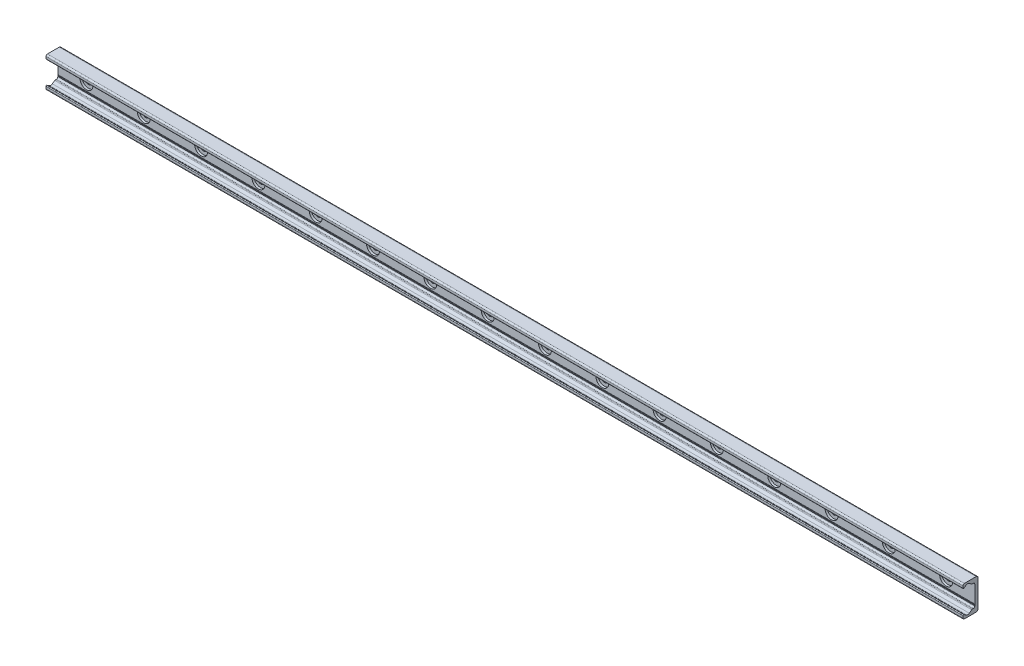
ISO-10303-21;
HEADER;
FILE_DESCRIPTION(('STEP AP214'),'2;1');
FILE_NAME('part.step','',(''),(''),'','','');
FILE_SCHEMA(('AUTOMOTIVE_DESIGN { 1 0 10303 214 1 1 1 1 }'));
ENDSEC;
DATA;
#1=APPLICATION_CONTEXT('core data for automotive mechanical design processes');
#2=APPLICATION_PROTOCOL_DEFINITION('international standard','automotive_design',2000,#1);
#3=PRODUCT_CONTEXT('',#1,'mechanical');
#4=PRODUCT('Part','Part','',(#3));
#5=PRODUCT_RELATED_PRODUCT_CATEGORY('part','',(#4));
#6=PRODUCT_DEFINITION_FORMATION('','',#4);
#7=PRODUCT_DEFINITION_CONTEXT('part definition',#1,'design');
#8=PRODUCT_DEFINITION('design','',#6,#7);
#9=PRODUCT_DEFINITION_SHAPE('','',#8);
#10=(LENGTH_UNIT() NAMED_UNIT(*) SI_UNIT(.MILLI.,.METRE.));
#11=(NAMED_UNIT(*) PLANE_ANGLE_UNIT() SI_UNIT($,.RADIAN.));
#12=(NAMED_UNIT(*) SI_UNIT($,.STERADIAN.) SOLID_ANGLE_UNIT());
#13=UNCERTAINTY_MEASURE_WITH_UNIT(LENGTH_MEASURE(1.E-05),#10,'distance_accuracy_value','');
#14=(GEOMETRIC_REPRESENTATION_CONTEXT(3) GLOBAL_UNCERTAINTY_ASSIGNED_CONTEXT((#13)) GLOBAL_UNIT_ASSIGNED_CONTEXT((#10,
#11,#12)) REPRESENTATION_CONTEXT('',''));
#15=CARTESIAN_POINT('',(0.,0.,0.));
#16=DIRECTION('',(0.,0.,1.));
#17=DIRECTION('',(1.,0.,0.));
#18=AXIS2_PLACEMENT_3D('',#15,#16,#17);
#19=CARTESIAN_POINT('',(-600.,0.,1.39999999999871));
#20=DIRECTION('',(0.,0.,1.));
#21=DIRECTION('',(1.,0.,0.));
#22=AXIS2_PLACEMENT_3D('',#19,#20,#21);
#23=PLANE('',#22);
#24=CARTESIAN_POINT('',(-600.,0.,1.39999999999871));
#25=DIRECTION('',(0.,0.,1.));
#26=DIRECTION('',(1.,0.,0.));
#27=AXIS2_PLACEMENT_3D('',#24,#25,#26);
#28=CIRCLE('',#27,4.49999999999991);
#29=CARTESIAN_POINT('',(-595.5,0.,1.39999999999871));
#30=VERTEX_POINT('',#29);
#31=EDGE_CURVE('E585',#30,#30,#28,.T.);
#32=ORIENTED_EDGE('',*,*,#31,.F.);
#33=EDGE_LOOP('',(#32));
#34=FACE_BOUND('',#33,.T.);
#35=CARTESIAN_POINT('',(-600.,0.,1.39999999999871));
#36=DIRECTION('',(0.,0.,1.));
#37=DIRECTION('',(1.,0.,0.));
#38=AXIS2_PLACEMENT_3D('',#35,#36,#37);
#39=CIRCLE('',#38,9.00000000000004);
#40=CARTESIAN_POINT('',(-591.,0.,1.39999999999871));
#41=VERTEX_POINT('',#40);
#42=EDGE_CURVE('E11',#41,#41,#39,.T.);
#43=ORIENTED_EDGE('',*,*,#42,.T.);
#44=EDGE_LOOP('',(#43));
#45=FACE_BOUND('',#44,.T.);
#46=ADVANCED_FACE('F39',(#34,#45),#23,.T.);
#47=CARTESIAN_POINT('',(-600.,0.,1.39999999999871));
#48=DIRECTION('',(0.,0.,1.));
#49=DIRECTION('',(1.,0.,0.));
#50=AXIS2_PLACEMENT_3D('',#47,#48,#49);
#51=CYLINDRICAL_SURFACE('',#50,9.00000000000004);
#52=CARTESIAN_POINT('',(-600.,0.,4.49999999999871));
#53=DIRECTION('',(0.,0.,1.));
#54=DIRECTION('',(1.,0.,0.));
#55=AXIS2_PLACEMENT_3D('',#52,#53,#54);
#56=CIRCLE('',#55,9.00000000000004);
#57=CARTESIAN_POINT('',(-591.,0.,4.49999999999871));
#58=VERTEX_POINT('',#57);
#59=EDGE_CURVE('E49',#58,#58,#56,.T.);
#60=CARTESIAN_POINT('',(-591.,0.,1.39999999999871));
#61=CARTESIAN_POINT('',(-591.,0.,1.43229166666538));
#62=CARTESIAN_POINT('',(-591.,0.,1.46458333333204));
#63=CARTESIAN_POINT('',(-591.,0.,1.52916666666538));
#64=CARTESIAN_POINT('',(-591.,0.,1.56145833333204));
#65=CARTESIAN_POINT('',(-591.,0.,1.62604166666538));
#66=CARTESIAN_POINT('',(-591.,0.,1.65833333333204));
#67=CARTESIAN_POINT('',(-591.,0.,1.72291666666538));
#68=CARTESIAN_POINT('',(-591.,0.,1.75520833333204));
#69=CARTESIAN_POINT('',(-591.,0.,1.81979166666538));
#70=CARTESIAN_POINT('',(-591.,0.,1.85208333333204));
#71=CARTESIAN_POINT('',(-591.,0.,1.91666666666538));
#72=CARTESIAN_POINT('',(-591.,0.,1.94895833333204));
#73=CARTESIAN_POINT('',(-591.,0.,2.01354166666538));
#74=CARTESIAN_POINT('',(-591.,0.,2.04583333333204));
#75=CARTESIAN_POINT('',(-591.,0.,2.11041666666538));
#76=CARTESIAN_POINT('',(-591.,0.,2.14270833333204));
#77=CARTESIAN_POINT('',(-591.,0.,2.20729166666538));
#78=CARTESIAN_POINT('',(-591.,0.,2.23958333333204));
#79=CARTESIAN_POINT('',(-591.,0.,2.30416666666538));
#80=CARTESIAN_POINT('',(-591.,0.,2.33645833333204));
#81=CARTESIAN_POINT('',(-591.,0.,2.40104166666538));
#82=CARTESIAN_POINT('',(-591.,0.,2.43333333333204));
#83=CARTESIAN_POINT('',(-591.,0.,2.49791666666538));
#84=CARTESIAN_POINT('',(-591.,0.,2.53020833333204));
#85=CARTESIAN_POINT('',(-591.,0.,2.59479166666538));
#86=CARTESIAN_POINT('',(-591.,0.,2.62708333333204));
#87=CARTESIAN_POINT('',(-591.,0.,2.69166666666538));
#88=CARTESIAN_POINT('',(-591.,0.,2.72395833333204));
#89=CARTESIAN_POINT('',(-591.,0.,2.78854166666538));
#90=CARTESIAN_POINT('',(-591.,0.,2.82083333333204));
#91=CARTESIAN_POINT('',(-591.,0.,2.88541666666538));
#92=CARTESIAN_POINT('',(-591.,0.,2.91770833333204));
#93=CARTESIAN_POINT('',(-591.,0.,2.98229166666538));
#94=CARTESIAN_POINT('',(-591.,0.,3.01458333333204));
#95=CARTESIAN_POINT('',(-591.,0.,3.07916666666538));
#96=CARTESIAN_POINT('',(-591.,0.,3.11145833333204));
#97=CARTESIAN_POINT('',(-591.,0.,3.17604166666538));
#98=CARTESIAN_POINT('',(-591.,0.,3.20833333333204));
#99=CARTESIAN_POINT('',(-591.,0.,3.27291666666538));
#100=CARTESIAN_POINT('',(-591.,0.,3.30520833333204));
#101=CARTESIAN_POINT('',(-591.,0.,3.36979166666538));
#102=CARTESIAN_POINT('',(-591.,0.,3.40208333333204));
#103=CARTESIAN_POINT('',(-591.,0.,3.46666666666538));
#104=CARTESIAN_POINT('',(-591.,0.,3.49895833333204));
#105=CARTESIAN_POINT('',(-591.,0.,3.56354166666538));
#106=CARTESIAN_POINT('',(-591.,0.,3.59583333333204));
#107=CARTESIAN_POINT('',(-591.,0.,3.66041666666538));
#108=CARTESIAN_POINT('',(-591.,0.,3.69270833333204));
#109=CARTESIAN_POINT('',(-591.,0.,3.75729166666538));
#110=CARTESIAN_POINT('',(-591.,0.,3.78958333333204));
#111=CARTESIAN_POINT('',(-591.,0.,3.85416666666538));
#112=CARTESIAN_POINT('',(-591.,0.,3.88645833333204));
#113=CARTESIAN_POINT('',(-591.,0.,3.95104166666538));
#114=CARTESIAN_POINT('',(-591.,0.,3.98333333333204));
#115=CARTESIAN_POINT('',(-591.,0.,4.04791666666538));
#116=CARTESIAN_POINT('',(-591.,0.,4.08020833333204));
#117=CARTESIAN_POINT('',(-591.,0.,4.14479166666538));
#118=CARTESIAN_POINT('',(-591.,0.,4.17708333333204));
#119=CARTESIAN_POINT('',(-591.,0.,4.24166666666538));
#120=CARTESIAN_POINT('',(-591.,0.,4.27395833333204));
#121=CARTESIAN_POINT('',(-591.,0.,4.33854166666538));
#122=CARTESIAN_POINT('',(-591.,0.,4.37083333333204));
#123=CARTESIAN_POINT('',(-591.,0.,4.43541666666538));
#124=CARTESIAN_POINT('',(-591.,0.,4.46770833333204));
#125=CARTESIAN_POINT('',(-591.,0.,4.49999999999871));
#126=B_SPLINE_CURVE_WITH_KNOTS('',3,(#60,#61,#62,#63,#64,#65,#66,#67,#68,#69,#70,#71,#72,#73,
#74,#75,#76,#77,#78,#79,#80,#81,#82,#83,#84,#85,#86,#87,#88,#89,#90,#91,#92,#93,#94,#95,#96,#97,
#98,#99,#100,#101,#102,#103,#104,#105,#106,#107,#108,#109,#110,#111,#112,#113,#114,#115,#116,
#117,#118,#119,#120,#121,#122,#123,#124,#125),.UNSPECIFIED.,.F.,.F.,(4,2,2,2,2,2,2,2,2,2,2,2,2,
2,2,2,2,2,2,2,2,2,2,2,2,2,2,2,2,2,2,2,4),(0.,0.0968750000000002,0.19375,0.290625,0.3875,
0.484375,0.58125,0.678125,0.775,0.871875,0.96875,1.065625,1.1625,1.259375,1.35625,1.453125,1.55,
1.646875,1.74375,1.840625,1.9375,2.034375,2.13125,2.228125,2.325,2.421875,2.51875,2.615625,
2.7125,2.809375,2.90625,3.003125,3.1),.UNSPECIFIED.);
#127=EDGE_CURVE('BSEAM555',#41,#58,#126,.T.);
#128=ORIENTED_EDGE('',*,*,#42,.F.);
#129=ORIENTED_EDGE('',*,*,#59,.T.);
#130=ORIENTED_EDGE('',*,*,#127,.T.);
#131=ORIENTED_EDGE('',*,*,#127,.F.);
#132=EDGE_LOOP('',(#128,#130,#129,#131));
#133=FACE_BOUND('',#132,.T.);
#134=ADVANCED_FACE('F555',(#133),#51,.F.);
#135=CARTESIAN_POINT('',(-520.,0.,1.39999999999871));
#136=DIRECTION('',(0.,0.,1.));
#137=DIRECTION('',(1.,0.,0.));
#138=AXIS2_PLACEMENT_3D('',#135,#136,#137);
#139=PLANE('',#138);
#140=CARTESIAN_POINT('',(-520.,0.,1.39999999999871));
#141=DIRECTION('',(0.,0.,1.));
#142=DIRECTION('',(1.,0.,0.));
#143=AXIS2_PLACEMENT_3D('',#140,#141,#142);
#144=CIRCLE('',#143,4.49999999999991);
#145=CARTESIAN_POINT('',(-515.5,0.,1.39999999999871));
#146=VERTEX_POINT('',#145);
#147=EDGE_CURVE('E589',#146,#146,#144,.T.);
#148=ORIENTED_EDGE('',*,*,#147,.F.);
#149=EDGE_LOOP('',(#148));
#150=FACE_BOUND('',#149,.T.);
#151=CARTESIAN_POINT('',(-520.,0.,1.39999999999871));
#152=DIRECTION('',(0.,0.,1.));
#153=DIRECTION('',(1.,0.,0.));
#154=AXIS2_PLACEMENT_3D('',#151,#152,#153);
#155=CIRCLE('',#154,9.00000000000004);
#156=CARTESIAN_POINT('',(-511.,0.,1.39999999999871));
#157=VERTEX_POINT('',#156);
#158=EDGE_CURVE('E546',#157,#157,#155,.T.);
#159=ORIENTED_EDGE('',*,*,#158,.T.);
#160=EDGE_LOOP('',(#159));
#161=FACE_BOUND('',#160,.T.);
#162=ADVANCED_FACE('F580',(#150,#161),#139,.T.);
#163=CARTESIAN_POINT('',(-520.,0.,1.39999999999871));
#164=DIRECTION('',(0.,0.,1.));
#165=DIRECTION('',(1.,0.,0.));
#166=AXIS2_PLACEMENT_3D('',#163,#164,#165);
#167=CYLINDRICAL_SURFACE('',#166,9.00000000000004);
#168=CARTESIAN_POINT('',(-520.,0.,4.49999999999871));
#169=DIRECTION('',(0.,0.,1.));
#170=DIRECTION('',(1.,0.,0.));
#171=AXIS2_PLACEMENT_3D('',#168,#169,#170);
#172=CIRCLE('',#171,9.00000000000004);
#173=CARTESIAN_POINT('',(-511.,0.,4.49999999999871));
#174=VERTEX_POINT('',#173);
#175=EDGE_CURVE('E542',#174,#174,#172,.T.);
#176=CARTESIAN_POINT('',(-511.,0.,1.39999999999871));
#177=CARTESIAN_POINT('',(-511.,0.,1.43229166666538));
#178=CARTESIAN_POINT('',(-511.,0.,1.46458333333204));
#179=CARTESIAN_POINT('',(-511.,0.,1.52916666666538));
#180=CARTESIAN_POINT('',(-511.,0.,1.56145833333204));
#181=CARTESIAN_POINT('',(-511.,0.,1.62604166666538));
#182=CARTESIAN_POINT('',(-511.,0.,1.65833333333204));
#183=CARTESIAN_POINT('',(-511.,0.,1.72291666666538));
#184=CARTESIAN_POINT('',(-511.,0.,1.75520833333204));
#185=CARTESIAN_POINT('',(-511.,0.,1.81979166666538));
#186=CARTESIAN_POINT('',(-511.,0.,1.85208333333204));
#187=CARTESIAN_POINT('',(-511.,0.,1.91666666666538));
#188=CARTESIAN_POINT('',(-511.,0.,1.94895833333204));
#189=CARTESIAN_POINT('',(-511.,0.,2.01354166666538));
#190=CARTESIAN_POINT('',(-511.,0.,2.04583333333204));
#191=CARTESIAN_POINT('',(-511.,0.,2.11041666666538));
#192=CARTESIAN_POINT('',(-511.,0.,2.14270833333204));
#193=CARTESIAN_POINT('',(-511.,0.,2.20729166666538));
#194=CARTESIAN_POINT('',(-511.,0.,2.23958333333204));
#195=CARTESIAN_POINT('',(-511.,0.,2.30416666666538));
#196=CARTESIAN_POINT('',(-511.,0.,2.33645833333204));
#197=CARTESIAN_POINT('',(-511.,0.,2.40104166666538));
#198=CARTESIAN_POINT('',(-511.,0.,2.43333333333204));
#199=CARTESIAN_POINT('',(-511.,0.,2.49791666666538));
#200=CARTESIAN_POINT('',(-511.,0.,2.53020833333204));
#201=CARTESIAN_POINT('',(-511.,0.,2.59479166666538));
#202=CARTESIAN_POINT('',(-511.,0.,2.62708333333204));
#203=CARTESIAN_POINT('',(-511.,0.,2.69166666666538));
#204=CARTESIAN_POINT('',(-511.,0.,2.72395833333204));
#205=CARTESIAN_POINT('',(-511.,0.,2.78854166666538));
#206=CARTESIAN_POINT('',(-511.,0.,2.82083333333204));
#207=CARTESIAN_POINT('',(-511.,0.,2.88541666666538));
#208=CARTESIAN_POINT('',(-511.,0.,2.91770833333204));
#209=CARTESIAN_POINT('',(-511.,0.,2.98229166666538));
#210=CARTESIAN_POINT('',(-511.,0.,3.01458333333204));
#211=CARTESIAN_POINT('',(-511.,0.,3.07916666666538));
#212=CARTESIAN_POINT('',(-511.,0.,3.11145833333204));
#213=CARTESIAN_POINT('',(-511.,0.,3.17604166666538));
#214=CARTESIAN_POINT('',(-511.,0.,3.20833333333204));
#215=CARTESIAN_POINT('',(-511.,0.,3.27291666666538));
#216=CARTESIAN_POINT('',(-511.,0.,3.30520833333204));
#217=CARTESIAN_POINT('',(-511.,0.,3.36979166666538));
#218=CARTESIAN_POINT('',(-511.,0.,3.40208333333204));
#219=CARTESIAN_POINT('',(-511.,0.,3.46666666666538));
#220=CARTESIAN_POINT('',(-511.,0.,3.49895833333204));
#221=CARTESIAN_POINT('',(-511.,0.,3.56354166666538));
#222=CARTESIAN_POINT('',(-511.,0.,3.59583333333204));
#223=CARTESIAN_POINT('',(-511.,0.,3.66041666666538));
#224=CARTESIAN_POINT('',(-511.,0.,3.69270833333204));
#225=CARTESIAN_POINT('',(-511.,0.,3.75729166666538));
#226=CARTESIAN_POINT('',(-511.,0.,3.78958333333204));
#227=CARTESIAN_POINT('',(-511.,0.,3.85416666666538));
#228=CARTESIAN_POINT('',(-511.,0.,3.88645833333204));
#229=CARTESIAN_POINT('',(-511.,0.,3.95104166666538));
#230=CARTESIAN_POINT('',(-511.,0.,3.98333333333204));
#231=CARTESIAN_POINT('',(-511.,0.,4.04791666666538));
#232=CARTESIAN_POINT('',(-511.,0.,4.08020833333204));
#233=CARTESIAN_POINT('',(-511.,0.,4.14479166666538));
#234=CARTESIAN_POINT('',(-511.,0.,4.17708333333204));
#235=CARTESIAN_POINT('',(-511.,0.,4.24166666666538));
#236=CARTESIAN_POINT('',(-511.,0.,4.27395833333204));
#237=CARTESIAN_POINT('',(-511.,0.,4.33854166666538));
#238=CARTESIAN_POINT('',(-511.,0.,4.37083333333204));
#239=CARTESIAN_POINT('',(-511.,0.,4.43541666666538));
#240=CARTESIAN_POINT('',(-511.,0.,4.46770833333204));
#241=CARTESIAN_POINT('',(-511.,0.,4.49999999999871));
#242=B_SPLINE_CURVE_WITH_KNOTS('',3,(#176,#177,#178,#179,#180,#181,#182,#183,#184,#185,#186,
#187,#188,#189,#190,#191,#192,#193,#194,#195,#196,#197,#198,#199,#200,#201,#202,#203,#204,#205,
#206,#207,#208,#209,#210,#211,#212,#213,#214,#215,#216,#217,#218,#219,#220,#221,#222,#223,#224,
#225,#226,#227,#228,#229,#230,#231,#232,#233,#234,#235,#236,#237,#238,#239,#240,#241),
.UNSPECIFIED.,.F.,.F.,(4,2,2,2,2,2,2,2,2,2,2,2,2,2,2,2,2,2,2,2,2,2,2,2,2,2,2,2,2,2,2,2,4),(0.,
0.0968750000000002,0.19375,0.290625,0.3875,0.484375,0.58125,0.678125,0.775,0.871875,0.96875,
1.065625,1.1625,1.259375,1.35625,1.453125,1.55,1.646875,1.74375,1.840625,1.9375,2.034375,
2.13125,2.228125,2.325,2.421875,2.51875,2.615625,2.7125,2.809375,2.90625,3.003125,3.1),.UNSPECIFIED.);
#243=EDGE_CURVE('BSEAM1080',#157,#174,#242,.T.);
#244=ORIENTED_EDGE('',*,*,#158,.F.);
#245=ORIENTED_EDGE('',*,*,#175,.T.);
#246=ORIENTED_EDGE('',*,*,#243,.T.);
#247=ORIENTED_EDGE('',*,*,#243,.F.);
#248=EDGE_LOOP('',(#244,#246,#245,#247));
#249=FACE_BOUND('',#248,.T.);
#250=ADVANCED_FACE('F1080',(#249),#167,.F.);
#251=CARTESIAN_POINT('',(-440.,0.,1.39999999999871));
#252=DIRECTION('',(0.,0.,1.));
#253=DIRECTION('',(1.,0.,0.));
#254=AXIS2_PLACEMENT_3D('',#251,#252,#253);
#255=PLANE('',#254);
#256=CARTESIAN_POINT('',(-440.,0.,1.39999999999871));
#257=DIRECTION('',(0.,0.,1.));
#258=DIRECTION('',(1.,0.,0.));
#259=AXIS2_PLACEMENT_3D('',#256,#257,#258);
#260=CIRCLE('',#259,4.49999999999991);
#261=CARTESIAN_POINT('',(-435.5,0.,1.39999999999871));
#262=VERTEX_POINT('',#261);
#263=EDGE_CURVE('E592',#262,#262,#260,.T.);
#264=ORIENTED_EDGE('',*,*,#263,.F.);
#265=EDGE_LOOP('',(#264));
#266=FACE_BOUND('',#265,.T.);
#267=CARTESIAN_POINT('',(-440.,0.,1.39999999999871));
#268=DIRECTION('',(0.,0.,1.));
#269=DIRECTION('',(1.,0.,0.));
#270=AXIS2_PLACEMENT_3D('',#267,#268,#269);
#271=CIRCLE('',#270,9.00000000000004);
#272=CARTESIAN_POINT('',(-431.,0.,1.39999999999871));
#273=VERTEX_POINT('',#272);
#274=EDGE_CURVE('E538',#273,#273,#271,.T.);
#275=ORIENTED_EDGE('',*,*,#274,.T.);
#276=EDGE_LOOP('',(#275));
#277=FACE_BOUND('',#276,.T.);
#278=ADVANCED_FACE('F1076',(#266,#277),#255,.T.);
#279=CARTESIAN_POINT('',(-440.,0.,1.39999999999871));
#280=DIRECTION('',(0.,0.,1.));
#281=DIRECTION('',(1.,0.,0.));
#282=AXIS2_PLACEMENT_3D('',#279,#280,#281);
#283=CYLINDRICAL_SURFACE('',#282,9.00000000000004);
#284=CARTESIAN_POINT('',(-440.,0.,4.49999999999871));
#285=DIRECTION('',(0.,0.,1.));
#286=DIRECTION('',(1.,0.,0.));
#287=AXIS2_PLACEMENT_3D('',#284,#285,#286);
#288=CIRCLE('',#287,9.00000000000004);
#289=CARTESIAN_POINT('',(-431.,0.,4.49999999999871));
#290=VERTEX_POINT('',#289);
#291=EDGE_CURVE('E534',#290,#290,#288,.T.);
#292=CARTESIAN_POINT('',(-431.,0.,1.39999999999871));
#293=CARTESIAN_POINT('',(-431.,0.,1.43229166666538));
#294=CARTESIAN_POINT('',(-431.,0.,1.46458333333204));
#295=CARTESIAN_POINT('',(-431.,0.,1.52916666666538));
#296=CARTESIAN_POINT('',(-431.,0.,1.56145833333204));
#297=CARTESIAN_POINT('',(-431.,0.,1.62604166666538));
#298=CARTESIAN_POINT('',(-431.,0.,1.65833333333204));
#299=CARTESIAN_POINT('',(-431.,0.,1.72291666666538));
#300=CARTESIAN_POINT('',(-431.,0.,1.75520833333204));
#301=CARTESIAN_POINT('',(-431.,0.,1.81979166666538));
#302=CARTESIAN_POINT('',(-431.,0.,1.85208333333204));
#303=CARTESIAN_POINT('',(-431.,0.,1.91666666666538));
#304=CARTESIAN_POINT('',(-431.,0.,1.94895833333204));
#305=CARTESIAN_POINT('',(-431.,0.,2.01354166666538));
#306=CARTESIAN_POINT('',(-431.,0.,2.04583333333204));
#307=CARTESIAN_POINT('',(-431.,0.,2.11041666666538));
#308=CARTESIAN_POINT('',(-431.,0.,2.14270833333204));
#309=CARTESIAN_POINT('',(-431.,0.,2.20729166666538));
#310=CARTESIAN_POINT('',(-431.,0.,2.23958333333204));
#311=CARTESIAN_POINT('',(-431.,0.,2.30416666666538));
#312=CARTESIAN_POINT('',(-431.,0.,2.33645833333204));
#313=CARTESIAN_POINT('',(-431.,0.,2.40104166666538));
#314=CARTESIAN_POINT('',(-431.,0.,2.43333333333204));
#315=CARTESIAN_POINT('',(-431.,0.,2.49791666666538));
#316=CARTESIAN_POINT('',(-431.,0.,2.53020833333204));
#317=CARTESIAN_POINT('',(-431.,0.,2.59479166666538));
#318=CARTESIAN_POINT('',(-431.,0.,2.62708333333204));
#319=CARTESIAN_POINT('',(-431.,0.,2.69166666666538));
#320=CARTESIAN_POINT('',(-431.,0.,2.72395833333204));
#321=CARTESIAN_POINT('',(-431.,0.,2.78854166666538));
#322=CARTESIAN_POINT('',(-431.,0.,2.82083333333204));
#323=CARTESIAN_POINT('',(-431.,0.,2.88541666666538));
#324=CARTESIAN_POINT('',(-431.,0.,2.91770833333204));
#325=CARTESIAN_POINT('',(-431.,0.,2.98229166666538));
#326=CARTESIAN_POINT('',(-431.,0.,3.01458333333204));
#327=CARTESIAN_POINT('',(-431.,0.,3.07916666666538));
#328=CARTESIAN_POINT('',(-431.,0.,3.11145833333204));
#329=CARTESIAN_POINT('',(-431.,0.,3.17604166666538));
#330=CARTESIAN_POINT('',(-431.,0.,3.20833333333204));
#331=CARTESIAN_POINT('',(-431.,0.,3.27291666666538));
#332=CARTESIAN_POINT('',(-431.,0.,3.30520833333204));
#333=CARTESIAN_POINT('',(-431.,0.,3.36979166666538));
#334=CARTESIAN_POINT('',(-431.,0.,3.40208333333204));
#335=CARTESIAN_POINT('',(-431.,0.,3.46666666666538));
#336=CARTESIAN_POINT('',(-431.,0.,3.49895833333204));
#337=CARTESIAN_POINT('',(-431.,0.,3.56354166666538));
#338=CARTESIAN_POINT('',(-431.,0.,3.59583333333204));
#339=CARTESIAN_POINT('',(-431.,0.,3.66041666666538));
#340=CARTESIAN_POINT('',(-431.,0.,3.69270833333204));
#341=CARTESIAN_POINT('',(-431.,0.,3.75729166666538));
#342=CARTESIAN_POINT('',(-431.,0.,3.78958333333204));
#343=CARTESIAN_POINT('',(-431.,0.,3.85416666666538));
#344=CARTESIAN_POINT('',(-431.,0.,3.88645833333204));
#345=CARTESIAN_POINT('',(-431.,0.,3.95104166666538));
#346=CARTESIAN_POINT('',(-431.,0.,3.98333333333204));
#347=CARTESIAN_POINT('',(-431.,0.,4.04791666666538));
#348=CARTESIAN_POINT('',(-431.,0.,4.08020833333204));
#349=CARTESIAN_POINT('',(-431.,0.,4.14479166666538));
#350=CARTESIAN_POINT('',(-431.,0.,4.17708333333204));
#351=CARTESIAN_POINT('',(-431.,0.,4.24166666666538));
#352=CARTESIAN_POINT('',(-431.,0.,4.27395833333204));
#353=CARTESIAN_POINT('',(-431.,0.,4.33854166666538));
#354=CARTESIAN_POINT('',(-431.,0.,4.37083333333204));
#355=CARTESIAN_POINT('',(-431.,0.,4.43541666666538));
#356=CARTESIAN_POINT('',(-431.,0.,4.46770833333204));
#357=CARTESIAN_POINT('',(-431.,0.,4.49999999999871));
#358=B_SPLINE_CURVE_WITH_KNOTS('',3,(#292,#293,#294,#295,#296,#297,#298,#299,#300,#301,#302,
#303,#304,#305,#306,#307,#308,#309,#310,#311,#312,#313,#314,#315,#316,#317,#318,#319,#320,#321,
#322,#323,#324,#325,#326,#327,#328,#329,#330,#331,#332,#333,#334,#335,#336,#337,#338,#339,#340,
#341,#342,#343,#344,#345,#346,#347,#348,#349,#350,#351,#352,#353,#354,#355,#356,#357),
.UNSPECIFIED.,.F.,.F.,(4,2,2,2,2,2,2,2,2,2,2,2,2,2,2,2,2,2,2,2,2,2,2,2,2,2,2,2,2,2,2,2,4),(0.,
0.0968750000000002,0.19375,0.290625,0.3875,0.484375,0.58125,0.678125,0.775,0.871875,0.96875,
1.065625,1.1625,1.259375,1.35625,1.453125,1.55,1.646875,1.74375,1.840625,1.9375,2.034375,
2.13125,2.228125,2.325,2.421875,2.51875,2.615625,2.7125,2.809375,2.90625,3.003125,3.1),.UNSPECIFIED.);
#359=EDGE_CURVE('BSEAM1072',#273,#290,#358,.T.);
#360=ORIENTED_EDGE('',*,*,#274,.F.);
#361=ORIENTED_EDGE('',*,*,#291,.T.);
#362=ORIENTED_EDGE('',*,*,#359,.T.);
#363=ORIENTED_EDGE('',*,*,#359,.F.);
#364=EDGE_LOOP('',(#360,#362,#361,#363));
#365=FACE_BOUND('',#364,.T.);
#366=ADVANCED_FACE('F1072',(#365),#283,.F.);
#367=CARTESIAN_POINT('',(-360.,0.,1.39999999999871));
#368=DIRECTION('',(0.,0.,1.));
#369=DIRECTION('',(1.,0.,0.));
#370=AXIS2_PLACEMENT_3D('',#367,#368,#369);
#371=PLANE('',#370);
#372=CARTESIAN_POINT('',(-360.,0.,1.39999999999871));
#373=DIRECTION('',(0.,0.,1.));
#374=DIRECTION('',(1.,0.,0.));
#375=AXIS2_PLACEMENT_3D('',#372,#373,#374);
#376=CIRCLE('',#375,4.49999999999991);
#377=CARTESIAN_POINT('',(-355.5,0.,1.39999999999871));
#378=VERTEX_POINT('',#377);
#379=EDGE_CURVE('E604',#378,#378,#376,.T.);
#380=ORIENTED_EDGE('',*,*,#379,.F.);
#381=EDGE_LOOP('',(#380));
#382=FACE_BOUND('',#381,.T.);
#383=CARTESIAN_POINT('',(-360.,0.,1.39999999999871));
#384=DIRECTION('',(0.,0.,1.));
#385=DIRECTION('',(1.,0.,0.));
#386=AXIS2_PLACEMENT_3D('',#383,#384,#385);
#387=CIRCLE('',#386,9.00000000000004);
#388=CARTESIAN_POINT('',(-351.,0.,1.39999999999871));
#389=VERTEX_POINT('',#388);
#390=EDGE_CURVE('E530',#389,#389,#387,.T.);
#391=ORIENTED_EDGE('',*,*,#390,.T.);
#392=EDGE_LOOP('',(#391));
#393=FACE_BOUND('',#392,.T.);
#394=ADVANCED_FACE('F1068',(#382,#393),#371,.T.);
#395=CARTESIAN_POINT('',(-360.,0.,1.39999999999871));
#396=DIRECTION('',(0.,0.,1.));
#397=DIRECTION('',(1.,0.,0.));
#398=AXIS2_PLACEMENT_3D('',#395,#396,#397);
#399=CYLINDRICAL_SURFACE('',#398,9.00000000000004);
#400=CARTESIAN_POINT('',(-360.,0.,4.49999999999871));
#401=DIRECTION('',(0.,0.,1.));
#402=DIRECTION('',(1.,0.,0.));
#403=AXIS2_PLACEMENT_3D('',#400,#401,#402);
#404=CIRCLE('',#403,9.00000000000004);
#405=CARTESIAN_POINT('',(-351.,0.,4.49999999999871));
#406=VERTEX_POINT('',#405);
#407=EDGE_CURVE('E526',#406,#406,#404,.T.);
#408=CARTESIAN_POINT('',(-351.,0.,1.39999999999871));
#409=CARTESIAN_POINT('',(-351.,0.,1.43229166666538));
#410=CARTESIAN_POINT('',(-351.,0.,1.46458333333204));
#411=CARTESIAN_POINT('',(-351.,0.,1.52916666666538));
#412=CARTESIAN_POINT('',(-351.,0.,1.56145833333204));
#413=CARTESIAN_POINT('',(-351.,0.,1.62604166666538));
#414=CARTESIAN_POINT('',(-351.,0.,1.65833333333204));
#415=CARTESIAN_POINT('',(-351.,0.,1.72291666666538));
#416=CARTESIAN_POINT('',(-351.,0.,1.75520833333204));
#417=CARTESIAN_POINT('',(-351.,0.,1.81979166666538));
#418=CARTESIAN_POINT('',(-351.,0.,1.85208333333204));
#419=CARTESIAN_POINT('',(-351.,0.,1.91666666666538));
#420=CARTESIAN_POINT('',(-351.,0.,1.94895833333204));
#421=CARTESIAN_POINT('',(-351.,0.,2.01354166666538));
#422=CARTESIAN_POINT('',(-351.,0.,2.04583333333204));
#423=CARTESIAN_POINT('',(-351.,0.,2.11041666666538));
#424=CARTESIAN_POINT('',(-351.,0.,2.14270833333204));
#425=CARTESIAN_POINT('',(-351.,0.,2.20729166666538));
#426=CARTESIAN_POINT('',(-351.,0.,2.23958333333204));
#427=CARTESIAN_POINT('',(-351.,0.,2.30416666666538));
#428=CARTESIAN_POINT('',(-351.,0.,2.33645833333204));
#429=CARTESIAN_POINT('',(-351.,0.,2.40104166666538));
#430=CARTESIAN_POINT('',(-351.,0.,2.43333333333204));
#431=CARTESIAN_POINT('',(-351.,0.,2.49791666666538));
#432=CARTESIAN_POINT('',(-351.,0.,2.53020833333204));
#433=CARTESIAN_POINT('',(-351.,0.,2.59479166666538));
#434=CARTESIAN_POINT('',(-351.,0.,2.62708333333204));
#435=CARTESIAN_POINT('',(-351.,0.,2.69166666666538));
#436=CARTESIAN_POINT('',(-351.,0.,2.72395833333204));
#437=CARTESIAN_POINT('',(-351.,0.,2.78854166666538));
#438=CARTESIAN_POINT('',(-351.,0.,2.82083333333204));
#439=CARTESIAN_POINT('',(-351.,0.,2.88541666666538));
#440=CARTESIAN_POINT('',(-351.,0.,2.91770833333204));
#441=CARTESIAN_POINT('',(-351.,0.,2.98229166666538));
#442=CARTESIAN_POINT('',(-351.,0.,3.01458333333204));
#443=CARTESIAN_POINT('',(-351.,0.,3.07916666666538));
#444=CARTESIAN_POINT('',(-351.,0.,3.11145833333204));
#445=CARTESIAN_POINT('',(-351.,0.,3.17604166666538));
#446=CARTESIAN_POINT('',(-351.,0.,3.20833333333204));
#447=CARTESIAN_POINT('',(-351.,0.,3.27291666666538));
#448=CARTESIAN_POINT('',(-351.,0.,3.30520833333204));
#449=CARTESIAN_POINT('',(-351.,0.,3.36979166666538));
#450=CARTESIAN_POINT('',(-351.,0.,3.40208333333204));
#451=CARTESIAN_POINT('',(-351.,0.,3.46666666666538));
#452=CARTESIAN_POINT('',(-351.,0.,3.49895833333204));
#453=CARTESIAN_POINT('',(-351.,0.,3.56354166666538));
#454=CARTESIAN_POINT('',(-351.,0.,3.59583333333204));
#455=CARTESIAN_POINT('',(-351.,0.,3.66041666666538));
#456=CARTESIAN_POINT('',(-351.,0.,3.69270833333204));
#457=CARTESIAN_POINT('',(-351.,0.,3.75729166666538));
#458=CARTESIAN_POINT('',(-351.,0.,3.78958333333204));
#459=CARTESIAN_POINT('',(-351.,0.,3.85416666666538));
#460=CARTESIAN_POINT('',(-351.,0.,3.88645833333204));
#461=CARTESIAN_POINT('',(-351.,0.,3.95104166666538));
#462=CARTESIAN_POINT('',(-351.,0.,3.98333333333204));
#463=CARTESIAN_POINT('',(-351.,0.,4.04791666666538));
#464=CARTESIAN_POINT('',(-351.,0.,4.08020833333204));
#465=CARTESIAN_POINT('',(-351.,0.,4.14479166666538));
#466=CARTESIAN_POINT('',(-351.,0.,4.17708333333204));
#467=CARTESIAN_POINT('',(-351.,0.,4.24166666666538));
#468=CARTESIAN_POINT('',(-351.,0.,4.27395833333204));
#469=CARTESIAN_POINT('',(-351.,0.,4.33854166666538));
#470=CARTESIAN_POINT('',(-351.,0.,4.37083333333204));
#471=CARTESIAN_POINT('',(-351.,0.,4.43541666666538));
#472=CARTESIAN_POINT('',(-351.,0.,4.46770833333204));
#473=CARTESIAN_POINT('',(-351.,0.,4.49999999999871));
#474=B_SPLINE_CURVE_WITH_KNOTS('',3,(#408,#409,#410,#411,#412,#413,#414,#415,#416,#417,#418,
#419,#420,#421,#422,#423,#424,#425,#426,#427,#428,#429,#430,#431,#432,#433,#434,#435,#436,#437,
#438,#439,#440,#441,#442,#443,#444,#445,#446,#447,#448,#449,#450,#451,#452,#453,#454,#455,#456,
#457,#458,#459,#460,#461,#462,#463,#464,#465,#466,#467,#468,#469,#470,#471,#472,#473),
.UNSPECIFIED.,.F.,.F.,(4,2,2,2,2,2,2,2,2,2,2,2,2,2,2,2,2,2,2,2,2,2,2,2,2,2,2,2,2,2,2,2,4),(0.,
0.0968750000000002,0.19375,0.290625,0.3875,0.484375,0.58125,0.678125,0.775,0.871875,0.96875,
1.065625,1.1625,1.259375,1.35625,1.453125,1.55,1.646875,1.74375,1.840625,1.9375,2.034375,
2.13125,2.228125,2.325,2.421875,2.51875,2.615625,2.7125,2.809375,2.90625,3.003125,3.1),.UNSPECIFIED.);
#475=EDGE_CURVE('BSEAM1064',#389,#406,#474,.T.);
#476=ORIENTED_EDGE('',*,*,#390,.F.);
#477=ORIENTED_EDGE('',*,*,#407,.T.);
#478=ORIENTED_EDGE('',*,*,#475,.T.);
#479=ORIENTED_EDGE('',*,*,#475,.F.);
#480=EDGE_LOOP('',(#476,#478,#477,#479));
#481=FACE_BOUND('',#480,.T.);
#482=ADVANCED_FACE('F1064',(#481),#399,.F.);
#483=CARTESIAN_POINT('',(-280.,0.,1.39999999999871));
#484=DIRECTION('',(0.,0.,1.));
#485=DIRECTION('',(1.,0.,0.));
#486=AXIS2_PLACEMENT_3D('',#483,#484,#485);
#487=PLANE('',#486);
#488=CARTESIAN_POINT('',(-280.,0.,1.39999999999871));
#489=DIRECTION('',(0.,0.,1.));
#490=DIRECTION('',(1.,0.,0.));
#491=AXIS2_PLACEMENT_3D('',#488,#489,#490);
#492=CIRCLE('',#491,4.49999999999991);
#493=CARTESIAN_POINT('',(-275.5,0.,1.39999999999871));
#494=VERTEX_POINT('',#493);
#495=EDGE_CURVE('E608',#494,#494,#492,.T.);
#496=ORIENTED_EDGE('',*,*,#495,.F.);
#497=EDGE_LOOP('',(#496));
#498=FACE_BOUND('',#497,.T.);
#499=CARTESIAN_POINT('',(-280.,0.,1.39999999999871));
#500=DIRECTION('',(0.,0.,1.));
#501=DIRECTION('',(1.,0.,0.));
#502=AXIS2_PLACEMENT_3D('',#499,#500,#501);
#503=CIRCLE('',#502,9.00000000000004);
#504=CARTESIAN_POINT('',(-271.,0.,1.39999999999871));
#505=VERTEX_POINT('',#504);
#506=EDGE_CURVE('E523',#505,#505,#503,.T.);
#507=ORIENTED_EDGE('',*,*,#506,.T.);
#508=EDGE_LOOP('',(#507));
#509=FACE_BOUND('',#508,.T.);
#510=ADVANCED_FACE('F1060',(#498,#509),#487,.T.);
#511=CARTESIAN_POINT('',(-280.,0.,1.39999999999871));
#512=DIRECTION('',(0.,0.,1.));
#513=DIRECTION('',(1.,0.,0.));
#514=AXIS2_PLACEMENT_3D('',#511,#512,#513);
#515=CYLINDRICAL_SURFACE('',#514,9.00000000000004);
#516=CARTESIAN_POINT('',(-280.,0.,4.49999999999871));
#517=DIRECTION('',(0.,0.,1.));
#518=DIRECTION('',(1.,0.,0.));
#519=AXIS2_PLACEMENT_3D('',#516,#517,#518);
#520=CIRCLE('',#519,9.00000000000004);
#521=CARTESIAN_POINT('',(-271.,0.,4.49999999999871));
#522=VERTEX_POINT('',#521);
#523=EDGE_CURVE('E519',#522,#522,#520,.T.);
#524=CARTESIAN_POINT('',(-271.,0.,1.39999999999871));
#525=CARTESIAN_POINT('',(-271.,0.,1.43229166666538));
#526=CARTESIAN_POINT('',(-271.,0.,1.46458333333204));
#527=CARTESIAN_POINT('',(-271.,0.,1.52916666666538));
#528=CARTESIAN_POINT('',(-271.,0.,1.56145833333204));
#529=CARTESIAN_POINT('',(-271.,0.,1.62604166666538));
#530=CARTESIAN_POINT('',(-271.,0.,1.65833333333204));
#531=CARTESIAN_POINT('',(-271.,0.,1.72291666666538));
#532=CARTESIAN_POINT('',(-271.,0.,1.75520833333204));
#533=CARTESIAN_POINT('',(-271.,0.,1.81979166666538));
#534=CARTESIAN_POINT('',(-271.,0.,1.85208333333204));
#535=CARTESIAN_POINT('',(-271.,0.,1.91666666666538));
#536=CARTESIAN_POINT('',(-271.,0.,1.94895833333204));
#537=CARTESIAN_POINT('',(-271.,0.,2.01354166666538));
#538=CARTESIAN_POINT('',(-271.,0.,2.04583333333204));
#539=CARTESIAN_POINT('',(-271.,0.,2.11041666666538));
#540=CARTESIAN_POINT('',(-271.,0.,2.14270833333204));
#541=CARTESIAN_POINT('',(-271.,0.,2.20729166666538));
#542=CARTESIAN_POINT('',(-271.,0.,2.23958333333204));
#543=CARTESIAN_POINT('',(-271.,0.,2.30416666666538));
#544=CARTESIAN_POINT('',(-271.,0.,2.33645833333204));
#545=CARTESIAN_POINT('',(-271.,0.,2.40104166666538));
#546=CARTESIAN_POINT('',(-271.,0.,2.43333333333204));
#547=CARTESIAN_POINT('',(-271.,0.,2.49791666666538));
#548=CARTESIAN_POINT('',(-271.,0.,2.53020833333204));
#549=CARTESIAN_POINT('',(-271.,0.,2.59479166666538));
#550=CARTESIAN_POINT('',(-271.,0.,2.62708333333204));
#551=CARTESIAN_POINT('',(-271.,0.,2.69166666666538));
#552=CARTESIAN_POINT('',(-271.,0.,2.72395833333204));
#553=CARTESIAN_POINT('',(-271.,0.,2.78854166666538));
#554=CARTESIAN_POINT('',(-271.,0.,2.82083333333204));
#555=CARTESIAN_POINT('',(-271.,0.,2.88541666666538));
#556=CARTESIAN_POINT('',(-271.,0.,2.91770833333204));
#557=CARTESIAN_POINT('',(-271.,0.,2.98229166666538));
#558=CARTESIAN_POINT('',(-271.,0.,3.01458333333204));
#559=CARTESIAN_POINT('',(-271.,0.,3.07916666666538));
#560=CARTESIAN_POINT('',(-271.,0.,3.11145833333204));
#561=CARTESIAN_POINT('',(-271.,0.,3.17604166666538));
#562=CARTESIAN_POINT('',(-271.,0.,3.20833333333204));
#563=CARTESIAN_POINT('',(-271.,0.,3.27291666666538));
#564=CARTESIAN_POINT('',(-271.,0.,3.30520833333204));
#565=CARTESIAN_POINT('',(-271.,0.,3.36979166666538));
#566=CARTESIAN_POINT('',(-271.,0.,3.40208333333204));
#567=CARTESIAN_POINT('',(-271.,0.,3.46666666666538));
#568=CARTESIAN_POINT('',(-271.,0.,3.49895833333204));
#569=CARTESIAN_POINT('',(-271.,0.,3.56354166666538));
#570=CARTESIAN_POINT('',(-271.,0.,3.59583333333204));
#571=CARTESIAN_POINT('',(-271.,0.,3.66041666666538));
#572=CARTESIAN_POINT('',(-271.,0.,3.69270833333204));
#573=CARTESIAN_POINT('',(-271.,0.,3.75729166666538));
#574=CARTESIAN_POINT('',(-271.,0.,3.78958333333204));
#575=CARTESIAN_POINT('',(-271.,0.,3.85416666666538));
#576=CARTESIAN_POINT('',(-271.,0.,3.88645833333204));
#577=CARTESIAN_POINT('',(-271.,0.,3.95104166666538));
#578=CARTESIAN_POINT('',(-271.,0.,3.98333333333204));
#579=CARTESIAN_POINT('',(-271.,0.,4.04791666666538));
#580=CARTESIAN_POINT('',(-271.,0.,4.08020833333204));
#581=CARTESIAN_POINT('',(-271.,0.,4.14479166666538));
#582=CARTESIAN_POINT('',(-271.,0.,4.17708333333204));
#583=CARTESIAN_POINT('',(-271.,0.,4.24166666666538));
#584=CARTESIAN_POINT('',(-271.,0.,4.27395833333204));
#585=CARTESIAN_POINT('',(-271.,0.,4.33854166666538));
#586=CARTESIAN_POINT('',(-271.,0.,4.37083333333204));
#587=CARTESIAN_POINT('',(-271.,0.,4.43541666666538));
#588=CARTESIAN_POINT('',(-271.,0.,4.46770833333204));
#589=CARTESIAN_POINT('',(-271.,0.,4.49999999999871));
#590=B_SPLINE_CURVE_WITH_KNOTS('',3,(#524,#525,#526,#527,#528,#529,#530,#531,#532,#533,#534,
#535,#536,#537,#538,#539,#540,#541,#542,#543,#544,#545,#546,#547,#548,#549,#550,#551,#552,#553,
#554,#555,#556,#557,#558,#559,#560,#561,#562,#563,#564,#565,#566,#567,#568,#569,#570,#571,#572,
#573,#574,#575,#576,#577,#578,#579,#580,#581,#582,#583,#584,#585,#586,#587,#588,#589),
.UNSPECIFIED.,.F.,.F.,(4,2,2,2,2,2,2,2,2,2,2,2,2,2,2,2,2,2,2,2,2,2,2,2,2,2,2,2,2,2,2,2,4),(0.,
0.0968750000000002,0.19375,0.290625,0.3875,0.484375,0.58125,0.678125,0.775,0.871875,0.96875,
1.065625,1.1625,1.259375,1.35625,1.453125,1.55,1.646875,1.74375,1.840625,1.9375,2.034375,
2.13125,2.228125,2.325,2.421875,2.51875,2.615625,2.7125,2.809375,2.90625,3.003125,3.1),.UNSPECIFIED.);
#591=EDGE_CURVE('BSEAM1056',#505,#522,#590,.T.);
#592=ORIENTED_EDGE('',*,*,#506,.F.);
#593=ORIENTED_EDGE('',*,*,#523,.T.);
#594=ORIENTED_EDGE('',*,*,#591,.T.);
#595=ORIENTED_EDGE('',*,*,#591,.F.);
#596=EDGE_LOOP('',(#592,#594,#593,#595));
#597=FACE_BOUND('',#596,.T.);
#598=ADVANCED_FACE('F1056',(#597),#515,.F.);
#599=CARTESIAN_POINT('',(-200.,0.,1.39999999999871));
#600=DIRECTION('',(0.,0.,1.));
#601=DIRECTION('',(1.,0.,0.));
#602=AXIS2_PLACEMENT_3D('',#599,#600,#601);
#603=PLANE('',#602);
#604=CARTESIAN_POINT('',(-200.,0.,1.39999999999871));
#605=DIRECTION('',(0.,0.,1.));
#606=DIRECTION('',(1.,0.,0.));
#607=AXIS2_PLACEMENT_3D('',#604,#605,#606);
#608=CIRCLE('',#607,4.49999999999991);
#609=CARTESIAN_POINT('',(-195.5,0.,1.39999999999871));
#610=VERTEX_POINT('',#609);
#611=EDGE_CURVE('E612',#610,#610,#608,.T.);
#612=ORIENTED_EDGE('',*,*,#611,.F.);
#613=EDGE_LOOP('',(#612));
#614=FACE_BOUND('',#613,.T.);
#615=CARTESIAN_POINT('',(-200.,0.,1.39999999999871));
#616=DIRECTION('',(0.,0.,1.));
#617=DIRECTION('',(1.,0.,0.));
#618=AXIS2_PLACEMENT_3D('',#615,#616,#617);
#619=CIRCLE('',#618,9.00000000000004);
#620=CARTESIAN_POINT('',(-191.,0.,1.39999999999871));
#621=VERTEX_POINT('',#620);
#622=EDGE_CURVE('E515',#621,#621,#619,.T.);
#623=ORIENTED_EDGE('',*,*,#622,.T.);
#624=EDGE_LOOP('',(#623));
#625=FACE_BOUND('',#624,.T.);
#626=ADVANCED_FACE('F1052',(#614,#625),#603,.T.);
#627=CARTESIAN_POINT('',(-200.,0.,1.39999999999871));
#628=DIRECTION('',(0.,0.,1.));
#629=DIRECTION('',(1.,0.,0.));
#630=AXIS2_PLACEMENT_3D('',#627,#628,#629);
#631=CYLINDRICAL_SURFACE('',#630,9.00000000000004);
#632=CARTESIAN_POINT('',(-200.,0.,4.49999999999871));
#633=DIRECTION('',(0.,0.,1.));
#634=DIRECTION('',(1.,0.,0.));
#635=AXIS2_PLACEMENT_3D('',#632,#633,#634);
#636=CIRCLE('',#635,9.00000000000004);
#637=CARTESIAN_POINT('',(-191.,0.,4.49999999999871));
#638=VERTEX_POINT('',#637);
#639=EDGE_CURVE('E511',#638,#638,#636,.T.);
#640=CARTESIAN_POINT('',(-191.,0.,1.39999999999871));
#641=CARTESIAN_POINT('',(-191.,0.,1.43229166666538));
#642=CARTESIAN_POINT('',(-191.,0.,1.46458333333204));
#643=CARTESIAN_POINT('',(-191.,0.,1.52916666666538));
#644=CARTESIAN_POINT('',(-191.,0.,1.56145833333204));
#645=CARTESIAN_POINT('',(-191.,0.,1.62604166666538));
#646=CARTESIAN_POINT('',(-191.,0.,1.65833333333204));
#647=CARTESIAN_POINT('',(-191.,0.,1.72291666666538));
#648=CARTESIAN_POINT('',(-191.,0.,1.75520833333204));
#649=CARTESIAN_POINT('',(-191.,0.,1.81979166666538));
#650=CARTESIAN_POINT('',(-191.,0.,1.85208333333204));
#651=CARTESIAN_POINT('',(-191.,0.,1.91666666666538));
#652=CARTESIAN_POINT('',(-191.,0.,1.94895833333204));
#653=CARTESIAN_POINT('',(-191.,0.,2.01354166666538));
#654=CARTESIAN_POINT('',(-191.,0.,2.04583333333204));
#655=CARTESIAN_POINT('',(-191.,0.,2.11041666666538));
#656=CARTESIAN_POINT('',(-191.,0.,2.14270833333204));
#657=CARTESIAN_POINT('',(-191.,0.,2.20729166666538));
#658=CARTESIAN_POINT('',(-191.,0.,2.23958333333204));
#659=CARTESIAN_POINT('',(-191.,0.,2.30416666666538));
#660=CARTESIAN_POINT('',(-191.,0.,2.33645833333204));
#661=CARTESIAN_POINT('',(-191.,0.,2.40104166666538));
#662=CARTESIAN_POINT('',(-191.,0.,2.43333333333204));
#663=CARTESIAN_POINT('',(-191.,0.,2.49791666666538));
#664=CARTESIAN_POINT('',(-191.,0.,2.53020833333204));
#665=CARTESIAN_POINT('',(-191.,0.,2.59479166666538));
#666=CARTESIAN_POINT('',(-191.,0.,2.62708333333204));
#667=CARTESIAN_POINT('',(-191.,0.,2.69166666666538));
#668=CARTESIAN_POINT('',(-191.,0.,2.72395833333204));
#669=CARTESIAN_POINT('',(-191.,0.,2.78854166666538));
#670=CARTESIAN_POINT('',(-191.,0.,2.82083333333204));
#671=CARTESIAN_POINT('',(-191.,0.,2.88541666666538));
#672=CARTESIAN_POINT('',(-191.,0.,2.91770833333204));
#673=CARTESIAN_POINT('',(-191.,0.,2.98229166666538));
#674=CARTESIAN_POINT('',(-191.,0.,3.01458333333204));
#675=CARTESIAN_POINT('',(-191.,0.,3.07916666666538));
#676=CARTESIAN_POINT('',(-191.,0.,3.11145833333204));
#677=CARTESIAN_POINT('',(-191.,0.,3.17604166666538));
#678=CARTESIAN_POINT('',(-191.,0.,3.20833333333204));
#679=CARTESIAN_POINT('',(-191.,0.,3.27291666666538));
#680=CARTESIAN_POINT('',(-191.,0.,3.30520833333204));
#681=CARTESIAN_POINT('',(-191.,0.,3.36979166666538));
#682=CARTESIAN_POINT('',(-191.,0.,3.40208333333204));
#683=CARTESIAN_POINT('',(-191.,0.,3.46666666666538));
#684=CARTESIAN_POINT('',(-191.,0.,3.49895833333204));
#685=CARTESIAN_POINT('',(-191.,0.,3.56354166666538));
#686=CARTESIAN_POINT('',(-191.,0.,3.59583333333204));
#687=CARTESIAN_POINT('',(-191.,0.,3.66041666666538));
#688=CARTESIAN_POINT('',(-191.,0.,3.69270833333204));
#689=CARTESIAN_POINT('',(-191.,0.,3.75729166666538));
#690=CARTESIAN_POINT('',(-191.,0.,3.78958333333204));
#691=CARTESIAN_POINT('',(-191.,0.,3.85416666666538));
#692=CARTESIAN_POINT('',(-191.,0.,3.88645833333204));
#693=CARTESIAN_POINT('',(-191.,0.,3.95104166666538));
#694=CARTESIAN_POINT('',(-191.,0.,3.98333333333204));
#695=CARTESIAN_POINT('',(-191.,0.,4.04791666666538));
#696=CARTESIAN_POINT('',(-191.,0.,4.08020833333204));
#697=CARTESIAN_POINT('',(-191.,0.,4.14479166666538));
#698=CARTESIAN_POINT('',(-191.,0.,4.17708333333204));
#699=CARTESIAN_POINT('',(-191.,0.,4.24166666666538));
#700=CARTESIAN_POINT('',(-191.,0.,4.27395833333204));
#701=CARTESIAN_POINT('',(-191.,0.,4.33854166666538));
#702=CARTESIAN_POINT('',(-191.,0.,4.37083333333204));
#703=CARTESIAN_POINT('',(-191.,0.,4.43541666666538));
#704=CARTESIAN_POINT('',(-191.,0.,4.46770833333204));
#705=CARTESIAN_POINT('',(-191.,0.,4.49999999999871));
#706=B_SPLINE_CURVE_WITH_KNOTS('',3,(#640,#641,#642,#643,#644,#645,#646,#647,#648,#649,#650,
#651,#652,#653,#654,#655,#656,#657,#658,#659,#660,#661,#662,#663,#664,#665,#666,#667,#668,#669,
#670,#671,#672,#673,#674,#675,#676,#677,#678,#679,#680,#681,#682,#683,#684,#685,#686,#687,#688,
#689,#690,#691,#692,#693,#694,#695,#696,#697,#698,#699,#700,#701,#702,#703,#704,#705),
.UNSPECIFIED.,.F.,.F.,(4,2,2,2,2,2,2,2,2,2,2,2,2,2,2,2,2,2,2,2,2,2,2,2,2,2,2,2,2,2,2,2,4),(0.,
0.0968750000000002,0.19375,0.290625,0.3875,0.484375,0.58125,0.678125,0.775,0.871875,0.96875,
1.065625,1.1625,1.259375,1.35625,1.453125,1.55,1.646875,1.74375,1.840625,1.9375,2.034375,
2.13125,2.228125,2.325,2.421875,2.51875,2.615625,2.7125,2.809375,2.90625,3.003125,3.1),.UNSPECIFIED.);
#707=EDGE_CURVE('BSEAM1048',#621,#638,#706,.T.);
#708=ORIENTED_EDGE('',*,*,#622,.F.);
#709=ORIENTED_EDGE('',*,*,#639,.T.);
#710=ORIENTED_EDGE('',*,*,#707,.T.);
#711=ORIENTED_EDGE('',*,*,#707,.F.);
#712=EDGE_LOOP('',(#708,#710,#709,#711));
#713=FACE_BOUND('',#712,.T.);
#714=ADVANCED_FACE('F1048',(#713),#631,.F.);
#715=CARTESIAN_POINT('',(-120.,0.,1.39999999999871));
#716=DIRECTION('',(0.,0.,1.));
#717=DIRECTION('',(1.,0.,0.));
#718=AXIS2_PLACEMENT_3D('',#715,#716,#717);
#719=PLANE('',#718);
#720=CARTESIAN_POINT('',(-120.,0.,1.39999999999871));
#721=DIRECTION('',(0.,0.,1.));
#722=DIRECTION('',(1.,0.,0.));
#723=AXIS2_PLACEMENT_3D('',#720,#721,#722);
#724=CIRCLE('',#723,4.49999999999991);
#725=CARTESIAN_POINT('',(-115.5,0.,1.39999999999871));
#726=VERTEX_POINT('',#725);
#727=EDGE_CURVE('E616',#726,#726,#724,.T.);
#728=ORIENTED_EDGE('',*,*,#727,.F.);
#729=EDGE_LOOP('',(#728));
#730=FACE_BOUND('',#729,.T.);
#731=CARTESIAN_POINT('',(-120.,0.,1.39999999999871));
#732=DIRECTION('',(0.,0.,1.));
#733=DIRECTION('',(1.,0.,0.));
#734=AXIS2_PLACEMENT_3D('',#731,#732,#733);
#735=CIRCLE('',#734,9.00000000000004);
#736=CARTESIAN_POINT('',(-111.,0.,1.39999999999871));
#737=VERTEX_POINT('',#736);
#738=EDGE_CURVE('E507',#737,#737,#735,.T.);
#739=ORIENTED_EDGE('',*,*,#738,.T.);
#740=EDGE_LOOP('',(#739));
#741=FACE_BOUND('',#740,.T.);
#742=ADVANCED_FACE('F1044',(#730,#741),#719,.T.);
#743=CARTESIAN_POINT('',(-120.,0.,1.39999999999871));
#744=DIRECTION('',(0.,0.,1.));
#745=DIRECTION('',(1.,0.,0.));
#746=AXIS2_PLACEMENT_3D('',#743,#744,#745);
#747=CYLINDRICAL_SURFACE('',#746,9.00000000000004);
#748=CARTESIAN_POINT('',(-120.,0.,4.49999999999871));
#749=DIRECTION('',(0.,0.,1.));
#750=DIRECTION('',(1.,0.,0.));
#751=AXIS2_PLACEMENT_3D('',#748,#749,#750);
#752=CIRCLE('',#751,9.00000000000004);
#753=CARTESIAN_POINT('',(-111.,0.,4.49999999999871));
#754=VERTEX_POINT('',#753);
#755=EDGE_CURVE('E503',#754,#754,#752,.T.);
#756=CARTESIAN_POINT('',(-111.,0.,1.39999999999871));
#757=CARTESIAN_POINT('',(-111.,0.,1.43229166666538));
#758=CARTESIAN_POINT('',(-111.,0.,1.46458333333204));
#759=CARTESIAN_POINT('',(-111.,0.,1.52916666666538));
#760=CARTESIAN_POINT('',(-111.,0.,1.56145833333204));
#761=CARTESIAN_POINT('',(-111.,0.,1.62604166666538));
#762=CARTESIAN_POINT('',(-111.,0.,1.65833333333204));
#763=CARTESIAN_POINT('',(-111.,0.,1.72291666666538));
#764=CARTESIAN_POINT('',(-111.,0.,1.75520833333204));
#765=CARTESIAN_POINT('',(-111.,0.,1.81979166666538));
#766=CARTESIAN_POINT('',(-111.,0.,1.85208333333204));
#767=CARTESIAN_POINT('',(-111.,0.,1.91666666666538));
#768=CARTESIAN_POINT('',(-111.,0.,1.94895833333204));
#769=CARTESIAN_POINT('',(-111.,0.,2.01354166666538));
#770=CARTESIAN_POINT('',(-111.,0.,2.04583333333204));
#771=CARTESIAN_POINT('',(-111.,0.,2.11041666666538));
#772=CARTESIAN_POINT('',(-111.,0.,2.14270833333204));
#773=CARTESIAN_POINT('',(-111.,0.,2.20729166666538));
#774=CARTESIAN_POINT('',(-111.,0.,2.23958333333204));
#775=CARTESIAN_POINT('',(-111.,0.,2.30416666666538));
#776=CARTESIAN_POINT('',(-111.,0.,2.33645833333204));
#777=CARTESIAN_POINT('',(-111.,0.,2.40104166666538));
#778=CARTESIAN_POINT('',(-111.,0.,2.43333333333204));
#779=CARTESIAN_POINT('',(-111.,0.,2.49791666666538));
#780=CARTESIAN_POINT('',(-111.,0.,2.53020833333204));
#781=CARTESIAN_POINT('',(-111.,0.,2.59479166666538));
#782=CARTESIAN_POINT('',(-111.,0.,2.62708333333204));
#783=CARTESIAN_POINT('',(-111.,0.,2.69166666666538));
#784=CARTESIAN_POINT('',(-111.,0.,2.72395833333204));
#785=CARTESIAN_POINT('',(-111.,0.,2.78854166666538));
#786=CARTESIAN_POINT('',(-111.,0.,2.82083333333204));
#787=CARTESIAN_POINT('',(-111.,0.,2.88541666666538));
#788=CARTESIAN_POINT('',(-111.,0.,2.91770833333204));
#789=CARTESIAN_POINT('',(-111.,0.,2.98229166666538));
#790=CARTESIAN_POINT('',(-111.,0.,3.01458333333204));
#791=CARTESIAN_POINT('',(-111.,0.,3.07916666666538));
#792=CARTESIAN_POINT('',(-111.,0.,3.11145833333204));
#793=CARTESIAN_POINT('',(-111.,0.,3.17604166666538));
#794=CARTESIAN_POINT('',(-111.,0.,3.20833333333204));
#795=CARTESIAN_POINT('',(-111.,0.,3.27291666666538));
#796=CARTESIAN_POINT('',(-111.,0.,3.30520833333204));
#797=CARTESIAN_POINT('',(-111.,0.,3.36979166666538));
#798=CARTESIAN_POINT('',(-111.,0.,3.40208333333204));
#799=CARTESIAN_POINT('',(-111.,0.,3.46666666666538));
#800=CARTESIAN_POINT('',(-111.,0.,3.49895833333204));
#801=CARTESIAN_POINT('',(-111.,0.,3.56354166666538));
#802=CARTESIAN_POINT('',(-111.,0.,3.59583333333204));
#803=CARTESIAN_POINT('',(-111.,0.,3.66041666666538));
#804=CARTESIAN_POINT('',(-111.,0.,3.69270833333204));
#805=CARTESIAN_POINT('',(-111.,0.,3.75729166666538));
#806=CARTESIAN_POINT('',(-111.,0.,3.78958333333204));
#807=CARTESIAN_POINT('',(-111.,0.,3.85416666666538));
#808=CARTESIAN_POINT('',(-111.,0.,3.88645833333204));
#809=CARTESIAN_POINT('',(-111.,0.,3.95104166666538));
#810=CARTESIAN_POINT('',(-111.,0.,3.98333333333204));
#811=CARTESIAN_POINT('',(-111.,0.,4.04791666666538));
#812=CARTESIAN_POINT('',(-111.,0.,4.08020833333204));
#813=CARTESIAN_POINT('',(-111.,0.,4.14479166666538));
#814=CARTESIAN_POINT('',(-111.,0.,4.17708333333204));
#815=CARTESIAN_POINT('',(-111.,0.,4.24166666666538));
#816=CARTESIAN_POINT('',(-111.,0.,4.27395833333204));
#817=CARTESIAN_POINT('',(-111.,0.,4.33854166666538));
#818=CARTESIAN_POINT('',(-111.,0.,4.37083333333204));
#819=CARTESIAN_POINT('',(-111.,0.,4.43541666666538));
#820=CARTESIAN_POINT('',(-111.,0.,4.46770833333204));
#821=CARTESIAN_POINT('',(-111.,0.,4.49999999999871));
#822=B_SPLINE_CURVE_WITH_KNOTS('',3,(#756,#757,#758,#759,#760,#761,#762,#763,#764,#765,#766,
#767,#768,#769,#770,#771,#772,#773,#774,#775,#776,#777,#778,#779,#780,#781,#782,#783,#784,#785,
#786,#787,#788,#789,#790,#791,#792,#793,#794,#795,#796,#797,#798,#799,#800,#801,#802,#803,#804,
#805,#806,#807,#808,#809,#810,#811,#812,#813,#814,#815,#816,#817,#818,#819,#820,#821),
.UNSPECIFIED.,.F.,.F.,(4,2,2,2,2,2,2,2,2,2,2,2,2,2,2,2,2,2,2,2,2,2,2,2,2,2,2,2,2,2,2,2,4),(0.,
0.0968750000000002,0.19375,0.290625,0.3875,0.484375,0.58125,0.678125,0.775,0.871875,0.96875,
1.065625,1.1625,1.259375,1.35625,1.453125,1.55,1.646875,1.74375,1.840625,1.9375,2.034375,
2.13125,2.228125,2.325,2.421875,2.51875,2.615625,2.7125,2.809375,2.90625,3.003125,3.1),.UNSPECIFIED.);
#823=EDGE_CURVE('BSEAM1040',#737,#754,#822,.T.);
#824=ORIENTED_EDGE('',*,*,#738,.F.);
#825=ORIENTED_EDGE('',*,*,#755,.T.);
#826=ORIENTED_EDGE('',*,*,#823,.T.);
#827=ORIENTED_EDGE('',*,*,#823,.F.);
#828=EDGE_LOOP('',(#824,#826,#825,#827));
#829=FACE_BOUND('',#828,.T.);
#830=ADVANCED_FACE('F1040',(#829),#747,.F.);
#831=CARTESIAN_POINT('',(-40.,0.,1.39999999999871));
#832=DIRECTION('',(0.,0.,1.));
#833=DIRECTION('',(1.,0.,0.));
#834=AXIS2_PLACEMENT_3D('',#831,#832,#833);
#835=PLANE('',#834);
#836=CARTESIAN_POINT('',(-40.,0.,1.39999999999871));
#837=DIRECTION('',(0.,0.,1.));
#838=DIRECTION('',(1.,0.,0.));
#839=AXIS2_PLACEMENT_3D('',#836,#837,#838);
#840=CIRCLE('',#839,4.49999999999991);
#841=CARTESIAN_POINT('',(-35.5000000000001,0.,1.39999999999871));
#842=VERTEX_POINT('',#841);
#843=EDGE_CURVE('E620',#842,#842,#840,.T.);
#844=ORIENTED_EDGE('',*,*,#843,.F.);
#845=EDGE_LOOP('',(#844));
#846=FACE_BOUND('',#845,.T.);
#847=CARTESIAN_POINT('',(-40.,0.,1.39999999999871));
#848=DIRECTION('',(0.,0.,1.));
#849=DIRECTION('',(1.,0.,0.));
#850=AXIS2_PLACEMENT_3D('',#847,#848,#849);
#851=CIRCLE('',#850,9.00000000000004);
#852=CARTESIAN_POINT('',(-31.,0.,1.39999999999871));
#853=VERTEX_POINT('',#852);
#854=EDGE_CURVE('E499',#853,#853,#851,.T.);
#855=ORIENTED_EDGE('',*,*,#854,.T.);
#856=EDGE_LOOP('',(#855));
#857=FACE_BOUND('',#856,.T.);
#858=ADVANCED_FACE('F1036',(#846,#857),#835,.T.);
#859=CARTESIAN_POINT('',(-40.,0.,1.39999999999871));
#860=DIRECTION('',(0.,0.,1.));
#861=DIRECTION('',(1.,0.,0.));
#862=AXIS2_PLACEMENT_3D('',#859,#860,#861);
#863=CYLINDRICAL_SURFACE('',#862,9.00000000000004);
#864=CARTESIAN_POINT('',(-40.,0.,4.49999999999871));
#865=DIRECTION('',(0.,0.,1.));
#866=DIRECTION('',(1.,0.,0.));
#867=AXIS2_PLACEMENT_3D('',#864,#865,#866);
#868=CIRCLE('',#867,9.00000000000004);
#869=CARTESIAN_POINT('',(-31.,0.,4.49999999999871));
#870=VERTEX_POINT('',#869);
#871=EDGE_CURVE('E495',#870,#870,#868,.T.);
#872=CARTESIAN_POINT('',(-31.,0.,1.39999999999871));
#873=CARTESIAN_POINT('',(-31.,0.,1.43229166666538));
#874=CARTESIAN_POINT('',(-31.,0.,1.46458333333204));
#875=CARTESIAN_POINT('',(-31.,0.,1.52916666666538));
#876=CARTESIAN_POINT('',(-31.,0.,1.56145833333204));
#877=CARTESIAN_POINT('',(-31.,0.,1.62604166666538));
#878=CARTESIAN_POINT('',(-31.,0.,1.65833333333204));
#879=CARTESIAN_POINT('',(-31.,0.,1.72291666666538));
#880=CARTESIAN_POINT('',(-31.,0.,1.75520833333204));
#881=CARTESIAN_POINT('',(-31.,0.,1.81979166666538));
#882=CARTESIAN_POINT('',(-31.,0.,1.85208333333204));
#883=CARTESIAN_POINT('',(-31.,0.,1.91666666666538));
#884=CARTESIAN_POINT('',(-31.,0.,1.94895833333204));
#885=CARTESIAN_POINT('',(-31.,0.,2.01354166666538));
#886=CARTESIAN_POINT('',(-31.,0.,2.04583333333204));
#887=CARTESIAN_POINT('',(-31.,0.,2.11041666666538));
#888=CARTESIAN_POINT('',(-31.,0.,2.14270833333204));
#889=CARTESIAN_POINT('',(-31.,0.,2.20729166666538));
#890=CARTESIAN_POINT('',(-31.,0.,2.23958333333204));
#891=CARTESIAN_POINT('',(-31.,0.,2.30416666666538));
#892=CARTESIAN_POINT('',(-31.,0.,2.33645833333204));
#893=CARTESIAN_POINT('',(-31.,0.,2.40104166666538));
#894=CARTESIAN_POINT('',(-31.,0.,2.43333333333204));
#895=CARTESIAN_POINT('',(-31.,0.,2.49791666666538));
#896=CARTESIAN_POINT('',(-31.,0.,2.53020833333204));
#897=CARTESIAN_POINT('',(-31.,0.,2.59479166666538));
#898=CARTESIAN_POINT('',(-31.,0.,2.62708333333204));
#899=CARTESIAN_POINT('',(-31.,0.,2.69166666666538));
#900=CARTESIAN_POINT('',(-31.,0.,2.72395833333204));
#901=CARTESIAN_POINT('',(-31.,0.,2.78854166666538));
#902=CARTESIAN_POINT('',(-31.,0.,2.82083333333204));
#903=CARTESIAN_POINT('',(-31.,0.,2.88541666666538));
#904=CARTESIAN_POINT('',(-31.,0.,2.91770833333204));
#905=CARTESIAN_POINT('',(-31.,0.,2.98229166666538));
#906=CARTESIAN_POINT('',(-31.,0.,3.01458333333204));
#907=CARTESIAN_POINT('',(-31.,0.,3.07916666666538));
#908=CARTESIAN_POINT('',(-31.,0.,3.11145833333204));
#909=CARTESIAN_POINT('',(-31.,0.,3.17604166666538));
#910=CARTESIAN_POINT('',(-31.,0.,3.20833333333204));
#911=CARTESIAN_POINT('',(-31.,0.,3.27291666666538));
#912=CARTESIAN_POINT('',(-31.,0.,3.30520833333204));
#913=CARTESIAN_POINT('',(-31.,0.,3.36979166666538));
#914=CARTESIAN_POINT('',(-31.,0.,3.40208333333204));
#915=CARTESIAN_POINT('',(-31.,0.,3.46666666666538));
#916=CARTESIAN_POINT('',(-31.,0.,3.49895833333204));
#917=CARTESIAN_POINT('',(-31.,0.,3.56354166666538));
#918=CARTESIAN_POINT('',(-31.,0.,3.59583333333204));
#919=CARTESIAN_POINT('',(-31.,0.,3.66041666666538));
#920=CARTESIAN_POINT('',(-31.,0.,3.69270833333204));
#921=CARTESIAN_POINT('',(-31.,0.,3.75729166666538));
#922=CARTESIAN_POINT('',(-31.,0.,3.78958333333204));
#923=CARTESIAN_POINT('',(-31.,0.,3.85416666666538));
#924=CARTESIAN_POINT('',(-31.,0.,3.88645833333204));
#925=CARTESIAN_POINT('',(-31.,0.,3.95104166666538));
#926=CARTESIAN_POINT('',(-31.,0.,3.98333333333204));
#927=CARTESIAN_POINT('',(-31.,0.,4.04791666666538));
#928=CARTESIAN_POINT('',(-31.,0.,4.08020833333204));
#929=CARTESIAN_POINT('',(-31.,0.,4.14479166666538));
#930=CARTESIAN_POINT('',(-31.,0.,4.17708333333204));
#931=CARTESIAN_POINT('',(-31.,0.,4.24166666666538));
#932=CARTESIAN_POINT('',(-31.,0.,4.27395833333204));
#933=CARTESIAN_POINT('',(-31.,0.,4.33854166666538));
#934=CARTESIAN_POINT('',(-31.,0.,4.37083333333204));
#935=CARTESIAN_POINT('',(-31.,0.,4.43541666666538));
#936=CARTESIAN_POINT('',(-31.,0.,4.46770833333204));
#937=CARTESIAN_POINT('',(-31.,0.,4.49999999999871));
#938=B_SPLINE_CURVE_WITH_KNOTS('',3,(#872,#873,#874,#875,#876,#877,#878,#879,#880,#881,#882,
#883,#884,#885,#886,#887,#888,#889,#890,#891,#892,#893,#894,#895,#896,#897,#898,#899,#900,#901,
#902,#903,#904,#905,#906,#907,#908,#909,#910,#911,#912,#913,#914,#915,#916,#917,#918,#919,#920,
#921,#922,#923,#924,#925,#926,#927,#928,#929,#930,#931,#932,#933,#934,#935,#936,#937),
.UNSPECIFIED.,.F.,.F.,(4,2,2,2,2,2,2,2,2,2,2,2,2,2,2,2,2,2,2,2,2,2,2,2,2,2,2,2,2,2,2,2,4),(0.,
0.0968750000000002,0.19375,0.290625,0.3875,0.484375,0.58125,0.678125,0.775,0.871875,0.96875,
1.065625,1.1625,1.259375,1.35625,1.453125,1.55,1.646875,1.74375,1.840625,1.9375,2.034375,
2.13125,2.228125,2.325,2.421875,2.51875,2.615625,2.7125,2.809375,2.90625,3.003125,3.1),.UNSPECIFIED.);
#939=EDGE_CURVE('BSEAM1032',#853,#870,#938,.T.);
#940=ORIENTED_EDGE('',*,*,#854,.F.);
#941=ORIENTED_EDGE('',*,*,#871,.T.);
#942=ORIENTED_EDGE('',*,*,#939,.T.);
#943=ORIENTED_EDGE('',*,*,#939,.F.);
#944=EDGE_LOOP('',(#940,#942,#941,#943));
#945=FACE_BOUND('',#944,.T.);
#946=ADVANCED_FACE('F1032',(#945),#863,.F.);
#947=CARTESIAN_POINT('',(40.,0.,1.39999999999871));
#948=DIRECTION('',(0.,0.,1.));
#949=DIRECTION('',(1.,0.,0.));
#950=AXIS2_PLACEMENT_3D('',#947,#948,#949);
#951=PLANE('',#950);
#952=CARTESIAN_POINT('',(39.9999999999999,0.,1.39999999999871));
#953=DIRECTION('',(0.,0.,1.));
#954=DIRECTION('',(1.,0.,0.));
#955=AXIS2_PLACEMENT_3D('',#952,#953,#954);
#956=CIRCLE('',#955,4.49999999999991);
#957=CARTESIAN_POINT('',(44.4999999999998,0.,1.39999999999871));
#958=VERTEX_POINT('',#957);
#959=EDGE_CURVE('E624',#958,#958,#956,.T.);
#960=ORIENTED_EDGE('',*,*,#959,.F.);
#961=EDGE_LOOP('',(#960));
#962=FACE_BOUND('',#961,.T.);
#963=CARTESIAN_POINT('',(40.,0.,1.39999999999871));
#964=DIRECTION('',(0.,0.,1.));
#965=DIRECTION('',(1.,0.,0.));
#966=AXIS2_PLACEMENT_3D('',#963,#964,#965);
#967=CIRCLE('',#966,9.00000000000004);
#968=CARTESIAN_POINT('',(49.,0.,1.39999999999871));
#969=VERTEX_POINT('',#968);
#970=EDGE_CURVE('E491',#969,#969,#967,.T.);
#971=ORIENTED_EDGE('',*,*,#970,.T.);
#972=EDGE_LOOP('',(#971));
#973=FACE_BOUND('',#972,.T.);
#974=ADVANCED_FACE('F1028',(#962,#973),#951,.T.);
#975=CARTESIAN_POINT('',(40.,0.,1.39999999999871));
#976=DIRECTION('',(0.,0.,1.));
#977=DIRECTION('',(1.,0.,0.));
#978=AXIS2_PLACEMENT_3D('',#975,#976,#977);
#979=CYLINDRICAL_SURFACE('',#978,9.00000000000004);
#980=CARTESIAN_POINT('',(40.,0.,4.49999999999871));
#981=DIRECTION('',(0.,0.,1.));
#982=DIRECTION('',(1.,0.,0.));
#983=AXIS2_PLACEMENT_3D('',#980,#981,#982);
#984=CIRCLE('',#983,9.00000000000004);
#985=CARTESIAN_POINT('',(49.,0.,4.49999999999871));
#986=VERTEX_POINT('',#985);
#987=EDGE_CURVE('E487',#986,#986,#984,.T.);
#988=CARTESIAN_POINT('',(49.,0.,1.39999999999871));
#989=CARTESIAN_POINT('',(49.,0.,1.43229166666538));
#990=CARTESIAN_POINT('',(49.,0.,1.46458333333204));
#991=CARTESIAN_POINT('',(49.,0.,1.52916666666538));
#992=CARTESIAN_POINT('',(49.,0.,1.56145833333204));
#993=CARTESIAN_POINT('',(49.,0.,1.62604166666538));
#994=CARTESIAN_POINT('',(49.,0.,1.65833333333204));
#995=CARTESIAN_POINT('',(49.,0.,1.72291666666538));
#996=CARTESIAN_POINT('',(49.,0.,1.75520833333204));
#997=CARTESIAN_POINT('',(49.,0.,1.81979166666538));
#998=CARTESIAN_POINT('',(49.,0.,1.85208333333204));
#999=CARTESIAN_POINT('',(49.,0.,1.91666666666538));
#1000=CARTESIAN_POINT('',(49.,0.,1.94895833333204));
#1001=CARTESIAN_POINT('',(49.,0.,2.01354166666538));
#1002=CARTESIAN_POINT('',(49.,0.,2.04583333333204));
#1003=CARTESIAN_POINT('',(49.,0.,2.11041666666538));
#1004=CARTESIAN_POINT('',(49.,0.,2.14270833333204));
#1005=CARTESIAN_POINT('',(49.,0.,2.20729166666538));
#1006=CARTESIAN_POINT('',(49.,0.,2.23958333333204));
#1007=CARTESIAN_POINT('',(49.,0.,2.30416666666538));
#1008=CARTESIAN_POINT('',(49.,0.,2.33645833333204));
#1009=CARTESIAN_POINT('',(49.,0.,2.40104166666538));
#1010=CARTESIAN_POINT('',(49.,0.,2.43333333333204));
#1011=CARTESIAN_POINT('',(49.,0.,2.49791666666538));
#1012=CARTESIAN_POINT('',(49.,0.,2.53020833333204));
#1013=CARTESIAN_POINT('',(49.,0.,2.59479166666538));
#1014=CARTESIAN_POINT('',(49.,0.,2.62708333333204));
#1015=CARTESIAN_POINT('',(49.,0.,2.69166666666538));
#1016=CARTESIAN_POINT('',(49.,0.,2.72395833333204));
#1017=CARTESIAN_POINT('',(49.,0.,2.78854166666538));
#1018=CARTESIAN_POINT('',(49.,0.,2.82083333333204));
#1019=CARTESIAN_POINT('',(49.,0.,2.88541666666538));
#1020=CARTESIAN_POINT('',(49.,0.,2.91770833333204));
#1021=CARTESIAN_POINT('',(49.,0.,2.98229166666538));
#1022=CARTESIAN_POINT('',(49.,0.,3.01458333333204));
#1023=CARTESIAN_POINT('',(49.,0.,3.07916666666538));
#1024=CARTESIAN_POINT('',(49.,0.,3.11145833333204));
#1025=CARTESIAN_POINT('',(49.,0.,3.17604166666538));
#1026=CARTESIAN_POINT('',(49.,0.,3.20833333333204));
#1027=CARTESIAN_POINT('',(49.,0.,3.27291666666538));
#1028=CARTESIAN_POINT('',(49.,0.,3.30520833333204));
#1029=CARTESIAN_POINT('',(49.,0.,3.36979166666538));
#1030=CARTESIAN_POINT('',(49.,0.,3.40208333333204));
#1031=CARTESIAN_POINT('',(49.,0.,3.46666666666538));
#1032=CARTESIAN_POINT('',(49.,0.,3.49895833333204));
#1033=CARTESIAN_POINT('',(49.,0.,3.56354166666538));
#1034=CARTESIAN_POINT('',(49.,0.,3.59583333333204));
#1035=CARTESIAN_POINT('',(49.,0.,3.66041666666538));
#1036=CARTESIAN_POINT('',(49.,0.,3.69270833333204));
#1037=CARTESIAN_POINT('',(49.,0.,3.75729166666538));
#1038=CARTESIAN_POINT('',(49.,0.,3.78958333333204));
#1039=CARTESIAN_POINT('',(49.,0.,3.85416666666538));
#1040=CARTESIAN_POINT('',(49.,0.,3.88645833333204));
#1041=CARTESIAN_POINT('',(49.,0.,3.95104166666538));
#1042=CARTESIAN_POINT('',(49.,0.,3.98333333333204));
#1043=CARTESIAN_POINT('',(49.,0.,4.04791666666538));
#1044=CARTESIAN_POINT('',(49.,0.,4.08020833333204));
#1045=CARTESIAN_POINT('',(49.,0.,4.14479166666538));
#1046=CARTESIAN_POINT('',(49.,0.,4.17708333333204));
#1047=CARTESIAN_POINT('',(49.,0.,4.24166666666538));
#1048=CARTESIAN_POINT('',(49.,0.,4.27395833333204));
#1049=CARTESIAN_POINT('',(49.,0.,4.33854166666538));
#1050=CARTESIAN_POINT('',(49.,0.,4.37083333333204));
#1051=CARTESIAN_POINT('',(49.,0.,4.43541666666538));
#1052=CARTESIAN_POINT('',(49.,0.,4.46770833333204));
#1053=CARTESIAN_POINT('',(49.,0.,4.49999999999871));
#1054=B_SPLINE_CURVE_WITH_KNOTS('',3,(#988,#989,#990,#991,#992,#993,#994,#995,#996,#997,#998,
#999,#1000,#1001,#1002,#1003,#1004,#1005,#1006,#1007,#1008,#1009,#1010,#1011,#1012,#1013,#1014,
#1015,#1016,#1017,#1018,#1019,#1020,#1021,#1022,#1023,#1024,#1025,#1026,#1027,#1028,#1029,#1030,
#1031,#1032,#1033,#1034,#1035,#1036,#1037,#1038,#1039,#1040,#1041,#1042,#1043,#1044,#1045,#1046,
#1047,#1048,#1049,#1050,#1051,#1052,#1053),.UNSPECIFIED.,.F.,.F.,(4,2,2,2,2,2,2,2,2,2,2,2,2,2,2,
2,2,2,2,2,2,2,2,2,2,2,2,2,2,2,2,2,4),(0.,0.0968750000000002,0.19375,0.290625,0.3875,0.484375,
0.58125,0.678125,0.775,0.871875,0.96875,1.065625,1.1625,1.259375,1.35625,1.453125,1.55,1.646875,
1.74375,1.840625,1.9375,2.034375,2.13125,2.228125,2.325,2.421875,2.51875,2.615625,2.7125,
2.809375,2.90625,3.003125,3.1),.UNSPECIFIED.);
#1055=EDGE_CURVE('BSEAM1024',#969,#986,#1054,.T.);
#1056=ORIENTED_EDGE('',*,*,#970,.F.);
#1057=ORIENTED_EDGE('',*,*,#987,.T.);
#1058=ORIENTED_EDGE('',*,*,#1055,.T.);
#1059=ORIENTED_EDGE('',*,*,#1055,.F.);
#1060=EDGE_LOOP('',(#1056,#1058,#1057,#1059));
#1061=FACE_BOUND('',#1060,.T.);
#1062=ADVANCED_FACE('F1024',(#1061),#979,.F.);
#1063=CARTESIAN_POINT('',(120.,0.,1.39999999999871));
#1064=DIRECTION('',(0.,0.,1.));
#1065=DIRECTION('',(1.,0.,0.));
#1066=AXIS2_PLACEMENT_3D('',#1063,#1064,#1065);
#1067=PLANE('',#1066);
#1068=CARTESIAN_POINT('',(120.,0.,1.39999999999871));
#1069=DIRECTION('',(0.,0.,1.));
#1070=DIRECTION('',(1.,0.,0.));
#1071=AXIS2_PLACEMENT_3D('',#1068,#1069,#1070);
#1072=CIRCLE('',#1071,4.49999999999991);
#1073=CARTESIAN_POINT('',(124.5,0.,1.39999999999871));
#1074=VERTEX_POINT('',#1073);
#1075=EDGE_CURVE('E628',#1074,#1074,#1072,.T.);
#1076=ORIENTED_EDGE('',*,*,#1075,.F.);
#1077=EDGE_LOOP('',(#1076));
#1078=FACE_BOUND('',#1077,.T.);
#1079=CARTESIAN_POINT('',(120.,0.,1.39999999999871));
#1080=DIRECTION('',(0.,0.,1.));
#1081=DIRECTION('',(1.,0.,0.));
#1082=AXIS2_PLACEMENT_3D('',#1079,#1080,#1081);
#1083=CIRCLE('',#1082,9.00000000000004);
#1084=CARTESIAN_POINT('',(129.,0.,1.39999999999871));
#1085=VERTEX_POINT('',#1084);
#1086=EDGE_CURVE('E483',#1085,#1085,#1083,.T.);
#1087=ORIENTED_EDGE('',*,*,#1086,.T.);
#1088=EDGE_LOOP('',(#1087));
#1089=FACE_BOUND('',#1088,.T.);
#1090=ADVANCED_FACE('F1020',(#1078,#1089),#1067,.T.);
#1091=CARTESIAN_POINT('',(120.,0.,1.39999999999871));
#1092=DIRECTION('',(0.,0.,1.));
#1093=DIRECTION('',(1.,0.,0.));
#1094=AXIS2_PLACEMENT_3D('',#1091,#1092,#1093);
#1095=CYLINDRICAL_SURFACE('',#1094,9.00000000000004);
#1096=CARTESIAN_POINT('',(120.,0.,4.49999999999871));
#1097=DIRECTION('',(0.,0.,1.));
#1098=DIRECTION('',(1.,0.,0.));
#1099=AXIS2_PLACEMENT_3D('',#1096,#1097,#1098);
#1100=CIRCLE('',#1099,9.00000000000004);
#1101=CARTESIAN_POINT('',(129.,0.,4.49999999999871));
#1102=VERTEX_POINT('',#1101);
#1103=EDGE_CURVE('E479',#1102,#1102,#1100,.T.);
#1104=CARTESIAN_POINT('',(129.,0.,1.39999999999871));
#1105=CARTESIAN_POINT('',(129.,0.,1.43229166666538));
#1106=CARTESIAN_POINT('',(129.,0.,1.46458333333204));
#1107=CARTESIAN_POINT('',(129.,0.,1.52916666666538));
#1108=CARTESIAN_POINT('',(129.,0.,1.56145833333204));
#1109=CARTESIAN_POINT('',(129.,0.,1.62604166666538));
#1110=CARTESIAN_POINT('',(129.,0.,1.65833333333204));
#1111=CARTESIAN_POINT('',(129.,0.,1.72291666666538));
#1112=CARTESIAN_POINT('',(129.,0.,1.75520833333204));
#1113=CARTESIAN_POINT('',(129.,0.,1.81979166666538));
#1114=CARTESIAN_POINT('',(129.,0.,1.85208333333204));
#1115=CARTESIAN_POINT('',(129.,0.,1.91666666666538));
#1116=CARTESIAN_POINT('',(129.,0.,1.94895833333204));
#1117=CARTESIAN_POINT('',(129.,0.,2.01354166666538));
#1118=CARTESIAN_POINT('',(129.,0.,2.04583333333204));
#1119=CARTESIAN_POINT('',(129.,0.,2.11041666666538));
#1120=CARTESIAN_POINT('',(129.,0.,2.14270833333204));
#1121=CARTESIAN_POINT('',(129.,0.,2.20729166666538));
#1122=CARTESIAN_POINT('',(129.,0.,2.23958333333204));
#1123=CARTESIAN_POINT('',(129.,0.,2.30416666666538));
#1124=CARTESIAN_POINT('',(129.,0.,2.33645833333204));
#1125=CARTESIAN_POINT('',(129.,0.,2.40104166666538));
#1126=CARTESIAN_POINT('',(129.,0.,2.43333333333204));
#1127=CARTESIAN_POINT('',(129.,0.,2.49791666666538));
#1128=CARTESIAN_POINT('',(129.,0.,2.53020833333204));
#1129=CARTESIAN_POINT('',(129.,0.,2.59479166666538));
#1130=CARTESIAN_POINT('',(129.,0.,2.62708333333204));
#1131=CARTESIAN_POINT('',(129.,0.,2.69166666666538));
#1132=CARTESIAN_POINT('',(129.,0.,2.72395833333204));
#1133=CARTESIAN_POINT('',(129.,0.,2.78854166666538));
#1134=CARTESIAN_POINT('',(129.,0.,2.82083333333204));
#1135=CARTESIAN_POINT('',(129.,0.,2.88541666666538));
#1136=CARTESIAN_POINT('',(129.,0.,2.91770833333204));
#1137=CARTESIAN_POINT('',(129.,0.,2.98229166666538));
#1138=CARTESIAN_POINT('',(129.,0.,3.01458333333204));
#1139=CARTESIAN_POINT('',(129.,0.,3.07916666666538));
#1140=CARTESIAN_POINT('',(129.,0.,3.11145833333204));
#1141=CARTESIAN_POINT('',(129.,0.,3.17604166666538));
#1142=CARTESIAN_POINT('',(129.,0.,3.20833333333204));
#1143=CARTESIAN_POINT('',(129.,0.,3.27291666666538));
#1144=CARTESIAN_POINT('',(129.,0.,3.30520833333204));
#1145=CARTESIAN_POINT('',(129.,0.,3.36979166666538));
#1146=CARTESIAN_POINT('',(129.,0.,3.40208333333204));
#1147=CARTESIAN_POINT('',(129.,0.,3.46666666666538));
#1148=CARTESIAN_POINT('',(129.,0.,3.49895833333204));
#1149=CARTESIAN_POINT('',(129.,0.,3.56354166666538));
#1150=CARTESIAN_POINT('',(129.,0.,3.59583333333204));
#1151=CARTESIAN_POINT('',(129.,0.,3.66041666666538));
#1152=CARTESIAN_POINT('',(129.,0.,3.69270833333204));
#1153=CARTESIAN_POINT('',(129.,0.,3.75729166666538));
#1154=CARTESIAN_POINT('',(129.,0.,3.78958333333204));
#1155=CARTESIAN_POINT('',(129.,0.,3.85416666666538));
#1156=CARTESIAN_POINT('',(129.,0.,3.88645833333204));
#1157=CARTESIAN_POINT('',(129.,0.,3.95104166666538));
#1158=CARTESIAN_POINT('',(129.,0.,3.98333333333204));
#1159=CARTESIAN_POINT('',(129.,0.,4.04791666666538));
#1160=CARTESIAN_POINT('',(129.,0.,4.08020833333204));
#1161=CARTESIAN_POINT('',(129.,0.,4.14479166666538));
#1162=CARTESIAN_POINT('',(129.,0.,4.17708333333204));
#1163=CARTESIAN_POINT('',(129.,0.,4.24166666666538));
#1164=CARTESIAN_POINT('',(129.,0.,4.27395833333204));
#1165=CARTESIAN_POINT('',(129.,0.,4.33854166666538));
#1166=CARTESIAN_POINT('',(129.,0.,4.37083333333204));
#1167=CARTESIAN_POINT('',(129.,0.,4.43541666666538));
#1168=CARTESIAN_POINT('',(129.,0.,4.46770833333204));
#1169=CARTESIAN_POINT('',(129.,0.,4.49999999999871));
#1170=B_SPLINE_CURVE_WITH_KNOTS('',3,(#1104,#1105,#1106,#1107,#1108,#1109,#1110,#1111,#1112,
#1113,#1114,#1115,#1116,#1117,#1118,#1119,#1120,#1121,#1122,#1123,#1124,#1125,#1126,#1127,#1128,
#1129,#1130,#1131,#1132,#1133,#1134,#1135,#1136,#1137,#1138,#1139,#1140,#1141,#1142,#1143,#1144,
#1145,#1146,#1147,#1148,#1149,#1150,#1151,#1152,#1153,#1154,#1155,#1156,#1157,#1158,#1159,#1160,
#1161,#1162,#1163,#1164,#1165,#1166,#1167,#1168,#1169),.UNSPECIFIED.,.F.,.F.,(4,2,2,2,2,2,2,2,2,
2,2,2,2,2,2,2,2,2,2,2,2,2,2,2,2,2,2,2,2,2,2,2,4),(0.,0.0968750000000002,0.19375,0.290625,0.3875,
0.484375,0.58125,0.678125,0.775,0.871875,0.96875,1.065625,1.1625,1.259375,1.35625,1.453125,1.55,
1.646875,1.74375,1.840625,1.9375,2.034375,2.13125,2.228125,2.325,2.421875,2.51875,2.615625,
2.7125,2.809375,2.90625,3.003125,3.1),.UNSPECIFIED.);
#1171=EDGE_CURVE('BSEAM1016',#1085,#1102,#1170,.T.);
#1172=ORIENTED_EDGE('',*,*,#1086,.F.);
#1173=ORIENTED_EDGE('',*,*,#1103,.T.);
#1174=ORIENTED_EDGE('',*,*,#1171,.T.);
#1175=ORIENTED_EDGE('',*,*,#1171,.F.);
#1176=EDGE_LOOP('',(#1172,#1174,#1173,#1175));
#1177=FACE_BOUND('',#1176,.T.);
#1178=ADVANCED_FACE('F1016',(#1177),#1095,.F.);
#1179=CARTESIAN_POINT('',(200.,0.,1.39999999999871));
#1180=DIRECTION('',(0.,0.,1.));
#1181=DIRECTION('',(1.,0.,0.));
#1182=AXIS2_PLACEMENT_3D('',#1179,#1180,#1181);
#1183=PLANE('',#1182);
#1184=CARTESIAN_POINT('',(200.,0.,1.39999999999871));
#1185=DIRECTION('',(0.,0.,1.));
#1186=DIRECTION('',(1.,0.,0.));
#1187=AXIS2_PLACEMENT_3D('',#1184,#1185,#1186);
#1188=CIRCLE('',#1187,4.49999999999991);
#1189=CARTESIAN_POINT('',(204.5,0.,1.39999999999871));
#1190=VERTEX_POINT('',#1189);
#1191=EDGE_CURVE('E632',#1190,#1190,#1188,.T.);
#1192=ORIENTED_EDGE('',*,*,#1191,.F.);
#1193=EDGE_LOOP('',(#1192));
#1194=FACE_BOUND('',#1193,.T.);
#1195=CARTESIAN_POINT('',(200.,0.,1.39999999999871));
#1196=DIRECTION('',(0.,0.,1.));
#1197=DIRECTION('',(1.,0.,0.));
#1198=AXIS2_PLACEMENT_3D('',#1195,#1196,#1197);
#1199=CIRCLE('',#1198,9.00000000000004);
#1200=CARTESIAN_POINT('',(209.,0.,1.39999999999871));
#1201=VERTEX_POINT('',#1200);
#1202=EDGE_CURVE('E475',#1201,#1201,#1199,.T.);
#1203=ORIENTED_EDGE('',*,*,#1202,.T.);
#1204=EDGE_LOOP('',(#1203));
#1205=FACE_BOUND('',#1204,.T.);
#1206=ADVANCED_FACE('F1012',(#1194,#1205),#1183,.T.);
#1207=CARTESIAN_POINT('',(200.,0.,1.39999999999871));
#1208=DIRECTION('',(0.,0.,1.));
#1209=DIRECTION('',(1.,0.,0.));
#1210=AXIS2_PLACEMENT_3D('',#1207,#1208,#1209);
#1211=CYLINDRICAL_SURFACE('',#1210,9.00000000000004);
#1212=CARTESIAN_POINT('',(200.,0.,4.49999999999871));
#1213=DIRECTION('',(0.,0.,1.));
#1214=DIRECTION('',(1.,0.,0.));
#1215=AXIS2_PLACEMENT_3D('',#1212,#1213,#1214);
#1216=CIRCLE('',#1215,9.00000000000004);
#1217=CARTESIAN_POINT('',(209.,0.,4.49999999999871));
#1218=VERTEX_POINT('',#1217);
#1219=EDGE_CURVE('E471',#1218,#1218,#1216,.T.);
#1220=CARTESIAN_POINT('',(209.,0.,1.39999999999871));
#1221=CARTESIAN_POINT('',(209.,0.,1.43229166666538));
#1222=CARTESIAN_POINT('',(209.,0.,1.46458333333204));
#1223=CARTESIAN_POINT('',(209.,0.,1.52916666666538));
#1224=CARTESIAN_POINT('',(209.,0.,1.56145833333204));
#1225=CARTESIAN_POINT('',(209.,0.,1.62604166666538));
#1226=CARTESIAN_POINT('',(209.,0.,1.65833333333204));
#1227=CARTESIAN_POINT('',(209.,0.,1.72291666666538));
#1228=CARTESIAN_POINT('',(209.,0.,1.75520833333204));
#1229=CARTESIAN_POINT('',(209.,0.,1.81979166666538));
#1230=CARTESIAN_POINT('',(209.,0.,1.85208333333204));
#1231=CARTESIAN_POINT('',(209.,0.,1.91666666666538));
#1232=CARTESIAN_POINT('',(209.,0.,1.94895833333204));
#1233=CARTESIAN_POINT('',(209.,0.,2.01354166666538));
#1234=CARTESIAN_POINT('',(209.,0.,2.04583333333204));
#1235=CARTESIAN_POINT('',(209.,0.,2.11041666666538));
#1236=CARTESIAN_POINT('',(209.,0.,2.14270833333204));
#1237=CARTESIAN_POINT('',(209.,0.,2.20729166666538));
#1238=CARTESIAN_POINT('',(209.,0.,2.23958333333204));
#1239=CARTESIAN_POINT('',(209.,0.,2.30416666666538));
#1240=CARTESIAN_POINT('',(209.,0.,2.33645833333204));
#1241=CARTESIAN_POINT('',(209.,0.,2.40104166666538));
#1242=CARTESIAN_POINT('',(209.,0.,2.43333333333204));
#1243=CARTESIAN_POINT('',(209.,0.,2.49791666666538));
#1244=CARTESIAN_POINT('',(209.,0.,2.53020833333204));
#1245=CARTESIAN_POINT('',(209.,0.,2.59479166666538));
#1246=CARTESIAN_POINT('',(209.,0.,2.62708333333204));
#1247=CARTESIAN_POINT('',(209.,0.,2.69166666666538));
#1248=CARTESIAN_POINT('',(209.,0.,2.72395833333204));
#1249=CARTESIAN_POINT('',(209.,0.,2.78854166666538));
#1250=CARTESIAN_POINT('',(209.,0.,2.82083333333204));
#1251=CARTESIAN_POINT('',(209.,0.,2.88541666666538));
#1252=CARTESIAN_POINT('',(209.,0.,2.91770833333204));
#1253=CARTESIAN_POINT('',(209.,0.,2.98229166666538));
#1254=CARTESIAN_POINT('',(209.,0.,3.01458333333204));
#1255=CARTESIAN_POINT('',(209.,0.,3.07916666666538));
#1256=CARTESIAN_POINT('',(209.,0.,3.11145833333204));
#1257=CARTESIAN_POINT('',(209.,0.,3.17604166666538));
#1258=CARTESIAN_POINT('',(209.,0.,3.20833333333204));
#1259=CARTESIAN_POINT('',(209.,0.,3.27291666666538));
#1260=CARTESIAN_POINT('',(209.,0.,3.30520833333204));
#1261=CARTESIAN_POINT('',(209.,0.,3.36979166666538));
#1262=CARTESIAN_POINT('',(209.,0.,3.40208333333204));
#1263=CARTESIAN_POINT('',(209.,0.,3.46666666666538));
#1264=CARTESIAN_POINT('',(209.,0.,3.49895833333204));
#1265=CARTESIAN_POINT('',(209.,0.,3.56354166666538));
#1266=CARTESIAN_POINT('',(209.,0.,3.59583333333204));
#1267=CARTESIAN_POINT('',(209.,0.,3.66041666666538));
#1268=CARTESIAN_POINT('',(209.,0.,3.69270833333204));
#1269=CARTESIAN_POINT('',(209.,0.,3.75729166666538));
#1270=CARTESIAN_POINT('',(209.,0.,3.78958333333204));
#1271=CARTESIAN_POINT('',(209.,0.,3.85416666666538));
#1272=CARTESIAN_POINT('',(209.,0.,3.88645833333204));
#1273=CARTESIAN_POINT('',(209.,0.,3.95104166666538));
#1274=CARTESIAN_POINT('',(209.,0.,3.98333333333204));
#1275=CARTESIAN_POINT('',(209.,0.,4.04791666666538));
#1276=CARTESIAN_POINT('',(209.,0.,4.08020833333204));
#1277=CARTESIAN_POINT('',(209.,0.,4.14479166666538));
#1278=CARTESIAN_POINT('',(209.,0.,4.17708333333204));
#1279=CARTESIAN_POINT('',(209.,0.,4.24166666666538));
#1280=CARTESIAN_POINT('',(209.,0.,4.27395833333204));
#1281=CARTESIAN_POINT('',(209.,0.,4.33854166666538));
#1282=CARTESIAN_POINT('',(209.,0.,4.37083333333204));
#1283=CARTESIAN_POINT('',(209.,0.,4.43541666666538));
#1284=CARTESIAN_POINT('',(209.,0.,4.46770833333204));
#1285=CARTESIAN_POINT('',(209.,0.,4.49999999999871));
#1286=B_SPLINE_CURVE_WITH_KNOTS('',3,(#1220,#1221,#1222,#1223,#1224,#1225,#1226,#1227,#1228,
#1229,#1230,#1231,#1232,#1233,#1234,#1235,#1236,#1237,#1238,#1239,#1240,#1241,#1242,#1243,#1244,
#1245,#1246,#1247,#1248,#1249,#1250,#1251,#1252,#1253,#1254,#1255,#1256,#1257,#1258,#1259,#1260,
#1261,#1262,#1263,#1264,#1265,#1266,#1267,#1268,#1269,#1270,#1271,#1272,#1273,#1274,#1275,#1276,
#1277,#1278,#1279,#1280,#1281,#1282,#1283,#1284,#1285),.UNSPECIFIED.,.F.,.F.,(4,2,2,2,2,2,2,2,2,
2,2,2,2,2,2,2,2,2,2,2,2,2,2,2,2,2,2,2,2,2,2,2,4),(0.,0.0968750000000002,0.19375,0.290625,0.3875,
0.484375,0.58125,0.678125,0.775,0.871875,0.96875,1.065625,1.1625,1.259375,1.35625,1.453125,1.55,
1.646875,1.74375,1.840625,1.9375,2.034375,2.13125,2.228125,2.325,2.421875,2.51875,2.615625,
2.7125,2.809375,2.90625,3.003125,3.1),.UNSPECIFIED.);
#1287=EDGE_CURVE('BSEAM1008',#1201,#1218,#1286,.T.);
#1288=ORIENTED_EDGE('',*,*,#1202,.F.);
#1289=ORIENTED_EDGE('',*,*,#1219,.T.);
#1290=ORIENTED_EDGE('',*,*,#1287,.T.);
#1291=ORIENTED_EDGE('',*,*,#1287,.F.);
#1292=EDGE_LOOP('',(#1288,#1290,#1289,#1291));
#1293=FACE_BOUND('',#1292,.T.);
#1294=ADVANCED_FACE('F1008',(#1293),#1211,.F.);
#1295=CARTESIAN_POINT('',(280.,0.,1.39999999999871));
#1296=DIRECTION('',(0.,0.,1.));
#1297=DIRECTION('',(1.,0.,0.));
#1298=AXIS2_PLACEMENT_3D('',#1295,#1296,#1297);
#1299=PLANE('',#1298);
#1300=CARTESIAN_POINT('',(280.,0.,1.39999999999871));
#1301=DIRECTION('',(0.,0.,1.));
#1302=DIRECTION('',(1.,0.,0.));
#1303=AXIS2_PLACEMENT_3D('',#1300,#1301,#1302);
#1304=CIRCLE('',#1303,4.49999999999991);
#1305=CARTESIAN_POINT('',(284.5,0.,1.39999999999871));
#1306=VERTEX_POINT('',#1305);
#1307=EDGE_CURVE('E636',#1306,#1306,#1304,.T.);
#1308=ORIENTED_EDGE('',*,*,#1307,.F.);
#1309=EDGE_LOOP('',(#1308));
#1310=FACE_BOUND('',#1309,.T.);
#1311=CARTESIAN_POINT('',(280.,0.,1.39999999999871));
#1312=DIRECTION('',(0.,0.,1.));
#1313=DIRECTION('',(1.,0.,0.));
#1314=AXIS2_PLACEMENT_3D('',#1311,#1312,#1313);
#1315=CIRCLE('',#1314,9.00000000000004);
#1316=CARTESIAN_POINT('',(289.,0.,1.39999999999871));
#1317=VERTEX_POINT('',#1316);
#1318=EDGE_CURVE('E467',#1317,#1317,#1315,.T.);
#1319=ORIENTED_EDGE('',*,*,#1318,.T.);
#1320=EDGE_LOOP('',(#1319));
#1321=FACE_BOUND('',#1320,.T.);
#1322=ADVANCED_FACE('F1004',(#1310,#1321),#1299,.T.);
#1323=CARTESIAN_POINT('',(280.,0.,1.39999999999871));
#1324=DIRECTION('',(0.,0.,1.));
#1325=DIRECTION('',(1.,0.,0.));
#1326=AXIS2_PLACEMENT_3D('',#1323,#1324,#1325);
#1327=CYLINDRICAL_SURFACE('',#1326,9.00000000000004);
#1328=CARTESIAN_POINT('',(280.,0.,4.49999999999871));
#1329=DIRECTION('',(0.,0.,1.));
#1330=DIRECTION('',(1.,0.,0.));
#1331=AXIS2_PLACEMENT_3D('',#1328,#1329,#1330);
#1332=CIRCLE('',#1331,9.00000000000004);
#1333=CARTESIAN_POINT('',(289.,0.,4.49999999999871));
#1334=VERTEX_POINT('',#1333);
#1335=EDGE_CURVE('E463',#1334,#1334,#1332,.T.);
#1336=CARTESIAN_POINT('',(289.,0.,1.39999999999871));
#1337=CARTESIAN_POINT('',(289.,0.,1.43229166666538));
#1338=CARTESIAN_POINT('',(289.,0.,1.46458333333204));
#1339=CARTESIAN_POINT('',(289.,0.,1.52916666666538));
#1340=CARTESIAN_POINT('',(289.,0.,1.56145833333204));
#1341=CARTESIAN_POINT('',(289.,0.,1.62604166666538));
#1342=CARTESIAN_POINT('',(289.,0.,1.65833333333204));
#1343=CARTESIAN_POINT('',(289.,0.,1.72291666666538));
#1344=CARTESIAN_POINT('',(289.,0.,1.75520833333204));
#1345=CARTESIAN_POINT('',(289.,0.,1.81979166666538));
#1346=CARTESIAN_POINT('',(289.,0.,1.85208333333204));
#1347=CARTESIAN_POINT('',(289.,0.,1.91666666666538));
#1348=CARTESIAN_POINT('',(289.,0.,1.94895833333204));
#1349=CARTESIAN_POINT('',(289.,0.,2.01354166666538));
#1350=CARTESIAN_POINT('',(289.,0.,2.04583333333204));
#1351=CARTESIAN_POINT('',(289.,0.,2.11041666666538));
#1352=CARTESIAN_POINT('',(289.,0.,2.14270833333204));
#1353=CARTESIAN_POINT('',(289.,0.,2.20729166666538));
#1354=CARTESIAN_POINT('',(289.,0.,2.23958333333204));
#1355=CARTESIAN_POINT('',(289.,0.,2.30416666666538));
#1356=CARTESIAN_POINT('',(289.,0.,2.33645833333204));
#1357=CARTESIAN_POINT('',(289.,0.,2.40104166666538));
#1358=CARTESIAN_POINT('',(289.,0.,2.43333333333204));
#1359=CARTESIAN_POINT('',(289.,0.,2.49791666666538));
#1360=CARTESIAN_POINT('',(289.,0.,2.53020833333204));
#1361=CARTESIAN_POINT('',(289.,0.,2.59479166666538));
#1362=CARTESIAN_POINT('',(289.,0.,2.62708333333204));
#1363=CARTESIAN_POINT('',(289.,0.,2.69166666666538));
#1364=CARTESIAN_POINT('',(289.,0.,2.72395833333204));
#1365=CARTESIAN_POINT('',(289.,0.,2.78854166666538));
#1366=CARTESIAN_POINT('',(289.,0.,2.82083333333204));
#1367=CARTESIAN_POINT('',(289.,0.,2.88541666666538));
#1368=CARTESIAN_POINT('',(289.,0.,2.91770833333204));
#1369=CARTESIAN_POINT('',(289.,0.,2.98229166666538));
#1370=CARTESIAN_POINT('',(289.,0.,3.01458333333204));
#1371=CARTESIAN_POINT('',(289.,0.,3.07916666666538));
#1372=CARTESIAN_POINT('',(289.,0.,3.11145833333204));
#1373=CARTESIAN_POINT('',(289.,0.,3.17604166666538));
#1374=CARTESIAN_POINT('',(289.,0.,3.20833333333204));
#1375=CARTESIAN_POINT('',(289.,0.,3.27291666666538));
#1376=CARTESIAN_POINT('',(289.,0.,3.30520833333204));
#1377=CARTESIAN_POINT('',(289.,0.,3.36979166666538));
#1378=CARTESIAN_POINT('',(289.,0.,3.40208333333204));
#1379=CARTESIAN_POINT('',(289.,0.,3.46666666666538));
#1380=CARTESIAN_POINT('',(289.,0.,3.49895833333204));
#1381=CARTESIAN_POINT('',(289.,0.,3.56354166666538));
#1382=CARTESIAN_POINT('',(289.,0.,3.59583333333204));
#1383=CARTESIAN_POINT('',(289.,0.,3.66041666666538));
#1384=CARTESIAN_POINT('',(289.,0.,3.69270833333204));
#1385=CARTESIAN_POINT('',(289.,0.,3.75729166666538));
#1386=CARTESIAN_POINT('',(289.,0.,3.78958333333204));
#1387=CARTESIAN_POINT('',(289.,0.,3.85416666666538));
#1388=CARTESIAN_POINT('',(289.,0.,3.88645833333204));
#1389=CARTESIAN_POINT('',(289.,0.,3.95104166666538));
#1390=CARTESIAN_POINT('',(289.,0.,3.98333333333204));
#1391=CARTESIAN_POINT('',(289.,0.,4.04791666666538));
#1392=CARTESIAN_POINT('',(289.,0.,4.08020833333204));
#1393=CARTESIAN_POINT('',(289.,0.,4.14479166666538));
#1394=CARTESIAN_POINT('',(289.,0.,4.17708333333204));
#1395=CARTESIAN_POINT('',(289.,0.,4.24166666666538));
#1396=CARTESIAN_POINT('',(289.,0.,4.27395833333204));
#1397=CARTESIAN_POINT('',(289.,0.,4.33854166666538));
#1398=CARTESIAN_POINT('',(289.,0.,4.37083333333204));
#1399=CARTESIAN_POINT('',(289.,0.,4.43541666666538));
#1400=CARTESIAN_POINT('',(289.,0.,4.46770833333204));
#1401=CARTESIAN_POINT('',(289.,0.,4.49999999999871));
#1402=B_SPLINE_CURVE_WITH_KNOTS('',3,(#1336,#1337,#1338,#1339,#1340,#1341,#1342,#1343,#1344,
#1345,#1346,#1347,#1348,#1349,#1350,#1351,#1352,#1353,#1354,#1355,#1356,#1357,#1358,#1359,#1360,
#1361,#1362,#1363,#1364,#1365,#1366,#1367,#1368,#1369,#1370,#1371,#1372,#1373,#1374,#1375,#1376,
#1377,#1378,#1379,#1380,#1381,#1382,#1383,#1384,#1385,#1386,#1387,#1388,#1389,#1390,#1391,#1392,
#1393,#1394,#1395,#1396,#1397,#1398,#1399,#1400,#1401),.UNSPECIFIED.,.F.,.F.,(4,2,2,2,2,2,2,2,2,
2,2,2,2,2,2,2,2,2,2,2,2,2,2,2,2,2,2,2,2,2,2,2,4),(0.,0.0968750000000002,0.19375,0.290625,0.3875,
0.484375,0.58125,0.678125,0.775,0.871875,0.96875,1.065625,1.1625,1.259375,1.35625,1.453125,1.55,
1.646875,1.74375,1.840625,1.9375,2.034375,2.13125,2.228125,2.325,2.421875,2.51875,2.615625,
2.7125,2.809375,2.90625,3.003125,3.1),.UNSPECIFIED.);
#1403=EDGE_CURVE('BSEAM1000',#1317,#1334,#1402,.T.);
#1404=ORIENTED_EDGE('',*,*,#1318,.F.);
#1405=ORIENTED_EDGE('',*,*,#1335,.T.);
#1406=ORIENTED_EDGE('',*,*,#1403,.T.);
#1407=ORIENTED_EDGE('',*,*,#1403,.F.);
#1408=EDGE_LOOP('',(#1404,#1406,#1405,#1407));
#1409=FACE_BOUND('',#1408,.T.);
#1410=ADVANCED_FACE('F1000',(#1409),#1327,.F.);
#1411=CARTESIAN_POINT('',(360.,0.,1.39999999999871));
#1412=DIRECTION('',(0.,0.,1.));
#1413=DIRECTION('',(1.,0.,0.));
#1414=AXIS2_PLACEMENT_3D('',#1411,#1412,#1413);
#1415=PLANE('',#1414);
#1416=CARTESIAN_POINT('',(360.,0.,1.39999999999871));
#1417=DIRECTION('',(0.,0.,1.));
#1418=DIRECTION('',(1.,0.,0.));
#1419=AXIS2_PLACEMENT_3D('',#1416,#1417,#1418);
#1420=CIRCLE('',#1419,4.49999999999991);
#1421=CARTESIAN_POINT('',(364.5,0.,1.39999999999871));
#1422=VERTEX_POINT('',#1421);
#1423=EDGE_CURVE('E640',#1422,#1422,#1420,.T.);
#1424=ORIENTED_EDGE('',*,*,#1423,.F.);
#1425=EDGE_LOOP('',(#1424));
#1426=FACE_BOUND('',#1425,.T.);
#1427=CARTESIAN_POINT('',(360.,0.,1.39999999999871));
#1428=DIRECTION('',(0.,0.,1.));
#1429=DIRECTION('',(1.,0.,0.));
#1430=AXIS2_PLACEMENT_3D('',#1427,#1428,#1429);
#1431=CIRCLE('',#1430,9.00000000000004);
#1432=CARTESIAN_POINT('',(369.,0.,1.39999999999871));
#1433=VERTEX_POINT('',#1432);
#1434=EDGE_CURVE('E459',#1433,#1433,#1431,.T.);
#1435=ORIENTED_EDGE('',*,*,#1434,.T.);
#1436=EDGE_LOOP('',(#1435));
#1437=FACE_BOUND('',#1436,.T.);
#1438=ADVANCED_FACE('F996',(#1426,#1437),#1415,.T.);
#1439=CARTESIAN_POINT('',(360.,0.,1.39999999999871));
#1440=DIRECTION('',(0.,0.,1.));
#1441=DIRECTION('',(1.,0.,0.));
#1442=AXIS2_PLACEMENT_3D('',#1439,#1440,#1441);
#1443=CYLINDRICAL_SURFACE('',#1442,9.00000000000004);
#1444=CARTESIAN_POINT('',(360.,0.,4.49999999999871));
#1445=DIRECTION('',(0.,0.,1.));
#1446=DIRECTION('',(1.,0.,0.));
#1447=AXIS2_PLACEMENT_3D('',#1444,#1445,#1446);
#1448=CIRCLE('',#1447,9.00000000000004);
#1449=CARTESIAN_POINT('',(369.,0.,4.49999999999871));
#1450=VERTEX_POINT('',#1449);
#1451=EDGE_CURVE('E455',#1450,#1450,#1448,.T.);
#1452=CARTESIAN_POINT('',(369.,0.,1.39999999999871));
#1453=CARTESIAN_POINT('',(369.,0.,1.43229166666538));
#1454=CARTESIAN_POINT('',(369.,0.,1.46458333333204));
#1455=CARTESIAN_POINT('',(369.,0.,1.52916666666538));
#1456=CARTESIAN_POINT('',(369.,0.,1.56145833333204));
#1457=CARTESIAN_POINT('',(369.,0.,1.62604166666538));
#1458=CARTESIAN_POINT('',(369.,0.,1.65833333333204));
#1459=CARTESIAN_POINT('',(369.,0.,1.72291666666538));
#1460=CARTESIAN_POINT('',(369.,0.,1.75520833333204));
#1461=CARTESIAN_POINT('',(369.,0.,1.81979166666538));
#1462=CARTESIAN_POINT('',(369.,0.,1.85208333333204));
#1463=CARTESIAN_POINT('',(369.,0.,1.91666666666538));
#1464=CARTESIAN_POINT('',(369.,0.,1.94895833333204));
#1465=CARTESIAN_POINT('',(369.,0.,2.01354166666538));
#1466=CARTESIAN_POINT('',(369.,0.,2.04583333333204));
#1467=CARTESIAN_POINT('',(369.,0.,2.11041666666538));
#1468=CARTESIAN_POINT('',(369.,0.,2.14270833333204));
#1469=CARTESIAN_POINT('',(369.,0.,2.20729166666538));
#1470=CARTESIAN_POINT('',(369.,0.,2.23958333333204));
#1471=CARTESIAN_POINT('',(369.,0.,2.30416666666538));
#1472=CARTESIAN_POINT('',(369.,0.,2.33645833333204));
#1473=CARTESIAN_POINT('',(369.,0.,2.40104166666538));
#1474=CARTESIAN_POINT('',(369.,0.,2.43333333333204));
#1475=CARTESIAN_POINT('',(369.,0.,2.49791666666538));
#1476=CARTESIAN_POINT('',(369.,0.,2.53020833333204));
#1477=CARTESIAN_POINT('',(369.,0.,2.59479166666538));
#1478=CARTESIAN_POINT('',(369.,0.,2.62708333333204));
#1479=CARTESIAN_POINT('',(369.,0.,2.69166666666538));
#1480=CARTESIAN_POINT('',(369.,0.,2.72395833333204));
#1481=CARTESIAN_POINT('',(369.,0.,2.78854166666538));
#1482=CARTESIAN_POINT('',(369.,0.,2.82083333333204));
#1483=CARTESIAN_POINT('',(369.,0.,2.88541666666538));
#1484=CARTESIAN_POINT('',(369.,0.,2.91770833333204));
#1485=CARTESIAN_POINT('',(369.,0.,2.98229166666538));
#1486=CARTESIAN_POINT('',(369.,0.,3.01458333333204));
#1487=CARTESIAN_POINT('',(369.,0.,3.07916666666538));
#1488=CARTESIAN_POINT('',(369.,0.,3.11145833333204));
#1489=CARTESIAN_POINT('',(369.,0.,3.17604166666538));
#1490=CARTESIAN_POINT('',(369.,0.,3.20833333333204));
#1491=CARTESIAN_POINT('',(369.,0.,3.27291666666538));
#1492=CARTESIAN_POINT('',(369.,0.,3.30520833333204));
#1493=CARTESIAN_POINT('',(369.,0.,3.36979166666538));
#1494=CARTESIAN_POINT('',(369.,0.,3.40208333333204));
#1495=CARTESIAN_POINT('',(369.,0.,3.46666666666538));
#1496=CARTESIAN_POINT('',(369.,0.,3.49895833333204));
#1497=CARTESIAN_POINT('',(369.,0.,3.56354166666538));
#1498=CARTESIAN_POINT('',(369.,0.,3.59583333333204));
#1499=CARTESIAN_POINT('',(369.,0.,3.66041666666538));
#1500=CARTESIAN_POINT('',(369.,0.,3.69270833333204));
#1501=CARTESIAN_POINT('',(369.,0.,3.75729166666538));
#1502=CARTESIAN_POINT('',(369.,0.,3.78958333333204));
#1503=CARTESIAN_POINT('',(369.,0.,3.85416666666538));
#1504=CARTESIAN_POINT('',(369.,0.,3.88645833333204));
#1505=CARTESIAN_POINT('',(369.,0.,3.95104166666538));
#1506=CARTESIAN_POINT('',(369.,0.,3.98333333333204));
#1507=CARTESIAN_POINT('',(369.,0.,4.04791666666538));
#1508=CARTESIAN_POINT('',(369.,0.,4.08020833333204));
#1509=CARTESIAN_POINT('',(369.,0.,4.14479166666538));
#1510=CARTESIAN_POINT('',(369.,0.,4.17708333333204));
#1511=CARTESIAN_POINT('',(369.,0.,4.24166666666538));
#1512=CARTESIAN_POINT('',(369.,0.,4.27395833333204));
#1513=CARTESIAN_POINT('',(369.,0.,4.33854166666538));
#1514=CARTESIAN_POINT('',(369.,0.,4.37083333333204));
#1515=CARTESIAN_POINT('',(369.,0.,4.43541666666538));
#1516=CARTESIAN_POINT('',(369.,0.,4.46770833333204));
#1517=CARTESIAN_POINT('',(369.,0.,4.49999999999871));
#1518=B_SPLINE_CURVE_WITH_KNOTS('',3,(#1452,#1453,#1454,#1455,#1456,#1457,#1458,#1459,#1460,
#1461,#1462,#1463,#1464,#1465,#1466,#1467,#1468,#1469,#1470,#1471,#1472,#1473,#1474,#1475,#1476,
#1477,#1478,#1479,#1480,#1481,#1482,#1483,#1484,#1485,#1486,#1487,#1488,#1489,#1490,#1491,#1492,
#1493,#1494,#1495,#1496,#1497,#1498,#1499,#1500,#1501,#1502,#1503,#1504,#1505,#1506,#1507,#1508,
#1509,#1510,#1511,#1512,#1513,#1514,#1515,#1516,#1517),.UNSPECIFIED.,.F.,.F.,(4,2,2,2,2,2,2,2,2,
2,2,2,2,2,2,2,2,2,2,2,2,2,2,2,2,2,2,2,2,2,2,2,4),(0.,0.0968750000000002,0.19375,0.290625,0.3875,
0.484375,0.58125,0.678125,0.775,0.871875,0.96875,1.065625,1.1625,1.259375,1.35625,1.453125,1.55,
1.646875,1.74375,1.840625,1.9375,2.034375,2.13125,2.228125,2.325,2.421875,2.51875,2.615625,
2.7125,2.809375,2.90625,3.003125,3.1),.UNSPECIFIED.);
#1519=EDGE_CURVE('BSEAM992',#1433,#1450,#1518,.T.);
#1520=ORIENTED_EDGE('',*,*,#1434,.F.);
#1521=ORIENTED_EDGE('',*,*,#1451,.T.);
#1522=ORIENTED_EDGE('',*,*,#1519,.T.);
#1523=ORIENTED_EDGE('',*,*,#1519,.F.);
#1524=EDGE_LOOP('',(#1520,#1522,#1521,#1523));
#1525=FACE_BOUND('',#1524,.T.);
#1526=ADVANCED_FACE('F992',(#1525),#1443,.F.);
#1527=CARTESIAN_POINT('',(440.,0.,1.39999999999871));
#1528=DIRECTION('',(0.,0.,1.));
#1529=DIRECTION('',(1.,0.,0.));
#1530=AXIS2_PLACEMENT_3D('',#1527,#1528,#1529);
#1531=PLANE('',#1530);
#1532=CARTESIAN_POINT('',(440.,0.,1.39999999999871));
#1533=DIRECTION('',(0.,0.,1.));
#1534=DIRECTION('',(1.,0.,0.));
#1535=AXIS2_PLACEMENT_3D('',#1532,#1533,#1534);
#1536=CIRCLE('',#1535,4.49999999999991);
#1537=CARTESIAN_POINT('',(444.5,0.,1.39999999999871));
#1538=VERTEX_POINT('',#1537);
#1539=EDGE_CURVE('E644',#1538,#1538,#1536,.T.);
#1540=ORIENTED_EDGE('',*,*,#1539,.F.);
#1541=EDGE_LOOP('',(#1540));
#1542=FACE_BOUND('',#1541,.T.);
#1543=CARTESIAN_POINT('',(440.,0.,1.39999999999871));
#1544=DIRECTION('',(0.,0.,1.));
#1545=DIRECTION('',(1.,0.,0.));
#1546=AXIS2_PLACEMENT_3D('',#1543,#1544,#1545);
#1547=CIRCLE('',#1546,9.00000000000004);
#1548=CARTESIAN_POINT('',(449.,0.,1.39999999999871));
#1549=VERTEX_POINT('',#1548);
#1550=EDGE_CURVE('E451',#1549,#1549,#1547,.T.);
#1551=ORIENTED_EDGE('',*,*,#1550,.T.);
#1552=EDGE_LOOP('',(#1551));
#1553=FACE_BOUND('',#1552,.T.);
#1554=ADVANCED_FACE('F983',(#1542,#1553),#1531,.T.);
#1555=CARTESIAN_POINT('',(440.,0.,1.39999999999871));
#1556=DIRECTION('',(0.,0.,1.));
#1557=DIRECTION('',(1.,0.,0.));
#1558=AXIS2_PLACEMENT_3D('',#1555,#1556,#1557);
#1559=CYLINDRICAL_SURFACE('',#1558,9.00000000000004);
#1560=CARTESIAN_POINT('',(440.,0.,4.49999999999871));
#1561=DIRECTION('',(0.,0.,1.));
#1562=DIRECTION('',(1.,0.,0.));
#1563=AXIS2_PLACEMENT_3D('',#1560,#1561,#1562);
#1564=CIRCLE('',#1563,9.00000000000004);
#1565=CARTESIAN_POINT('',(449.,0.,4.49999999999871));
#1566=VERTEX_POINT('',#1565);
#1567=EDGE_CURVE('E447',#1566,#1566,#1564,.T.);
#1568=CARTESIAN_POINT('',(449.,0.,1.39999999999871));
#1569=CARTESIAN_POINT('',(449.,0.,1.43229166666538));
#1570=CARTESIAN_POINT('',(449.,0.,1.46458333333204));
#1571=CARTESIAN_POINT('',(449.,0.,1.52916666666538));
#1572=CARTESIAN_POINT('',(449.,0.,1.56145833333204));
#1573=CARTESIAN_POINT('',(449.,0.,1.62604166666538));
#1574=CARTESIAN_POINT('',(449.,0.,1.65833333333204));
#1575=CARTESIAN_POINT('',(449.,0.,1.72291666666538));
#1576=CARTESIAN_POINT('',(449.,0.,1.75520833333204));
#1577=CARTESIAN_POINT('',(449.,0.,1.81979166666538));
#1578=CARTESIAN_POINT('',(449.,0.,1.85208333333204));
#1579=CARTESIAN_POINT('',(449.,0.,1.91666666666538));
#1580=CARTESIAN_POINT('',(449.,0.,1.94895833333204));
#1581=CARTESIAN_POINT('',(449.,0.,2.01354166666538));
#1582=CARTESIAN_POINT('',(449.,0.,2.04583333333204));
#1583=CARTESIAN_POINT('',(449.,0.,2.11041666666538));
#1584=CARTESIAN_POINT('',(449.,0.,2.14270833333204));
#1585=CARTESIAN_POINT('',(449.,0.,2.20729166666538));
#1586=CARTESIAN_POINT('',(449.,0.,2.23958333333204));
#1587=CARTESIAN_POINT('',(449.,0.,2.30416666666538));
#1588=CARTESIAN_POINT('',(449.,0.,2.33645833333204));
#1589=CARTESIAN_POINT('',(449.,0.,2.40104166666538));
#1590=CARTESIAN_POINT('',(449.,0.,2.43333333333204));
#1591=CARTESIAN_POINT('',(449.,0.,2.49791666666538));
#1592=CARTESIAN_POINT('',(449.,0.,2.53020833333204));
#1593=CARTESIAN_POINT('',(449.,0.,2.59479166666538));
#1594=CARTESIAN_POINT('',(449.,0.,2.62708333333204));
#1595=CARTESIAN_POINT('',(449.,0.,2.69166666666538));
#1596=CARTESIAN_POINT('',(449.,0.,2.72395833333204));
#1597=CARTESIAN_POINT('',(449.,0.,2.78854166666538));
#1598=CARTESIAN_POINT('',(449.,0.,2.82083333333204));
#1599=CARTESIAN_POINT('',(449.,0.,2.88541666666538));
#1600=CARTESIAN_POINT('',(449.,0.,2.91770833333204));
#1601=CARTESIAN_POINT('',(449.,0.,2.98229166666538));
#1602=CARTESIAN_POINT('',(449.,0.,3.01458333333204));
#1603=CARTESIAN_POINT('',(449.,0.,3.07916666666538));
#1604=CARTESIAN_POINT('',(449.,0.,3.11145833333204));
#1605=CARTESIAN_POINT('',(449.,0.,3.17604166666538));
#1606=CARTESIAN_POINT('',(449.,0.,3.20833333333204));
#1607=CARTESIAN_POINT('',(449.,0.,3.27291666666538));
#1608=CARTESIAN_POINT('',(449.,0.,3.30520833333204));
#1609=CARTESIAN_POINT('',(449.,0.,3.36979166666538));
#1610=CARTESIAN_POINT('',(449.,0.,3.40208333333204));
#1611=CARTESIAN_POINT('',(449.,0.,3.46666666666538));
#1612=CARTESIAN_POINT('',(449.,0.,3.49895833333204));
#1613=CARTESIAN_POINT('',(449.,0.,3.56354166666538));
#1614=CARTESIAN_POINT('',(449.,0.,3.59583333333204));
#1615=CARTESIAN_POINT('',(449.,0.,3.66041666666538));
#1616=CARTESIAN_POINT('',(449.,0.,3.69270833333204));
#1617=CARTESIAN_POINT('',(449.,0.,3.75729166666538));
#1618=CARTESIAN_POINT('',(449.,0.,3.78958333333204));
#1619=CARTESIAN_POINT('',(449.,0.,3.85416666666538));
#1620=CARTESIAN_POINT('',(449.,0.,3.88645833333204));
#1621=CARTESIAN_POINT('',(449.,0.,3.95104166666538));
#1622=CARTESIAN_POINT('',(449.,0.,3.98333333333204));
#1623=CARTESIAN_POINT('',(449.,0.,4.04791666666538));
#1624=CARTESIAN_POINT('',(449.,0.,4.08020833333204));
#1625=CARTESIAN_POINT('',(449.,0.,4.14479166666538));
#1626=CARTESIAN_POINT('',(449.,0.,4.17708333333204));
#1627=CARTESIAN_POINT('',(449.,0.,4.24166666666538));
#1628=CARTESIAN_POINT('',(449.,0.,4.27395833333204));
#1629=CARTESIAN_POINT('',(449.,0.,4.33854166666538));
#1630=CARTESIAN_POINT('',(449.,0.,4.37083333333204));
#1631=CARTESIAN_POINT('',(449.,0.,4.43541666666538));
#1632=CARTESIAN_POINT('',(449.,0.,4.46770833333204));
#1633=CARTESIAN_POINT('',(449.,0.,4.49999999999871));
#1634=B_SPLINE_CURVE_WITH_KNOTS('',3,(#1568,#1569,#1570,#1571,#1572,#1573,#1574,#1575,#1576,
#1577,#1578,#1579,#1580,#1581,#1582,#1583,#1584,#1585,#1586,#1587,#1588,#1589,#1590,#1591,#1592,
#1593,#1594,#1595,#1596,#1597,#1598,#1599,#1600,#1601,#1602,#1603,#1604,#1605,#1606,#1607,#1608,
#1609,#1610,#1611,#1612,#1613,#1614,#1615,#1616,#1617,#1618,#1619,#1620,#1621,#1622,#1623,#1624,
#1625,#1626,#1627,#1628,#1629,#1630,#1631,#1632,#1633),.UNSPECIFIED.,.F.,.F.,(4,2,2,2,2,2,2,2,2,
2,2,2,2,2,2,2,2,2,2,2,2,2,2,2,2,2,2,2,2,2,2,2,4),(0.,0.0968750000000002,0.19375,0.290625,0.3875,
0.484375,0.58125,0.678125,0.775,0.871875,0.96875,1.065625,1.1625,1.259375,1.35625,1.453125,1.55,
1.646875,1.74375,1.840625,1.9375,2.034375,2.13125,2.228125,2.325,2.421875,2.51875,2.615625,
2.7125,2.809375,2.90625,3.003125,3.1),.UNSPECIFIED.);
#1635=EDGE_CURVE('BSEAM975',#1549,#1566,#1634,.T.);
#1636=ORIENTED_EDGE('',*,*,#1550,.F.);
#1637=ORIENTED_EDGE('',*,*,#1567,.T.);
#1638=ORIENTED_EDGE('',*,*,#1635,.T.);
#1639=ORIENTED_EDGE('',*,*,#1635,.F.);
#1640=EDGE_LOOP('',(#1636,#1638,#1637,#1639));
#1641=FACE_BOUND('',#1640,.T.);
#1642=ADVANCED_FACE('F975',(#1641),#1559,.F.);
#1643=CARTESIAN_POINT('',(640.,0.,0.));
#1644=DIRECTION('',(0.,0.,1.));
#1645=DIRECTION('',(1.,0.,0.));
#1646=AXIS2_PLACEMENT_3D('',#1643,#1644,#1645);
#1647=PLANE('',#1646);
#1648=CARTESIAN_POINT('',(520.,0.,0.));
#1649=DIRECTION('',(0.,0.,1.));
#1650=DIRECTION('',(1.,0.,0.));
#1651=AXIS2_PLACEMENT_3D('',#1648,#1649,#1650);
#1652=CIRCLE('',#1651,4.49999999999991);
#1653=CARTESIAN_POINT('',(524.5,0.,0.));
#1654=VERTEX_POINT('',#1653);
#1655=EDGE_CURVE('E596',#1654,#1654,#1652,.T.);
#1656=ORIENTED_EDGE('',*,*,#1655,.T.);
#1657=EDGE_LOOP('',(#1656));
#1658=FACE_BOUND('',#1657,.T.);
#1659=CARTESIAN_POINT('',(440.,0.,0.));
#1660=DIRECTION('',(0.,0.,1.));
#1661=DIRECTION('',(1.,0.,0.));
#1662=AXIS2_PLACEMENT_3D('',#1659,#1660,#1661);
#1663=CIRCLE('',#1662,4.49999999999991);
#1664=CARTESIAN_POINT('',(444.5,0.,0.));
#1665=VERTEX_POINT('',#1664);
#1666=EDGE_CURVE('E1700',#1665,#1665,#1663,.T.);
#1667=ORIENTED_EDGE('',*,*,#1666,.T.);
#1668=EDGE_LOOP('',(#1667));
#1669=FACE_BOUND('',#1668,.T.);
#1670=CARTESIAN_POINT('',(360.,0.,0.));
#1671=DIRECTION('',(0.,0.,1.));
#1672=DIRECTION('',(1.,0.,0.));
#1673=AXIS2_PLACEMENT_3D('',#1670,#1671,#1672);
#1674=CIRCLE('',#1673,4.49999999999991);
#1675=CARTESIAN_POINT('',(364.5,0.,0.));
#1676=VERTEX_POINT('',#1675);
#1677=EDGE_CURVE('E745',#1676,#1676,#1674,.T.);
#1678=ORIENTED_EDGE('',*,*,#1677,.T.);
#1679=EDGE_LOOP('',(#1678));
#1680=FACE_BOUND('',#1679,.T.);
#1681=CARTESIAN_POINT('',(280.,0.,0.));
#1682=DIRECTION('',(0.,0.,1.));
#1683=DIRECTION('',(1.,0.,0.));
#1684=AXIS2_PLACEMENT_3D('',#1681,#1682,#1683);
#1685=CIRCLE('',#1684,4.49999999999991);
#1686=CARTESIAN_POINT('',(284.5,0.,0.));
#1687=VERTEX_POINT('',#1686);
#1688=EDGE_CURVE('E743',#1687,#1687,#1685,.T.);
#1689=ORIENTED_EDGE('',*,*,#1688,.T.);
#1690=EDGE_LOOP('',(#1689));
#1691=FACE_BOUND('',#1690,.T.);
#1692=CARTESIAN_POINT('',(200.,0.,0.));
#1693=DIRECTION('',(0.,0.,1.));
#1694=DIRECTION('',(1.,0.,0.));
#1695=AXIS2_PLACEMENT_3D('',#1692,#1693,#1694);
#1696=CIRCLE('',#1695,4.49999999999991);
#1697=CARTESIAN_POINT('',(204.5,0.,0.));
#1698=VERTEX_POINT('',#1697);
#1699=EDGE_CURVE('E746',#1698,#1698,#1696,.T.);
#1700=ORIENTED_EDGE('',*,*,#1699,.T.);
#1701=EDGE_LOOP('',(#1700));
#1702=FACE_BOUND('',#1701,.T.);
#1703=CARTESIAN_POINT('',(120.,0.,0.));
#1704=DIRECTION('',(0.,0.,1.));
#1705=DIRECTION('',(1.,0.,0.));
#1706=AXIS2_PLACEMENT_3D('',#1703,#1704,#1705);
#1707=CIRCLE('',#1706,4.49999999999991);
#1708=CARTESIAN_POINT('',(124.5,0.,0.));
#1709=VERTEX_POINT('',#1708);
#1710=EDGE_CURVE('E757',#1709,#1709,#1707,.T.);
#1711=ORIENTED_EDGE('',*,*,#1710,.T.);
#1712=EDGE_LOOP('',(#1711));
#1713=FACE_BOUND('',#1712,.T.);
#1714=CARTESIAN_POINT('',(39.9999999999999,0.,0.));
#1715=DIRECTION('',(0.,0.,1.));
#1716=DIRECTION('',(1.,0.,0.));
#1717=AXIS2_PLACEMENT_3D('',#1714,#1715,#1716);
#1718=CIRCLE('',#1717,4.49999999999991);
#1719=CARTESIAN_POINT('',(44.4999999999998,0.,0.));
#1720=VERTEX_POINT('',#1719);
#1721=EDGE_CURVE('E755',#1720,#1720,#1718,.T.);
#1722=ORIENTED_EDGE('',*,*,#1721,.T.);
#1723=EDGE_LOOP('',(#1722));
#1724=FACE_BOUND('',#1723,.T.);
#1725=CARTESIAN_POINT('',(-40.,0.,0.));
#1726=DIRECTION('',(0.,0.,1.));
#1727=DIRECTION('',(1.,0.,0.));
#1728=AXIS2_PLACEMENT_3D('',#1725,#1726,#1727);
#1729=CIRCLE('',#1728,4.49999999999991);
#1730=CARTESIAN_POINT('',(-35.5000000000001,0.,0.));
#1731=VERTEX_POINT('',#1730);
#1732=EDGE_CURVE('E758',#1731,#1731,#1729,.T.);
#1733=ORIENTED_EDGE('',*,*,#1732,.T.);
#1734=EDGE_LOOP('',(#1733));
#1735=FACE_BOUND('',#1734,.T.);
#1736=CARTESIAN_POINT('',(-120.,0.,0.));
#1737=DIRECTION('',(0.,0.,1.));
#1738=DIRECTION('',(1.,0.,0.));
#1739=AXIS2_PLACEMENT_3D('',#1736,#1737,#1738);
#1740=CIRCLE('',#1739,4.49999999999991);
#1741=CARTESIAN_POINT('',(-115.5,0.,0.));
#1742=VERTEX_POINT('',#1741);
#1743=EDGE_CURVE('E762',#1742,#1742,#1740,.T.);
#1744=ORIENTED_EDGE('',*,*,#1743,.T.);
#1745=EDGE_LOOP('',(#1744));
#1746=FACE_BOUND('',#1745,.T.);
#1747=CARTESIAN_POINT('',(-200.,0.,0.));
#1748=DIRECTION('',(0.,0.,1.));
#1749=DIRECTION('',(1.,0.,0.));
#1750=AXIS2_PLACEMENT_3D('',#1747,#1748,#1749);
#1751=CIRCLE('',#1750,4.49999999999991);
#1752=CARTESIAN_POINT('',(-195.5,0.,0.));
#1753=VERTEX_POINT('',#1752);
#1754=EDGE_CURVE('E752',#1753,#1753,#1751,.T.);
#1755=ORIENTED_EDGE('',*,*,#1754,.T.);
#1756=EDGE_LOOP('',(#1755));
#1757=FACE_BOUND('',#1756,.T.);
#1758=CARTESIAN_POINT('',(-280.,0.,0.));
#1759=DIRECTION('',(0.,0.,1.));
#1760=DIRECTION('',(1.,0.,0.));
#1761=AXIS2_PLACEMENT_3D('',#1758,#1759,#1760);
#1762=CIRCLE('',#1761,4.49999999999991);
#1763=CARTESIAN_POINT('',(-275.5,0.,0.));
#1764=VERTEX_POINT('',#1763);
#1765=EDGE_CURVE('E749',#1764,#1764,#1762,.T.);
#1766=ORIENTED_EDGE('',*,*,#1765,.T.);
#1767=EDGE_LOOP('',(#1766));
#1768=FACE_BOUND('',#1767,.T.);
#1769=CARTESIAN_POINT('',(-360.,0.,0.));
#1770=DIRECTION('',(0.,0.,1.));
#1771=DIRECTION('',(1.,0.,0.));
#1772=AXIS2_PLACEMENT_3D('',#1769,#1770,#1771);
#1773=CIRCLE('',#1772,4.49999999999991);
#1774=CARTESIAN_POINT('',(-355.5,0.,0.));
#1775=VERTEX_POINT('',#1774);
#1776=EDGE_CURVE('E753',#1775,#1775,#1773,.T.);
#1777=ORIENTED_EDGE('',*,*,#1776,.T.);
#1778=EDGE_LOOP('',(#1777));
#1779=FACE_BOUND('',#1778,.T.);
#1780=CARTESIAN_POINT('',(-440.,0.,0.));
#1781=DIRECTION('',(0.,0.,1.));
#1782=DIRECTION('',(1.,0.,0.));
#1783=AXIS2_PLACEMENT_3D('',#1780,#1781,#1782);
#1784=CIRCLE('',#1783,4.49999999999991);
#1785=CARTESIAN_POINT('',(-435.5,0.,0.));
#1786=VERTEX_POINT('',#1785);
#1787=EDGE_CURVE('E774',#1786,#1786,#1784,.T.);
#1788=ORIENTED_EDGE('',*,*,#1787,.T.);
#1789=EDGE_LOOP('',(#1788));
#1790=FACE_BOUND('',#1789,.T.);
#1791=CARTESIAN_POINT('',(-520.,0.,0.));
#1792=DIRECTION('',(0.,0.,1.));
#1793=DIRECTION('',(1.,0.,0.));
#1794=AXIS2_PLACEMENT_3D('',#1791,#1792,#1793);
#1795=CIRCLE('',#1794,4.49999999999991);
#1796=CARTESIAN_POINT('',(-515.5,0.,0.));
#1797=VERTEX_POINT('',#1796);
#1798=EDGE_CURVE('E777',#1797,#1797,#1795,.T.);
#1799=ORIENTED_EDGE('',*,*,#1798,.T.);
#1800=EDGE_LOOP('',(#1799));
#1801=FACE_BOUND('',#1800,.T.);
#1802=CARTESIAN_POINT('',(-600.,0.,0.));
#1803=DIRECTION('',(0.,0.,1.));
#1804=DIRECTION('',(1.,0.,0.));
#1805=AXIS2_PLACEMENT_3D('',#1802,#1803,#1804);
#1806=CIRCLE('',#1805,4.49999999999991);
#1807=CARTESIAN_POINT('',(-595.5,0.,0.));
#1808=VERTEX_POINT('',#1807);
#1809=EDGE_CURVE('E598',#1808,#1808,#1806,.T.);
#1810=ORIENTED_EDGE('',*,*,#1809,.T.);
#1811=EDGE_LOOP('',(#1810));
#1812=FACE_BOUND('',#1811,.T.);
#1813=CARTESIAN_POINT('',(600.,0.,0.));
#1814=DIRECTION('',(0.,0.,1.));
#1815=DIRECTION('',(1.,0.,0.));
#1816=AXIS2_PLACEMENT_3D('',#1813,#1814,#1815);
#1817=CIRCLE('',#1816,4.49999999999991);
#1818=CARTESIAN_POINT('',(604.5,0.,0.));
#1819=VERTEX_POINT('',#1818);
#1820=EDGE_CURVE('E656',#1819,#1819,#1817,.T.);
#1821=ORIENTED_EDGE('',*,*,#1820,.T.);
#1822=EDGE_LOOP('',(#1821));
#1823=FACE_BOUND('',#1822,.T.);
#1824=DIRECTION('',(0.,1.,0.));
#1825=VECTOR('',#1824,1.);
#1826=CARTESIAN_POINT('',(-640.,0.,0.));
#1827=LINE('',#1826,#1825);
#1828=CARTESIAN_POINT('',(-640.,-19.,0.));
#1829=VERTEX_POINT('',#1828);
#1830=CARTESIAN_POINT('',(-640.,19.,0.));
#1831=VERTEX_POINT('',#1830);
#1832=EDGE_CURVE('E153',#1829,#1831,#1827,.T.);
#1833=ORIENTED_EDGE('',*,*,#1832,.T.);
#1834=DIRECTION('',(-1.,0.,0.));
#1835=VECTOR('',#1834,1.);
#1836=CARTESIAN_POINT('',(640.,19.,0.));
#1837=LINE('',#1836,#1835);
#1838=CARTESIAN_POINT('',(640.,19.,0.));
#1839=VERTEX_POINT('',#1838);
#1840=EDGE_CURVE('E443',#1839,#1831,#1837,.T.);
#1841=ORIENTED_EDGE('',*,*,#1840,.F.);
#1842=DIRECTION('',(0.,1.,0.));
#1843=VECTOR('',#1842,1.);
#1844=CARTESIAN_POINT('',(640.,0.,0.));
#1845=LINE('',#1844,#1843);
#1846=CARTESIAN_POINT('',(640.,-19.,0.));
#1847=VERTEX_POINT('',#1846);
#1848=EDGE_CURVE('E159',#1847,#1839,#1845,.T.);
#1849=ORIENTED_EDGE('',*,*,#1848,.F.);
#1850=DIRECTION('',(-1.,0.,0.));
#1851=VECTOR('',#1850,1.);
#1852=CARTESIAN_POINT('',(640.,-19.,0.));
#1853=LINE('',#1852,#1851);
#1854=EDGE_CURVE('E259',#1847,#1829,#1853,.T.);
#1855=ORIENTED_EDGE('',*,*,#1854,.T.);
#1856=EDGE_LOOP('',(#1833,#1841,#1849,#1855));
#1857=FACE_BOUND('',#1856,.T.);
#1858=ADVANCED_FACE('F787',(#1658,#1669,#1680,#1691,#1702,#1713,#1724,#1735,#1746,#1757,#1768,
#1779,#1790,#1801,#1812,#1823,#1857),#1647,.F.);
#1859=CARTESIAN_POINT('',(640.,19.,2.5));
#1860=DIRECTION('',(-1.,0.,0.));
#1861=DIRECTION('',(0.,0.,1.));
#1862=AXIS2_PLACEMENT_3D('',#1859,#1860,#1861);
#1863=CYLINDRICAL_SURFACE('',#1862,2.5);
#1864=CARTESIAN_POINT('',(-640.,19.,2.5));
#1865=DIRECTION('',(1.,0.,0.));
#1866=DIRECTION('',(0.,0.,-1.));
#1867=AXIS2_PLACEMENT_3D('',#1864,#1865,#1866);
#1868=CIRCLE('',#1867,2.5);
#1869=CARTESIAN_POINT('',(-640.,21.5,2.5));
#1870=VERTEX_POINT('',#1869);
#1871=EDGE_CURVE('E265',#1831,#1870,#1868,.T.);
#1872=ORIENTED_EDGE('',*,*,#1871,.T.);
#1873=DIRECTION('',(-1.,0.,0.));
#1874=VECTOR('',#1873,1.);
#1875=CARTESIAN_POINT('',(640.,21.5,2.5));
#1876=LINE('',#1875,#1874);
#1877=CARTESIAN_POINT('',(640.,21.5,2.5));
#1878=VERTEX_POINT('',#1877);
#1879=EDGE_CURVE('E439',#1878,#1870,#1876,.T.);
#1880=ORIENTED_EDGE('',*,*,#1879,.F.);
#1881=CARTESIAN_POINT('',(640.,19.,2.5));
#1882=DIRECTION('',(1.,0.,0.));
#1883=DIRECTION('',(0.,0.,-1.));
#1884=AXIS2_PLACEMENT_3D('',#1881,#1882,#1883);
#1885=CIRCLE('',#1884,2.5);
#1886=EDGE_CURVE('E673',#1839,#1878,#1885,.T.);
#1887=ORIENTED_EDGE('',*,*,#1886,.F.);
#1888=ORIENTED_EDGE('',*,*,#1840,.T.);
#1889=EDGE_LOOP('',(#1872,#1880,#1887,#1888));
#1890=FACE_BOUND('',#1889,.T.);
#1891=ADVANCED_FACE('F956',(#1890),#1863,.T.);
#1892=CARTESIAN_POINT('',(640.,21.5,2.5));
#1893=DIRECTION('',(0.,-1.,0.));
#1894=DIRECTION('',(0.,0.,-1.));
#1895=AXIS2_PLACEMENT_3D('',#1892,#1893,#1894);
#1896=PLANE('',#1895);
#1897=DIRECTION('',(0.,0.,1.));
#1898=VECTOR('',#1897,1.);
#1899=CARTESIAN_POINT('',(-640.,21.5,2.5));
#1900=LINE('',#1899,#1898);
#1901=CARTESIAN_POINT('',(-640.,21.5,19.000000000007));
#1902=VERTEX_POINT('',#1901);
#1903=EDGE_CURVE('E269',#1870,#1902,#1900,.T.);
#1904=ORIENTED_EDGE('',*,*,#1903,.T.);
#1905=DIRECTION('',(-1.,0.,0.));
#1906=VECTOR('',#1905,1.);
#1907=CARTESIAN_POINT('',(640.,21.5,19.000000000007));
#1908=LINE('',#1907,#1906);
#1909=CARTESIAN_POINT('',(640.,21.5,19.000000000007));
#1910=VERTEX_POINT('',#1909);
#1911=EDGE_CURVE('E435',#1910,#1902,#1908,.T.);
#1912=ORIENTED_EDGE('',*,*,#1911,.F.);
#1913=DIRECTION('',(0.,0.,1.));
#1914=VECTOR('',#1913,1.);
#1915=CARTESIAN_POINT('',(640.,21.5,2.5));
#1916=LINE('',#1915,#1914);
#1917=EDGE_CURVE('E676',#1878,#1910,#1916,.T.);
#1918=ORIENTED_EDGE('',*,*,#1917,.F.);
#1919=ORIENTED_EDGE('',*,*,#1879,.T.);
#1920=EDGE_LOOP('',(#1904,#1912,#1918,#1919));
#1921=FACE_BOUND('',#1920,.T.);
#1922=ADVANCED_FACE('F952',(#1921),#1896,.F.);
#1923=CARTESIAN_POINT('',(640.,19.4999999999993,19.000000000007));
#1924=DIRECTION('',(-1.,0.,0.));
#1925=DIRECTION('',(0.,0.,1.));
#1926=AXIS2_PLACEMENT_3D('',#1923,#1924,#1925);
#1927=CYLINDRICAL_SURFACE('',#1926,2.00000000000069);
#1928=CARTESIAN_POINT('',(-640.,19.4999999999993,19.000000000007));
#1929=DIRECTION('',(1.,0.,0.));
#1930=DIRECTION('',(0.,0.,-1.));
#1931=AXIS2_PLACEMENT_3D('',#1928,#1929,#1930);
#1932=CIRCLE('',#1931,2.00000000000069);
#1933=CARTESIAN_POINT('',(-640.,19.4999999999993,21.0000000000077));
#1934=VERTEX_POINT('',#1933);
#1935=EDGE_CURVE('E272',#1902,#1934,#1932,.T.);
#1936=ORIENTED_EDGE('',*,*,#1935,.T.);
#1937=DIRECTION('',(-1.,0.,0.));
#1938=VECTOR('',#1937,1.);
#1939=CARTESIAN_POINT('',(640.,19.4999999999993,21.0000000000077));
#1940=LINE('',#1939,#1938);
#1941=CARTESIAN_POINT('',(640.,19.4999999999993,21.0000000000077));
#1942=VERTEX_POINT('',#1941);
#1943=EDGE_CURVE('E431',#1942,#1934,#1940,.T.);
#1944=ORIENTED_EDGE('',*,*,#1943,.F.);
#1945=CARTESIAN_POINT('',(640.,19.4999999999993,19.000000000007));
#1946=DIRECTION('',(1.,0.,0.));
#1947=DIRECTION('',(0.,0.,-1.));
#1948=AXIS2_PLACEMENT_3D('',#1945,#1946,#1947);
#1949=CIRCLE('',#1948,2.00000000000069);
#1950=EDGE_CURVE('E679',#1910,#1942,#1949,.T.);
#1951=ORIENTED_EDGE('',*,*,#1950,.F.);
#1952=ORIENTED_EDGE('',*,*,#1911,.T.);
#1953=EDGE_LOOP('',(#1936,#1944,#1951,#1952));
#1954=FACE_BOUND('',#1953,.T.);
#1955=ADVANCED_FACE('F947',(#1954),#1927,.T.);
#1956=CARTESIAN_POINT('',(640.,19.4999999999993,21.0000000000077));
#1957=DIRECTION('',(0.,0.,-1.));
#1958=DIRECTION('',(-1.,0.,0.));
#1959=AXIS2_PLACEMENT_3D('',#1956,#1957,#1958);
#1960=PLANE('',#1959);
#1961=DIRECTION('',(0.,-1.,0.));
#1962=VECTOR('',#1961,1.);
#1963=CARTESIAN_POINT('',(-640.,19.4999999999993,21.0000000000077));
#1964=LINE('',#1963,#1962);
#1965=CARTESIAN_POINT('',(-640.,16.6250570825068,21.0000000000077));
#1966=VERTEX_POINT('',#1965);
#1967=EDGE_CURVE('E275',#1934,#1966,#1964,.T.);
#1968=ORIENTED_EDGE('',*,*,#1967,.T.);
#1969=DIRECTION('',(-1.,0.,0.));
#1970=VECTOR('',#1969,1.);
#1971=CARTESIAN_POINT('',(640.,16.6250570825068,21.0000000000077));
#1972=LINE('',#1971,#1970);
#1973=CARTESIAN_POINT('',(640.,16.6250570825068,21.0000000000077));
#1974=VERTEX_POINT('',#1973);
#1975=EDGE_CURVE('E427',#1974,#1966,#1972,.T.);
#1976=ORIENTED_EDGE('',*,*,#1975,.F.);
#1977=DIRECTION('',(0.,-1.,0.));
#1978=VECTOR('',#1977,1.);
#1979=CARTESIAN_POINT('',(640.,19.4999999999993,21.0000000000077));
#1980=LINE('',#1979,#1978);
#1981=EDGE_CURVE('E682',#1942,#1974,#1980,.T.);
#1982=ORIENTED_EDGE('',*,*,#1981,.F.);
#1983=ORIENTED_EDGE('',*,*,#1943,.T.);
#1984=EDGE_LOOP('',(#1968,#1976,#1982,#1983));
#1985=FACE_BOUND('',#1984,.T.);
#1986=ADVANCED_FACE('F942',(#1985),#1960,.F.);
#1987=CARTESIAN_POINT('',(640.,16.6250570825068,20.1700000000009));
#1988=DIRECTION('',(-1.,0.,0.));
#1989=DIRECTION('',(0.,0.,1.));
#1990=AXIS2_PLACEMENT_3D('',#1987,#1988,#1989);
#1991=CYLINDRICAL_SURFACE('',#1990,0.83000000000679);
#1992=CARTESIAN_POINT('',(-640.,16.6250570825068,20.1700000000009));
#1993=DIRECTION('',(1.,0.,0.));
#1994=DIRECTION('',(0.,0.,-1.));
#1995=AXIS2_PLACEMENT_3D('',#1992,#1993,#1994);
#1996=CIRCLE('',#1995,0.83000000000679);
#1997=CARTESIAN_POINT('',(-640.,15.9451608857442,19.6939315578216));
#1998=VERTEX_POINT('',#1997);
#1999=EDGE_CURVE('E278',#1966,#1998,#1996,.T.);
#2000=ORIENTED_EDGE('',*,*,#1999,.T.);
#2001=DIRECTION('',(-1.,0.,0.));
#2002=VECTOR('',#2001,1.);
#2003=CARTESIAN_POINT('',(640.,15.9451608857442,19.6939315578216));
#2004=LINE('',#2003,#2002);
#2005=CARTESIAN_POINT('',(640.,15.9451608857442,19.6939315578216));
#2006=VERTEX_POINT('',#2005);
#2007=EDGE_CURVE('E423',#2006,#1998,#2004,.T.);
#2008=ORIENTED_EDGE('',*,*,#2007,.F.);
#2009=CARTESIAN_POINT('',(640.,16.6250570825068,20.1700000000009));
#2010=DIRECTION('',(1.,0.,0.));
#2011=DIRECTION('',(0.,0.,-1.));
#2012=AXIS2_PLACEMENT_3D('',#2009,#2010,#2011);
#2013=CIRCLE('',#2012,0.83000000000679);
#2014=EDGE_CURVE('E685',#1974,#2006,#2013,.T.);
#2015=ORIENTED_EDGE('',*,*,#2014,.F.);
#2016=ORIENTED_EDGE('',*,*,#1975,.T.);
#2017=EDGE_LOOP('',(#2000,#2008,#2015,#2016));
#2018=FACE_BOUND('',#2017,.T.);
#2019=ADVANCED_FACE('F938',(#2018),#1991,.T.);
#2020=CARTESIAN_POINT('',(640.,15.9451608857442,19.6939315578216));
#2021=DIRECTION('',(0.,0.81915204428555,0.573576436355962));
#2022=DIRECTION('',(0.,-0.573576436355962,0.81915204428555));
#2023=AXIS2_PLACEMENT_3D('',#2020,#2021,#2022);
#2024=PLANE('',#2023);
#2025=DIRECTION('',(0.,0.573576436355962,-0.81915204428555));
#2026=VECTOR('',#2025,1.);
#2027=CARTESIAN_POINT('',(-640.,15.9451608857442,19.6939315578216));
#2028=LINE('',#2027,#2026);
#2029=CARTESIAN_POINT('',(-640.,17.975500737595,16.7943057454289));
#2030=VERTEX_POINT('',#2029);
#2031=EDGE_CURVE('E281',#1998,#2030,#2028,.T.);
#2032=ORIENTED_EDGE('',*,*,#2031,.T.);
#2033=DIRECTION('',(-1.,0.,0.));
#2034=VECTOR('',#2033,1.);
#2035=CARTESIAN_POINT('',(640.,17.975500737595,16.7943057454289));
#2036=LINE('',#2035,#2034);
#2037=CARTESIAN_POINT('',(640.,17.975500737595,16.7943057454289));
#2038=VERTEX_POINT('',#2037);
#2039=EDGE_CURVE('E419',#2038,#2030,#2036,.T.);
#2040=ORIENTED_EDGE('',*,*,#2039,.F.);
#2041=DIRECTION('',(0.,0.573576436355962,-0.81915204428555));
#2042=VECTOR('',#2041,1.);
#2043=CARTESIAN_POINT('',(640.,15.9451608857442,19.6939315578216));
#2044=LINE('',#2043,#2042);
#2045=EDGE_CURVE('E688',#2006,#2038,#2044,.T.);
#2046=ORIENTED_EDGE('',*,*,#2045,.F.);
#2047=ORIENTED_EDGE('',*,*,#2007,.T.);
#2048=EDGE_LOOP('',(#2032,#2040,#2046,#2047));
#2049=FACE_BOUND('',#2048,.T.);
#2050=ADVANCED_FACE('F933',(#2049),#2024,.F.);
#2051=CARTESIAN_POINT('',(640.,14.6988925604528,14.5000000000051));
#2052=DIRECTION('',(-1.,0.,0.));
#2053=DIRECTION('',(0.,0.,1.));
#2054=AXIS2_PLACEMENT_3D('',#2051,#2052,#2053);
#2055=CYLINDRICAL_SURFACE('',#2054,3.99999999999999);
#2056=CARTESIAN_POINT('',(-640.,14.6988925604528,14.5000000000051));
#2057=DIRECTION('',(-1.,0.,0.));
#2058=DIRECTION('',(0.,0.,1.));
#2059=AXIS2_PLACEMENT_3D('',#2056,#2057,#2058);
#2060=CIRCLE('',#2059,3.99999999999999);
#2061=CARTESIAN_POINT('',(-640.,17.975500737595,12.2056942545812));
#2062=VERTEX_POINT('',#2061);
#2063=EDGE_CURVE('E284',#2030,#2062,#2060,.T.);
#2064=ORIENTED_EDGE('',*,*,#2063,.T.);
#2065=DIRECTION('',(-1.,0.,0.));
#2066=VECTOR('',#2065,1.);
#2067=CARTESIAN_POINT('',(640.,17.975500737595,12.2056942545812));
#2068=LINE('',#2067,#2066);
#2069=CARTESIAN_POINT('',(640.,17.975500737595,12.2056942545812));
#2070=VERTEX_POINT('',#2069);
#2071=EDGE_CURVE('E415',#2070,#2062,#2068,.T.);
#2072=ORIENTED_EDGE('',*,*,#2071,.F.);
#2073=CARTESIAN_POINT('',(640.,14.6988925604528,14.5000000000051));
#2074=DIRECTION('',(-1.,0.,0.));
#2075=DIRECTION('',(0.,0.,1.));
#2076=AXIS2_PLACEMENT_3D('',#2073,#2074,#2075);
#2077=CIRCLE('',#2076,3.99999999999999);
#2078=EDGE_CURVE('E691',#2038,#2070,#2077,.T.);
#2079=ORIENTED_EDGE('',*,*,#2078,.F.);
#2080=ORIENTED_EDGE('',*,*,#2039,.T.);
#2081=EDGE_LOOP('',(#2064,#2072,#2079,#2080));
#2082=FACE_BOUND('',#2081,.T.);
#2083=ADVANCED_FACE('F927',(#2082),#2055,.F.);
#2084=CARTESIAN_POINT('',(640.,17.975500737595,12.2056942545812));
#2085=DIRECTION('',(0.,0.81915204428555,-0.573576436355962));
#2086=DIRECTION('',(0.,0.573576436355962,0.81915204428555));
#2087=AXIS2_PLACEMENT_3D('',#2084,#2085,#2086);
#2088=PLANE('',#2087);
#2089=DIRECTION('',(0.,-0.573576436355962,-0.81915204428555));
#2090=VECTOR('',#2089,1.);
#2091=CARTESIAN_POINT('',(-640.,17.975500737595,12.2056942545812));
#2092=LINE('',#2091,#2090);
#2093=CARTESIAN_POINT('',(-640.,15.6116959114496,8.82983110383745));
#2094=VERTEX_POINT('',#2093);
#2095=EDGE_CURVE('E287',#2062,#2094,#2092,.T.);
#2096=ORIENTED_EDGE('',*,*,#2095,.T.);
#2097=DIRECTION('',(-1.,0.,0.));
#2098=VECTOR('',#2097,1.);
#2099=CARTESIAN_POINT('',(640.,15.6116959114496,8.82983110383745));
#2100=LINE('',#2099,#2098);
#2101=CARTESIAN_POINT('',(640.,15.6116959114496,8.82983110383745));
#2102=VERTEX_POINT('',#2101);
#2103=EDGE_CURVE('E411',#2102,#2094,#2100,.T.);
#2104=ORIENTED_EDGE('',*,*,#2103,.F.);
#2105=DIRECTION('',(0.,-0.573576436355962,-0.81915204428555));
#2106=VECTOR('',#2105,1.);
#2107=CARTESIAN_POINT('',(640.,17.975500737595,12.2056942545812));
#2108=LINE('',#2107,#2106);
#2109=EDGE_CURVE('E694',#2070,#2102,#2108,.T.);
#2110=ORIENTED_EDGE('',*,*,#2109,.F.);
#2111=ORIENTED_EDGE('',*,*,#2071,.T.);
#2112=EDGE_LOOP('',(#2096,#2104,#2110,#2111));
#2113=FACE_BOUND('',#2112,.T.);
#2114=ADVANCED_FACE('F923',(#2113),#2088,.F.);
#2115=CARTESIAN_POINT('',(640.,17.2500000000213,7.68267823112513));
#2116=DIRECTION('',(-1.,0.,0.));
#2117=DIRECTION('',(0.,0.,1.));
#2118=AXIS2_PLACEMENT_3D('',#2115,#2116,#2117);
#2119=CYLINDRICAL_SURFACE('',#2118,2.00000000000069);
#2120=CARTESIAN_POINT('',(-640.,17.2500000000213,7.68267823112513));
#2121=DIRECTION('',(1.,0.,0.));
#2122=DIRECTION('',(0.,0.,-1.));
#2123=AXIS2_PLACEMENT_3D('',#2120,#2121,#2122);
#2124=CIRCLE('',#2123,2.00000000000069);
#2125=CARTESIAN_POINT('',(-640.,15.2500000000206,7.68267823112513));
#2126=VERTEX_POINT('',#2125);
#2127=EDGE_CURVE('E290',#2094,#2126,#2124,.T.);
#2128=ORIENTED_EDGE('',*,*,#2127,.T.);
#2129=DIRECTION('',(-1.,0.,0.));
#2130=VECTOR('',#2129,1.);
#2131=CARTESIAN_POINT('',(640.,15.2500000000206,7.68267823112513));
#2132=LINE('',#2131,#2130);
#2133=CARTESIAN_POINT('',(640.,15.2500000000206,7.68267823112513));
#2134=VERTEX_POINT('',#2133);
#2135=EDGE_CURVE('E407',#2134,#2126,#2132,.T.);
#2136=ORIENTED_EDGE('',*,*,#2135,.F.);
#2137=CARTESIAN_POINT('',(640.,17.2500000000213,7.68267823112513));
#2138=DIRECTION('',(1.,0.,0.));
#2139=DIRECTION('',(0.,0.,-1.));
#2140=AXIS2_PLACEMENT_3D('',#2137,#2138,#2139);
#2141=CIRCLE('',#2140,2.00000000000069);
#2142=EDGE_CURVE('E697',#2102,#2134,#2141,.T.);
#2143=ORIENTED_EDGE('',*,*,#2142,.F.);
#2144=ORIENTED_EDGE('',*,*,#2103,.T.);
#2145=EDGE_LOOP('',(#2128,#2136,#2143,#2144));
#2146=FACE_BOUND('',#2145,.T.);
#2147=ADVANCED_FACE('F918',(#2146),#2119,.T.);
#2148=CARTESIAN_POINT('',(640.,15.2500000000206,7.68267823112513));
#2149=DIRECTION('',(0.,1.,0.));
#2150=DIRECTION('',(0.,0.,1.));
#2151=AXIS2_PLACEMENT_3D('',#2148,#2149,#2150);
#2152=PLANE('',#2151);
#2153=DIRECTION('',(0.,0.,-1.));
#2154=VECTOR('',#2153,1.);
#2155=CARTESIAN_POINT('',(-640.,15.2500000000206,7.68267823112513));
#2156=LINE('',#2155,#2154);
#2157=CARTESIAN_POINT('',(-640.,15.2500000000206,6.4999999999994));
#2158=VERTEX_POINT('',#2157);
#2159=EDGE_CURVE('E293',#2126,#2158,#2156,.T.);
#2160=ORIENTED_EDGE('',*,*,#2159,.T.);
#2161=DIRECTION('',(-1.,0.,0.));
#2162=VECTOR('',#2161,1.);
#2163=CARTESIAN_POINT('',(640.,15.2500000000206,6.4999999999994));
#2164=LINE('',#2163,#2162);
#2165=CARTESIAN_POINT('',(640.,15.2500000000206,6.4999999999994));
#2166=VERTEX_POINT('',#2165);
#2167=EDGE_CURVE('E403',#2166,#2158,#2164,.T.);
#2168=ORIENTED_EDGE('',*,*,#2167,.F.);
#2169=DIRECTION('',(0.,0.,-1.));
#2170=VECTOR('',#2169,1.);
#2171=CARTESIAN_POINT('',(640.,15.2500000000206,7.68267823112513));
#2172=LINE('',#2171,#2170);
#2173=EDGE_CURVE('E700',#2134,#2166,#2172,.T.);
#2174=ORIENTED_EDGE('',*,*,#2173,.F.);
#2175=ORIENTED_EDGE('',*,*,#2135,.T.);
#2176=EDGE_LOOP('',(#2160,#2168,#2174,#2175));
#2177=FACE_BOUND('',#2176,.T.);
#2178=ADVANCED_FACE('F570',(#2177),#2152,.F.);
#2179=CARTESIAN_POINT('',(640.,13.2500000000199,6.4999999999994));
#2180=DIRECTION('',(-1.,0.,0.));
#2181=DIRECTION('',(0.,0.,1.));
#2182=AXIS2_PLACEMENT_3D('',#2179,#2180,#2181);
#2183=CYLINDRICAL_SURFACE('',#2182,2.00000000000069);
#2184=CARTESIAN_POINT('',(-640.,13.2500000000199,6.4999999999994));
#2185=DIRECTION('',(-1.,0.,0.));
#2186=DIRECTION('',(0.,0.,1.));
#2187=AXIS2_PLACEMENT_3D('',#2184,#2185,#2186);
#2188=CIRCLE('',#2187,2.00000000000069);
#2189=CARTESIAN_POINT('',(-640.,13.2500000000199,4.49999999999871));
#2190=VERTEX_POINT('',#2189);
#2191=EDGE_CURVE('E296',#2158,#2190,#2188,.T.);
#2192=ORIENTED_EDGE('',*,*,#2191,.T.);
#2193=DIRECTION('',(-1.,0.,0.));
#2194=VECTOR('',#2193,1.);
#2195=CARTESIAN_POINT('',(640.,13.2500000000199,4.49999999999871));
#2196=LINE('',#2195,#2194);
#2197=CARTESIAN_POINT('',(640.,13.2500000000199,4.49999999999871));
#2198=VERTEX_POINT('',#2197);
#2199=EDGE_CURVE('E399',#2198,#2190,#2196,.T.);
#2200=ORIENTED_EDGE('',*,*,#2199,.F.);
#2201=CARTESIAN_POINT('',(640.,13.2500000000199,6.4999999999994));
#2202=DIRECTION('',(-1.,0.,0.));
#2203=DIRECTION('',(0.,0.,1.));
#2204=AXIS2_PLACEMENT_3D('',#2201,#2202,#2203);
#2205=CIRCLE('',#2204,2.00000000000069);
#2206=EDGE_CURVE('E703',#2166,#2198,#2205,.T.);
#2207=ORIENTED_EDGE('',*,*,#2206,.F.);
#2208=ORIENTED_EDGE('',*,*,#2167,.T.);
#2209=EDGE_LOOP('',(#2192,#2200,#2207,#2208));
#2210=FACE_BOUND('',#2209,.T.);
#2211=ADVANCED_FACE('F560',(#2210),#2183,.F.);
#2212=CARTESIAN_POINT('',(640.,13.2500000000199,4.49999999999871));
#2213=DIRECTION('',(0.,0.,-1.));
#2214=DIRECTION('',(0.,1.,0.));
#2215=AXIS2_PLACEMENT_3D('',#2212,#2213,#2214);
#2216=PLANE('',#2215);
#2217=CARTESIAN_POINT('',(520.,0.,4.49999999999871));
#2218=DIRECTION('',(0.,0.,1.));
#2219=DIRECTION('',(1.,0.,0.));
#2220=AXIS2_PLACEMENT_3D('',#2217,#2218,#2219);
#2221=CIRCLE('',#2220,9.00000000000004);
#2222=CARTESIAN_POINT('',(529.,0.,4.49999999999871));
#2223=VERTEX_POINT('',#2222);
#2224=EDGE_CURVE('E648',#2223,#2223,#2221,.T.);
#2225=ORIENTED_EDGE('',*,*,#2224,.F.);
#2226=EDGE_LOOP('',(#2225));
#2227=FACE_BOUND('',#2226,.T.);
#2228=CARTESIAN_POINT('',(600.,0.,4.49999999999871));
#2229=DIRECTION('',(0.,0.,1.));
#2230=DIRECTION('',(1.,0.,0.));
#2231=AXIS2_PLACEMENT_3D('',#2228,#2229,#2230);
#2232=CIRCLE('',#2231,9.00000000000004);
#2233=CARTESIAN_POINT('',(609.,0.,4.49999999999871));
#2234=VERTEX_POINT('',#2233);
#2235=EDGE_CURVE('E664',#2234,#2234,#2232,.T.);
#2236=ORIENTED_EDGE('',*,*,#2235,.F.);
#2237=EDGE_LOOP('',(#2236));
#2238=FACE_BOUND('',#2237,.T.);
#2239=DIRECTION('',(0.,-1.,0.));
#2240=VECTOR('',#2239,1.);
#2241=CARTESIAN_POINT('',(-640.,13.2500000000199,4.49999999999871));
#2242=LINE('',#2241,#2240);
#2243=CARTESIAN_POINT('',(-640.,-10.75,4.49999999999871));
#2244=VERTEX_POINT('',#2243);
#2245=EDGE_CURVE('E299',#2190,#2244,#2242,.T.);
#2246=ORIENTED_EDGE('',*,*,#2245,.T.);
#2247=DIRECTION('',(-1.,0.,0.));
#2248=VECTOR('',#2247,1.);
#2249=CARTESIAN_POINT('',(640.,-10.75,4.49999999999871));
#2250=LINE('',#2249,#2248);
#2251=CARTESIAN_POINT('',(640.,-10.75,4.49999999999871));
#2252=VERTEX_POINT('',#2251);
#2253=EDGE_CURVE('E395',#2252,#2244,#2250,.T.);
#2254=ORIENTED_EDGE('',*,*,#2253,.F.);
#2255=DIRECTION('',(0.,-1.,0.));
#2256=VECTOR('',#2255,1.);
#2257=CARTESIAN_POINT('',(640.,13.2500000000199,4.49999999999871));
#2258=LINE('',#2257,#2256);
#2259=EDGE_CURVE('E706',#2198,#2252,#2258,.T.);
#2260=ORIENTED_EDGE('',*,*,#2259,.F.);
#2261=ORIENTED_EDGE('',*,*,#2199,.T.);
#2262=EDGE_LOOP('',(#2246,#2254,#2260,#2261));
#2263=FACE_BOUND('',#2262,.T.);
#2264=ORIENTED_EDGE('',*,*,#1567,.F.);
#2265=EDGE_LOOP('',(#2264));
#2266=FACE_BOUND('',#2265,.T.);
#2267=ORIENTED_EDGE('',*,*,#1451,.F.);
#2268=EDGE_LOOP('',(#2267));
#2269=FACE_BOUND('',#2268,.T.);
#2270=ORIENTED_EDGE('',*,*,#1335,.F.);
#2271=EDGE_LOOP('',(#2270));
#2272=FACE_BOUND('',#2271,.T.);
#2273=ORIENTED_EDGE('',*,*,#1219,.F.);
#2274=EDGE_LOOP('',(#2273));
#2275=FACE_BOUND('',#2274,.T.);
#2276=ORIENTED_EDGE('',*,*,#1103,.F.);
#2277=EDGE_LOOP('',(#2276));
#2278=FACE_BOUND('',#2277,.T.);
#2279=ORIENTED_EDGE('',*,*,#987,.F.);
#2280=EDGE_LOOP('',(#2279));
#2281=FACE_BOUND('',#2280,.T.);
#2282=ORIENTED_EDGE('',*,*,#871,.F.);
#2283=EDGE_LOOP('',(#2282));
#2284=FACE_BOUND('',#2283,.T.);
#2285=ORIENTED_EDGE('',*,*,#755,.F.);
#2286=EDGE_LOOP('',(#2285));
#2287=FACE_BOUND('',#2286,.T.);
#2288=ORIENTED_EDGE('',*,*,#639,.F.);
#2289=EDGE_LOOP('',(#2288));
#2290=FACE_BOUND('',#2289,.T.);
#2291=ORIENTED_EDGE('',*,*,#523,.F.);
#2292=EDGE_LOOP('',(#2291));
#2293=FACE_BOUND('',#2292,.T.);
#2294=ORIENTED_EDGE('',*,*,#407,.F.);
#2295=EDGE_LOOP('',(#2294));
#2296=FACE_BOUND('',#2295,.T.);
#2297=ORIENTED_EDGE('',*,*,#291,.F.);
#2298=EDGE_LOOP('',(#2297));
#2299=FACE_BOUND('',#2298,.T.);
#2300=ORIENTED_EDGE('',*,*,#175,.F.);
#2301=EDGE_LOOP('',(#2300));
#2302=FACE_BOUND('',#2301,.T.);
#2303=ORIENTED_EDGE('',*,*,#59,.F.);
#2304=EDGE_LOOP('',(#2303));
#2305=FACE_BOUND('',#2304,.T.);
#2306=ADVANCED_FACE('F557',(#2227,#2238,#2263,#2266,#2269,#2272,#2275,#2278,#2281,#2284,#2287,
#2290,#2293,#2296,#2299,#2302,#2305),#2216,.F.);
#2307=CARTESIAN_POINT('',(640.,-11.,4.49999999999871));
#2308=DIRECTION('',(-1.,0.,0.));
#2309=DIRECTION('',(0.,0.,1.));
#2310=AXIS2_PLACEMENT_3D('',#2307,#2308,#2309);
#2311=CYLINDRICAL_SURFACE('',#2310,0.25);
#2312=CARTESIAN_POINT('',(-640.,-11.,4.49999999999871));
#2313=DIRECTION('',(-1.,0.,0.));
#2314=DIRECTION('',(0.,0.,-1.));
#2315=AXIS2_PLACEMENT_3D('',#2312,#2313,#2314);
#2316=CIRCLE('',#2315,0.25);
#2317=CARTESIAN_POINT('',(-640.,-11.25,4.49999999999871));
#2318=VERTEX_POINT('',#2317);
#2319=EDGE_CURVE('E302',#2244,#2318,#2316,.T.);
#2320=ORIENTED_EDGE('',*,*,#2319,.T.);
#2321=DIRECTION('',(-1.,0.,0.));
#2322=VECTOR('',#2321,1.);
#2323=CARTESIAN_POINT('',(640.,-11.25,4.49999999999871));
#2324=LINE('',#2323,#2322);
#2325=CARTESIAN_POINT('',(640.,-11.25,4.49999999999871));
#2326=VERTEX_POINT('',#2325);
#2327=EDGE_CURVE('E391',#2326,#2318,#2324,.T.);
#2328=ORIENTED_EDGE('',*,*,#2327,.F.);
#2329=CARTESIAN_POINT('',(640.,-11.,4.49999999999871));
#2330=DIRECTION('',(-1.,0.,0.));
#2331=DIRECTION('',(0.,0.,-1.));
#2332=AXIS2_PLACEMENT_3D('',#2329,#2330,#2331);
#2333=CIRCLE('',#2332,0.25);
#2334=EDGE_CURVE('E709',#2252,#2326,#2333,.T.);
#2335=ORIENTED_EDGE('',*,*,#2334,.F.);
#2336=ORIENTED_EDGE('',*,*,#2253,.T.);
#2337=EDGE_LOOP('',(#2320,#2328,#2335,#2336));
#2338=FACE_BOUND('',#2337,.T.);
#2339=ADVANCED_FACE('F559',(#2338),#2311,.F.);
#2340=CARTESIAN_POINT('',(640.,-12.25,4.49999999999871));
#2341=DIRECTION('',(0.,0.,-1.));
#2342=DIRECTION('',(-1.,0.,0.));
#2343=AXIS2_PLACEMENT_3D('',#2340,#2341,#2342);
#2344=PLANE('',#2343);
#2345=DIRECTION('',(0.,-1.,0.));
#2346=VECTOR('',#2345,1.);
#2347=CARTESIAN_POINT('',(-640.,-12.25,4.49999999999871));
#2348=LINE('',#2347,#2346);
#2349=CARTESIAN_POINT('',(-640.,-12.25,4.49999999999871));
#2350=VERTEX_POINT('',#2349);
#2351=EDGE_CURVE('E305',#2318,#2350,#2348,.T.);
#2352=ORIENTED_EDGE('',*,*,#2351,.T.);
#2353=DIRECTION('',(-1.,0.,0.));
#2354=VECTOR('',#2353,1.);
#2355=CARTESIAN_POINT('',(640.,-12.25,4.49999999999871));
#2356=LINE('',#2355,#2354);
#2357=CARTESIAN_POINT('',(640.,-12.25,4.49999999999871));
#2358=VERTEX_POINT('',#2357);
#2359=EDGE_CURVE('E387',#2358,#2350,#2356,.T.);
#2360=ORIENTED_EDGE('',*,*,#2359,.F.);
#2361=DIRECTION('',(0.,-1.,0.));
#2362=VECTOR('',#2361,1.);
#2363=CARTESIAN_POINT('',(640.,-12.25,4.49999999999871));
#2364=LINE('',#2363,#2362);
#2365=EDGE_CURVE('E712',#2326,#2358,#2364,.T.);
#2366=ORIENTED_EDGE('',*,*,#2365,.F.);
#2367=ORIENTED_EDGE('',*,*,#2327,.T.);
#2368=EDGE_LOOP('',(#2352,#2360,#2366,#2367));
#2369=FACE_BOUND('',#2368,.T.);
#2370=ADVANCED_FACE('F567',(#2369),#2344,.F.);
#2371=CARTESIAN_POINT('',(640.,-12.5,4.49999999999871));
#2372=DIRECTION('',(-1.,0.,0.));
#2373=DIRECTION('',(0.,0.,1.));
#2374=AXIS2_PLACEMENT_3D('',#2371,#2372,#2373);
#2375=CYLINDRICAL_SURFACE('',#2374,0.25);
#2376=CARTESIAN_POINT('',(-640.,-12.5,4.49999999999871));
#2377=DIRECTION('',(-1.,0.,0.));
#2378=DIRECTION('',(0.,0.,-1.));
#2379=AXIS2_PLACEMENT_3D('',#2376,#2377,#2378);
#2380=CIRCLE('',#2379,0.25);
#2381=CARTESIAN_POINT('',(-640.,-12.75,4.49999999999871));
#2382=VERTEX_POINT('',#2381);
#2383=EDGE_CURVE('E308',#2350,#2382,#2380,.T.);
#2384=ORIENTED_EDGE('',*,*,#2383,.T.);
#2385=DIRECTION('',(-1.,0.,0.));
#2386=VECTOR('',#2385,1.);
#2387=CARTESIAN_POINT('',(640.,-12.75,4.49999999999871));
#2388=LINE('',#2387,#2386);
#2389=CARTESIAN_POINT('',(640.,-12.75,4.49999999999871));
#2390=VERTEX_POINT('',#2389);
#2391=EDGE_CURVE('E383',#2390,#2382,#2388,.T.);
#2392=ORIENTED_EDGE('',*,*,#2391,.F.);
#2393=CARTESIAN_POINT('',(640.,-12.5,4.49999999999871));
#2394=DIRECTION('',(-1.,0.,0.));
#2395=DIRECTION('',(0.,0.,-1.));
#2396=AXIS2_PLACEMENT_3D('',#2393,#2394,#2395);
#2397=CIRCLE('',#2396,0.25);
#2398=EDGE_CURVE('E715',#2358,#2390,#2397,.T.);
#2399=ORIENTED_EDGE('',*,*,#2398,.F.);
#2400=ORIENTED_EDGE('',*,*,#2359,.T.);
#2401=EDGE_LOOP('',(#2384,#2392,#2399,#2400));
#2402=FACE_BOUND('',#2401,.T.);
#2403=ADVANCED_FACE('F874',(#2402),#2375,.F.);
#2404=CARTESIAN_POINT('',(640.,-13.2500000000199,4.49999999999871));
#2405=DIRECTION('',(0.,0.,-1.));
#2406=DIRECTION('',(-1.,0.,0.));
#2407=AXIS2_PLACEMENT_3D('',#2404,#2405,#2406);
#2408=PLANE('',#2407);
#2409=DIRECTION('',(0.,-1.,0.));
#2410=VECTOR('',#2409,1.);
#2411=CARTESIAN_POINT('',(-640.,-13.2500000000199,4.49999999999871));
#2412=LINE('',#2411,#2410);
#2413=CARTESIAN_POINT('',(-640.,-13.2500000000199,4.49999999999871));
#2414=VERTEX_POINT('',#2413);
#2415=EDGE_CURVE('E311',#2382,#2414,#2412,.T.);
#2416=ORIENTED_EDGE('',*,*,#2415,.T.);
#2417=DIRECTION('',(-1.,0.,0.));
#2418=VECTOR('',#2417,1.);
#2419=CARTESIAN_POINT('',(640.,-13.2500000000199,4.49999999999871));
#2420=LINE('',#2419,#2418);
#2421=CARTESIAN_POINT('',(640.,-13.2500000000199,4.49999999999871));
#2422=VERTEX_POINT('',#2421);
#2423=EDGE_CURVE('E379',#2422,#2414,#2420,.T.);
#2424=ORIENTED_EDGE('',*,*,#2423,.F.);
#2425=DIRECTION('',(0.,-1.,0.));
#2426=VECTOR('',#2425,1.);
#2427=CARTESIAN_POINT('',(640.,-13.2500000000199,4.49999999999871));
#2428=LINE('',#2427,#2426);
#2429=EDGE_CURVE('E718',#2390,#2422,#2428,.T.);
#2430=ORIENTED_EDGE('',*,*,#2429,.F.);
#2431=ORIENTED_EDGE('',*,*,#2391,.T.);
#2432=EDGE_LOOP('',(#2416,#2424,#2430,#2431));
#2433=FACE_BOUND('',#2432,.T.);
#2434=ADVANCED_FACE('F870',(#2433),#2408,.F.);
#2435=CARTESIAN_POINT('',(640.,-13.2500000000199,6.4999999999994));
#2436=DIRECTION('',(-1.,0.,0.));
#2437=DIRECTION('',(0.,0.,1.));
#2438=AXIS2_PLACEMENT_3D('',#2435,#2436,#2437);
#2439=CYLINDRICAL_SURFACE('',#2438,2.0000000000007);
#2440=CARTESIAN_POINT('',(-640.,-13.2500000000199,6.4999999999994));
#2441=DIRECTION('',(-1.,0.,0.));
#2442=DIRECTION('',(0.,0.,-1.));
#2443=AXIS2_PLACEMENT_3D('',#2440,#2441,#2442);
#2444=CIRCLE('',#2443,2.0000000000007);
#2445=CARTESIAN_POINT('',(-640.,-15.2500000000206,6.4999999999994));
#2446=VERTEX_POINT('',#2445);
#2447=EDGE_CURVE('E314',#2414,#2446,#2444,.T.);
#2448=ORIENTED_EDGE('',*,*,#2447,.T.);
#2449=DIRECTION('',(-1.,0.,0.));
#2450=VECTOR('',#2449,1.);
#2451=CARTESIAN_POINT('',(640.,-15.2500000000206,6.4999999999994));
#2452=LINE('',#2451,#2450);
#2453=CARTESIAN_POINT('',(640.,-15.2500000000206,6.4999999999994));
#2454=VERTEX_POINT('',#2453);
#2455=EDGE_CURVE('E375',#2454,#2446,#2452,.T.);
#2456=ORIENTED_EDGE('',*,*,#2455,.F.);
#2457=CARTESIAN_POINT('',(640.,-13.2500000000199,6.4999999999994));
#2458=DIRECTION('',(-1.,0.,0.));
#2459=DIRECTION('',(0.,0.,-1.));
#2460=AXIS2_PLACEMENT_3D('',#2457,#2458,#2459);
#2461=CIRCLE('',#2460,2.0000000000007);
#2462=EDGE_CURVE('E721',#2422,#2454,#2461,.T.);
#2463=ORIENTED_EDGE('',*,*,#2462,.F.);
#2464=ORIENTED_EDGE('',*,*,#2423,.T.);
#2465=EDGE_LOOP('',(#2448,#2456,#2463,#2464));
#2466=FACE_BOUND('',#2465,.T.);
#2467=ADVANCED_FACE('F866',(#2466),#2439,.F.);
#2468=CARTESIAN_POINT('',(640.,-15.2500000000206,7.68267823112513));
#2469=DIRECTION('',(0.,-1.,0.));
#2470=DIRECTION('',(0.,0.,-1.));
#2471=AXIS2_PLACEMENT_3D('',#2468,#2469,#2470);
#2472=PLANE('',#2471);
#2473=DIRECTION('',(0.,0.,1.));
#2474=VECTOR('',#2473,1.);
#2475=CARTESIAN_POINT('',(-640.,-15.2500000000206,7.68267823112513));
#2476=LINE('',#2475,#2474);
#2477=CARTESIAN_POINT('',(-640.,-15.2500000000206,7.68267823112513));
#2478=VERTEX_POINT('',#2477);
#2479=EDGE_CURVE('E317',#2446,#2478,#2476,.T.);
#2480=ORIENTED_EDGE('',*,*,#2479,.T.);
#2481=DIRECTION('',(-1.,0.,0.));
#2482=VECTOR('',#2481,1.);
#2483=CARTESIAN_POINT('',(640.,-15.2500000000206,7.68267823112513));
#2484=LINE('',#2483,#2482);
#2485=CARTESIAN_POINT('',(640.,-15.2500000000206,7.68267823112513));
#2486=VERTEX_POINT('',#2485);
#2487=EDGE_CURVE('E371',#2486,#2478,#2484,.T.);
#2488=ORIENTED_EDGE('',*,*,#2487,.F.);
#2489=DIRECTION('',(0.,0.,1.));
#2490=VECTOR('',#2489,1.);
#2491=CARTESIAN_POINT('',(640.,-15.2500000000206,7.68267823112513));
#2492=LINE('',#2491,#2490);
#2493=EDGE_CURVE('E724',#2454,#2486,#2492,.T.);
#2494=ORIENTED_EDGE('',*,*,#2493,.F.);
#2495=ORIENTED_EDGE('',*,*,#2455,.T.);
#2496=EDGE_LOOP('',(#2480,#2488,#2494,#2495));
#2497=FACE_BOUND('',#2496,.T.);
#2498=ADVANCED_FACE('F862',(#2497),#2472,.F.);
#2499=CARTESIAN_POINT('',(640.,-17.2500000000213,7.68267823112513));
#2500=DIRECTION('',(-1.,0.,0.));
#2501=DIRECTION('',(0.,0.,1.));
#2502=AXIS2_PLACEMENT_3D('',#2499,#2500,#2501);
#2503=CYLINDRICAL_SURFACE('',#2502,2.00000000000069);
#2504=CARTESIAN_POINT('',(-640.,-17.2500000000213,7.68267823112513));
#2505=DIRECTION('',(1.,0.,0.));
#2506=DIRECTION('',(0.,0.,1.));
#2507=AXIS2_PLACEMENT_3D('',#2504,#2505,#2506);
#2508=CIRCLE('',#2507,2.00000000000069);
#2509=CARTESIAN_POINT('',(-640.,-15.6116959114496,8.82983110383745));
#2510=VERTEX_POINT('',#2509);
#2511=EDGE_CURVE('E320',#2478,#2510,#2508,.T.);
#2512=ORIENTED_EDGE('',*,*,#2511,.T.);
#2513=DIRECTION('',(-1.,0.,0.));
#2514=VECTOR('',#2513,1.);
#2515=CARTESIAN_POINT('',(640.,-15.6116959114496,8.82983110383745));
#2516=LINE('',#2515,#2514);
#2517=CARTESIAN_POINT('',(640.,-15.6116959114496,8.82983110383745));
#2518=VERTEX_POINT('',#2517);
#2519=EDGE_CURVE('E367',#2518,#2510,#2516,.T.);
#2520=ORIENTED_EDGE('',*,*,#2519,.F.);
#2521=CARTESIAN_POINT('',(640.,-17.2500000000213,7.68267823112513));
#2522=DIRECTION('',(1.,0.,0.));
#2523=DIRECTION('',(0.,0.,1.));
#2524=AXIS2_PLACEMENT_3D('',#2521,#2522,#2523);
#2525=CIRCLE('',#2524,2.00000000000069);
#2526=EDGE_CURVE('E727',#2486,#2518,#2525,.T.);
#2527=ORIENTED_EDGE('',*,*,#2526,.F.);
#2528=ORIENTED_EDGE('',*,*,#2487,.T.);
#2529=EDGE_LOOP('',(#2512,#2520,#2527,#2528));
#2530=FACE_BOUND('',#2529,.T.);
#2531=ADVANCED_FACE('F858',(#2530),#2503,.T.);
#2532=CARTESIAN_POINT('',(640.,-17.975500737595,12.2056942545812));
#2533=DIRECTION('',(0.,-0.81915204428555,-0.573576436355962));
#2534=DIRECTION('',(0.,0.573576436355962,-0.81915204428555));
#2535=AXIS2_PLACEMENT_3D('',#2532,#2533,#2534);
#2536=PLANE('',#2535);
#2537=DIRECTION('',(0.,-0.573576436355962,0.81915204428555));
#2538=VECTOR('',#2537,1.);
#2539=CARTESIAN_POINT('',(-640.,-17.975500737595,12.2056942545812));
#2540=LINE('',#2539,#2538);
#2541=CARTESIAN_POINT('',(-640.,-17.975500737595,12.2056942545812));
#2542=VERTEX_POINT('',#2541);
#2543=EDGE_CURVE('E323',#2510,#2542,#2540,.T.);
#2544=ORIENTED_EDGE('',*,*,#2543,.T.);
#2545=DIRECTION('',(-1.,0.,0.));
#2546=VECTOR('',#2545,1.);
#2547=CARTESIAN_POINT('',(640.,-17.975500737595,12.2056942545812));
#2548=LINE('',#2547,#2546);
#2549=CARTESIAN_POINT('',(640.,-17.975500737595,12.2056942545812));
#2550=VERTEX_POINT('',#2549);
#2551=EDGE_CURVE('E363',#2550,#2542,#2548,.T.);
#2552=ORIENTED_EDGE('',*,*,#2551,.F.);
#2553=DIRECTION('',(0.,-0.573576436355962,0.81915204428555));
#2554=VECTOR('',#2553,1.);
#2555=CARTESIAN_POINT('',(640.,-17.975500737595,12.2056942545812));
#2556=LINE('',#2555,#2554);
#2557=EDGE_CURVE('E730',#2518,#2550,#2556,.T.);
#2558=ORIENTED_EDGE('',*,*,#2557,.F.);
#2559=ORIENTED_EDGE('',*,*,#2519,.T.);
#2560=EDGE_LOOP('',(#2544,#2552,#2558,#2559));
#2561=FACE_BOUND('',#2560,.T.);
#2562=ADVANCED_FACE('F854',(#2561),#2536,.F.);
#2563=CARTESIAN_POINT('',(640.,-14.6988925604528,14.5000000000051));
#2564=DIRECTION('',(-1.,0.,0.));
#2565=DIRECTION('',(0.,0.,1.));
#2566=AXIS2_PLACEMENT_3D('',#2563,#2564,#2565);
#2567=CYLINDRICAL_SURFACE('',#2566,3.99999999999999);
#2568=CARTESIAN_POINT('',(-640.,-14.6988925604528,14.5000000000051));
#2569=DIRECTION('',(-1.,0.,0.));
#2570=DIRECTION('',(0.,0.,-1.));
#2571=AXIS2_PLACEMENT_3D('',#2568,#2569,#2570);
#2572=CIRCLE('',#2571,3.99999999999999);
#2573=CARTESIAN_POINT('',(-640.,-17.975500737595,16.7943057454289));
#2574=VERTEX_POINT('',#2573);
#2575=EDGE_CURVE('E326',#2542,#2574,#2572,.T.);
#2576=ORIENTED_EDGE('',*,*,#2575,.T.);
#2577=DIRECTION('',(-1.,0.,0.));
#2578=VECTOR('',#2577,1.);
#2579=CARTESIAN_POINT('',(640.,-17.975500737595,16.7943057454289));
#2580=LINE('',#2579,#2578);
#2581=CARTESIAN_POINT('',(640.,-17.975500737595,16.7943057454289));
#2582=VERTEX_POINT('',#2581);
#2583=EDGE_CURVE('E359',#2582,#2574,#2580,.T.);
#2584=ORIENTED_EDGE('',*,*,#2583,.F.);
#2585=CARTESIAN_POINT('',(640.,-14.6988925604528,14.5000000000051));
#2586=DIRECTION('',(-1.,0.,0.));
#2587=DIRECTION('',(0.,0.,-1.));
#2588=AXIS2_PLACEMENT_3D('',#2585,#2586,#2587);
#2589=CIRCLE('',#2588,3.99999999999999);
#2590=EDGE_CURVE('E733',#2550,#2582,#2589,.T.);
#2591=ORIENTED_EDGE('',*,*,#2590,.F.);
#2592=ORIENTED_EDGE('',*,*,#2551,.T.);
#2593=EDGE_LOOP('',(#2576,#2584,#2591,#2592));
#2594=FACE_BOUND('',#2593,.T.);
#2595=ADVANCED_FACE('F850',(#2594),#2567,.F.);
#2596=CARTESIAN_POINT('',(640.,-15.9451608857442,19.6939315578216));
#2597=DIRECTION('',(0.,-0.81915204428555,0.573576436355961));
#2598=DIRECTION('',(0.,-0.573576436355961,-0.81915204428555));
#2599=AXIS2_PLACEMENT_3D('',#2596,#2597,#2598);
#2600=PLANE('',#2599);
#2601=DIRECTION('',(0.,0.573576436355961,0.81915204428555));
#2602=VECTOR('',#2601,1.);
#2603=CARTESIAN_POINT('',(-640.,-15.9451608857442,19.6939315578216));
#2604=LINE('',#2603,#2602);
#2605=CARTESIAN_POINT('',(-640.,-15.9451608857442,19.6939315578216));
#2606=VERTEX_POINT('',#2605);
#2607=EDGE_CURVE('E329',#2574,#2606,#2604,.T.);
#2608=ORIENTED_EDGE('',*,*,#2607,.T.);
#2609=DIRECTION('',(-1.,0.,0.));
#2610=VECTOR('',#2609,1.);
#2611=CARTESIAN_POINT('',(640.,-15.9451608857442,19.6939315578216));
#2612=LINE('',#2611,#2610);
#2613=CARTESIAN_POINT('',(640.,-15.9451608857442,19.6939315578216));
#2614=VERTEX_POINT('',#2613);
#2615=EDGE_CURVE('E355',#2614,#2606,#2612,.T.);
#2616=ORIENTED_EDGE('',*,*,#2615,.F.);
#2617=DIRECTION('',(0.,0.573576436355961,0.81915204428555));
#2618=VECTOR('',#2617,1.);
#2619=CARTESIAN_POINT('',(640.,-15.9451608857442,19.6939315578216));
#2620=LINE('',#2619,#2618);
#2621=EDGE_CURVE('E736',#2582,#2614,#2620,.T.);
#2622=ORIENTED_EDGE('',*,*,#2621,.F.);
#2623=ORIENTED_EDGE('',*,*,#2583,.T.);
#2624=EDGE_LOOP('',(#2608,#2616,#2622,#2623));
#2625=FACE_BOUND('',#2624,.T.);
#2626=ADVANCED_FACE('F846',(#2625),#2600,.F.);
#2627=CARTESIAN_POINT('',(640.,-16.6250570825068,20.1700000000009));
#2628=DIRECTION('',(-1.,0.,0.));
#2629=DIRECTION('',(0.,0.,1.));
#2630=AXIS2_PLACEMENT_3D('',#2627,#2628,#2629);
#2631=CYLINDRICAL_SURFACE('',#2630,0.83000000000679);
#2632=CARTESIAN_POINT('',(-640.,-16.6250570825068,20.1700000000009));
#2633=DIRECTION('',(1.,0.,0.));
#2634=DIRECTION('',(0.,0.,1.));
#2635=AXIS2_PLACEMENT_3D('',#2632,#2633,#2634);
#2636=CIRCLE('',#2635,0.83000000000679);
#2637=CARTESIAN_POINT('',(-640.,-16.6250570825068,21.0000000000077));
#2638=VERTEX_POINT('',#2637);
#2639=EDGE_CURVE('E332',#2606,#2638,#2636,.T.);
#2640=ORIENTED_EDGE('',*,*,#2639,.T.);
#2641=DIRECTION('',(-1.,0.,0.));
#2642=VECTOR('',#2641,1.);
#2643=CARTESIAN_POINT('',(640.,-16.6250570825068,21.0000000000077));
#2644=LINE('',#2643,#2642);
#2645=CARTESIAN_POINT('',(640.,-16.6250570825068,21.0000000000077));
#2646=VERTEX_POINT('',#2645);
#2647=EDGE_CURVE('E351',#2646,#2638,#2644,.T.);
#2648=ORIENTED_EDGE('',*,*,#2647,.F.);
#2649=CARTESIAN_POINT('',(640.,-16.6250570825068,20.1700000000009));
#2650=DIRECTION('',(1.,0.,0.));
#2651=DIRECTION('',(0.,0.,1.));
#2652=AXIS2_PLACEMENT_3D('',#2649,#2650,#2651);
#2653=CIRCLE('',#2652,0.83000000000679);
#2654=EDGE_CURVE('E739',#2614,#2646,#2653,.T.);
#2655=ORIENTED_EDGE('',*,*,#2654,.F.);
#2656=ORIENTED_EDGE('',*,*,#2615,.T.);
#2657=EDGE_LOOP('',(#2640,#2648,#2655,#2656));
#2658=FACE_BOUND('',#2657,.T.);
#2659=ADVANCED_FACE('F842',(#2658),#2631,.T.);
#2660=CARTESIAN_POINT('',(640.,-19.4999999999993,21.0000000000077));
#2661=DIRECTION('',(0.,0.,-1.));
#2662=DIRECTION('',(-1.,0.,0.));
#2663=AXIS2_PLACEMENT_3D('',#2660,#2661,#2662);
#2664=PLANE('',#2663);
#2665=DIRECTION('',(0.,-1.,0.));
#2666=VECTOR('',#2665,1.);
#2667=CARTESIAN_POINT('',(-640.,-19.4999999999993,21.0000000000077));
#2668=LINE('',#2667,#2666);
#2669=CARTESIAN_POINT('',(-640.,-19.4999999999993,21.0000000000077));
#2670=VERTEX_POINT('',#2669);
#2671=EDGE_CURVE('E334',#2638,#2670,#2668,.T.);
#2672=ORIENTED_EDGE('',*,*,#2671,.T.);
#2673=DIRECTION('',(-1.,0.,0.));
#2674=VECTOR('',#2673,1.);
#2675=CARTESIAN_POINT('',(640.,-19.4999999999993,21.0000000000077));
#2676=LINE('',#2675,#2674);
#2677=CARTESIAN_POINT('',(640.,-19.4999999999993,21.0000000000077));
#2678=VERTEX_POINT('',#2677);
#2679=EDGE_CURVE('E250',#2678,#2670,#2676,.T.);
#2680=ORIENTED_EDGE('',*,*,#2679,.F.);
#2681=DIRECTION('',(0.,-1.,0.));
#2682=VECTOR('',#2681,1.);
#2683=CARTESIAN_POINT('',(640.,-19.4999999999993,21.0000000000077));
#2684=LINE('',#2683,#2682);
#2685=EDGE_CURVE('E239',#2646,#2678,#2684,.T.);
#2686=ORIENTED_EDGE('',*,*,#2685,.F.);
#2687=ORIENTED_EDGE('',*,*,#2647,.T.);
#2688=EDGE_LOOP('',(#2672,#2680,#2686,#2687));
#2689=FACE_BOUND('',#2688,.T.);
#2690=ADVANCED_FACE('F839',(#2689),#2664,.F.);
#2691=CARTESIAN_POINT('',(640.,-19.4999999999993,19.000000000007));
#2692=DIRECTION('',(-1.,0.,0.));
#2693=DIRECTION('',(0.,0.,1.));
#2694=AXIS2_PLACEMENT_3D('',#2691,#2692,#2693);
#2695=CYLINDRICAL_SURFACE('',#2694,2.00000000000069);
#2696=CARTESIAN_POINT('',(-640.,-19.4999999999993,19.000000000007));
#2697=DIRECTION('',(1.,0.,0.));
#2698=DIRECTION('',(0.,0.,1.));
#2699=AXIS2_PLACEMENT_3D('',#2696,#2697,#2698);
#2700=CIRCLE('',#2699,2.00000000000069);
#2701=CARTESIAN_POINT('',(-640.,-21.5,19.000000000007));
#2702=VERTEX_POINT('',#2701);
#2703=EDGE_CURVE('E248',#2670,#2702,#2700,.T.);
#2704=ORIENTED_EDGE('',*,*,#2703,.T.);
#2705=DIRECTION('',(-1.,0.,0.));
#2706=VECTOR('',#2705,1.);
#2707=CARTESIAN_POINT('',(640.,-21.5,19.000000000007));
#2708=LINE('',#2707,#2706);
#2709=CARTESIAN_POINT('',(640.,-21.5,19.000000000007));
#2710=VERTEX_POINT('',#2709);
#2711=EDGE_CURVE('E245',#2710,#2702,#2708,.T.);
#2712=ORIENTED_EDGE('',*,*,#2711,.F.);
#2713=CARTESIAN_POINT('',(640.,-19.4999999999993,19.000000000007));
#2714=DIRECTION('',(1.,0.,0.));
#2715=DIRECTION('',(0.,0.,1.));
#2716=AXIS2_PLACEMENT_3D('',#2713,#2714,#2715);
#2717=CIRCLE('',#2716,2.00000000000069);
#2718=EDGE_CURVE('E233',#2678,#2710,#2717,.T.);
#2719=ORIENTED_EDGE('',*,*,#2718,.F.);
#2720=ORIENTED_EDGE('',*,*,#2679,.T.);
#2721=EDGE_LOOP('',(#2704,#2712,#2719,#2720));
#2722=FACE_BOUND('',#2721,.T.);
#2723=ADVANCED_FACE('F246',(#2722),#2695,.T.);
#2724=CARTESIAN_POINT('',(640.,-21.5,2.5));
#2725=DIRECTION('',(0.,1.,0.));
#2726=DIRECTION('',(0.,0.,1.));
#2727=AXIS2_PLACEMENT_3D('',#2724,#2725,#2726);
#2728=PLANE('',#2727);
#2729=DIRECTION('',(0.,0.,-1.));
#2730=VECTOR('',#2729,1.);
#2731=CARTESIAN_POINT('',(-640.,-21.5,2.5));
#2732=LINE('',#2731,#2730);
#2733=CARTESIAN_POINT('',(-640.,-21.5,2.5));
#2734=VERTEX_POINT('',#2733);
#2735=EDGE_CURVE('E146',#2702,#2734,#2732,.T.);
#2736=ORIENTED_EDGE('',*,*,#2735,.T.);
#2737=DIRECTION('',(-1.,0.,0.));
#2738=VECTOR('',#2737,1.);
#2739=CARTESIAN_POINT('',(640.,-21.5,2.5));
#2740=LINE('',#2739,#2738);
#2741=CARTESIAN_POINT('',(640.,-21.5,2.5));
#2742=VERTEX_POINT('',#2741);
#2743=EDGE_CURVE('E251',#2742,#2734,#2740,.T.);
#2744=ORIENTED_EDGE('',*,*,#2743,.F.);
#2745=DIRECTION('',(0.,0.,-1.));
#2746=VECTOR('',#2745,1.);
#2747=CARTESIAN_POINT('',(640.,-21.5,2.5));
#2748=LINE('',#2747,#2746);
#2749=EDGE_CURVE('E237',#2710,#2742,#2748,.T.);
#2750=ORIENTED_EDGE('',*,*,#2749,.F.);
#2751=ORIENTED_EDGE('',*,*,#2711,.T.);
#2752=EDGE_LOOP('',(#2736,#2744,#2750,#2751));
#2753=FACE_BOUND('',#2752,.T.);
#2754=ADVANCED_FACE('F253',(#2753),#2728,.F.);
#2755=CARTESIAN_POINT('',(640.,-19.,2.5));
#2756=DIRECTION('',(-1.,0.,0.));
#2757=DIRECTION('',(0.,0.,1.));
#2758=AXIS2_PLACEMENT_3D('',#2755,#2756,#2757);
#2759=CYLINDRICAL_SURFACE('',#2758,2.5);
#2760=CARTESIAN_POINT('',(-640.,-19.,2.5));
#2761=DIRECTION('',(1.,0.,0.));
#2762=DIRECTION('',(0.,0.,1.));
#2763=AXIS2_PLACEMENT_3D('',#2760,#2761,#2762);
#2764=CIRCLE('',#2763,2.5);
#2765=EDGE_CURVE('E341',#2734,#1829,#2764,.T.);
#2766=ORIENTED_EDGE('',*,*,#2765,.T.);
#2767=ORIENTED_EDGE('',*,*,#1854,.F.);
#2768=CARTESIAN_POINT('',(640.,-19.,2.5));
#2769=DIRECTION('',(1.,0.,0.));
#2770=DIRECTION('',(0.,0.,1.));
#2771=AXIS2_PLACEMENT_3D('',#2768,#2769,#2770);
#2772=CIRCLE('',#2771,2.5);
#2773=EDGE_CURVE('E57',#2742,#1847,#2772,.T.);
#2774=ORIENTED_EDGE('',*,*,#2773,.F.);
#2775=ORIENTED_EDGE('',*,*,#2743,.T.);
#2776=EDGE_LOOP('',(#2766,#2767,#2774,#2775));
#2777=FACE_BOUND('',#2776,.T.);
#2778=ADVANCED_FACE('F829',(#2777),#2759,.T.);
#2779=CARTESIAN_POINT('',(640.,-19.,2.5));
#2780=DIRECTION('',(-1.,0.,0.));
#2781=DIRECTION('',(0.,0.,1.));
#2782=AXIS2_PLACEMENT_3D('',#2779,#2780,#2781);
#2783=PLANE('',#2782);
#2784=ORIENTED_EDGE('',*,*,#1848,.T.);
#2785=ORIENTED_EDGE('',*,*,#1886,.T.);
#2786=ORIENTED_EDGE('',*,*,#1917,.T.);
#2787=ORIENTED_EDGE('',*,*,#1950,.T.);
#2788=ORIENTED_EDGE('',*,*,#1981,.T.);
#2789=ORIENTED_EDGE('',*,*,#2014,.T.);
#2790=ORIENTED_EDGE('',*,*,#2045,.T.);
#2791=ORIENTED_EDGE('',*,*,#2078,.T.);
#2792=ORIENTED_EDGE('',*,*,#2109,.T.);
#2793=ORIENTED_EDGE('',*,*,#2142,.T.);
#2794=ORIENTED_EDGE('',*,*,#2173,.T.);
#2795=ORIENTED_EDGE('',*,*,#2206,.T.);
#2796=ORIENTED_EDGE('',*,*,#2259,.T.);
#2797=ORIENTED_EDGE('',*,*,#2334,.T.);
#2798=ORIENTED_EDGE('',*,*,#2365,.T.);
#2799=ORIENTED_EDGE('',*,*,#2398,.T.);
#2800=ORIENTED_EDGE('',*,*,#2429,.T.);
#2801=ORIENTED_EDGE('',*,*,#2462,.T.);
#2802=ORIENTED_EDGE('',*,*,#2493,.T.);
#2803=ORIENTED_EDGE('',*,*,#2526,.T.);
#2804=ORIENTED_EDGE('',*,*,#2557,.T.);
#2805=ORIENTED_EDGE('',*,*,#2590,.T.);
#2806=ORIENTED_EDGE('',*,*,#2621,.T.);
#2807=ORIENTED_EDGE('',*,*,#2654,.T.);
#2808=ORIENTED_EDGE('',*,*,#2685,.T.);
#2809=ORIENTED_EDGE('',*,*,#2718,.T.);
#2810=ORIENTED_EDGE('',*,*,#2749,.T.);
#2811=ORIENTED_EDGE('',*,*,#2773,.T.);
#2812=EDGE_LOOP('',(#2784,#2785,#2786,#2787,#2788,#2789,#2790,#2791,#2792,#2793,#2794,#2795,
#2796,#2797,#2798,#2799,#2800,#2801,#2802,#2803,#2804,#2805,#2806,#2807,#2808,#2809,#2810,#2811));
#2813=FACE_BOUND('',#2812,.T.);
#2814=ADVANCED_FACE('F235',(#2813),#2783,.F.);
#2815=CARTESIAN_POINT('',(-640.,-19.,2.5));
#2816=DIRECTION('',(-1.,0.,0.));
#2817=DIRECTION('',(0.,0.,1.));
#2818=AXIS2_PLACEMENT_3D('',#2815,#2816,#2817);
#2819=PLANE('',#2818);
#2820=ORIENTED_EDGE('',*,*,#1832,.F.);
#2821=ORIENTED_EDGE('',*,*,#2765,.F.);
#2822=ORIENTED_EDGE('',*,*,#2735,.F.);
#2823=ORIENTED_EDGE('',*,*,#2703,.F.);
#2824=ORIENTED_EDGE('',*,*,#2671,.F.);
#2825=ORIENTED_EDGE('',*,*,#2639,.F.);
#2826=ORIENTED_EDGE('',*,*,#2607,.F.);
#2827=ORIENTED_EDGE('',*,*,#2575,.F.);
#2828=ORIENTED_EDGE('',*,*,#2543,.F.);
#2829=ORIENTED_EDGE('',*,*,#2511,.F.);
#2830=ORIENTED_EDGE('',*,*,#2479,.F.);
#2831=ORIENTED_EDGE('',*,*,#2447,.F.);
#2832=ORIENTED_EDGE('',*,*,#2415,.F.);
#2833=ORIENTED_EDGE('',*,*,#2383,.F.);
#2834=ORIENTED_EDGE('',*,*,#2351,.F.);
#2835=ORIENTED_EDGE('',*,*,#2319,.F.);
#2836=ORIENTED_EDGE('',*,*,#2245,.F.);
#2837=ORIENTED_EDGE('',*,*,#2191,.F.);
#2838=ORIENTED_EDGE('',*,*,#2159,.F.);
#2839=ORIENTED_EDGE('',*,*,#2127,.F.);
#2840=ORIENTED_EDGE('',*,*,#2095,.F.);
#2841=ORIENTED_EDGE('',*,*,#2063,.F.);
#2842=ORIENTED_EDGE('',*,*,#2031,.F.);
#2843=ORIENTED_EDGE('',*,*,#1999,.F.);
#2844=ORIENTED_EDGE('',*,*,#1967,.F.);
#2845=ORIENTED_EDGE('',*,*,#1935,.F.);
#2846=ORIENTED_EDGE('',*,*,#1903,.F.);
#2847=ORIENTED_EDGE('',*,*,#1871,.F.);
#2848=EDGE_LOOP('',(#2820,#2821,#2822,#2823,#2824,#2825,#2826,#2827,#2828,#2829,#2830,#2831,
#2832,#2833,#2834,#2835,#2836,#2837,#2838,#2839,#2840,#2841,#2842,#2843,#2844,#2845,#2846,#2847));
#2849=FACE_BOUND('',#2848,.T.);
#2850=ADVANCED_FACE('F825',(#2849),#2819,.T.);
#2851=CARTESIAN_POINT('',(600.,0.,1.39999999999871));
#2852=DIRECTION('',(0.,0.,1.));
#2853=DIRECTION('',(1.,0.,0.));
#2854=AXIS2_PLACEMENT_3D('',#2851,#2852,#2853);
#2855=CYLINDRICAL_SURFACE('',#2854,9.00000000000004);
#2856=CARTESIAN_POINT('',(600.,0.,1.39999999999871));
#2857=DIRECTION('',(0.,0.,1.));
#2858=DIRECTION('',(1.,0.,0.));
#2859=AXIS2_PLACEMENT_3D('',#2856,#2857,#2858);
#2860=CIRCLE('',#2859,9.00000000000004);
#2861=CARTESIAN_POINT('',(609.,0.,1.39999999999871));
#2862=VERTEX_POINT('',#2861);
#2863=EDGE_CURVE('E266',#2862,#2862,#2860,.T.);
#2864=CARTESIAN_POINT('',(609.,0.,1.39999999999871));
#2865=CARTESIAN_POINT('',(609.,0.,1.43229166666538));
#2866=CARTESIAN_POINT('',(609.,0.,1.46458333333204));
#2867=CARTESIAN_POINT('',(609.,0.,1.52916666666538));
#2868=CARTESIAN_POINT('',(609.,0.,1.56145833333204));
#2869=CARTESIAN_POINT('',(609.,0.,1.62604166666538));
#2870=CARTESIAN_POINT('',(609.,0.,1.65833333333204));
#2871=CARTESIAN_POINT('',(609.,0.,1.72291666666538));
#2872=CARTESIAN_POINT('',(609.,0.,1.75520833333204));
#2873=CARTESIAN_POINT('',(609.,0.,1.81979166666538));
#2874=CARTESIAN_POINT('',(609.,0.,1.85208333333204));
#2875=CARTESIAN_POINT('',(609.,0.,1.91666666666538));
#2876=CARTESIAN_POINT('',(609.,0.,1.94895833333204));
#2877=CARTESIAN_POINT('',(609.,0.,2.01354166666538));
#2878=CARTESIAN_POINT('',(609.,0.,2.04583333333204));
#2879=CARTESIAN_POINT('',(609.,0.,2.11041666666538));
#2880=CARTESIAN_POINT('',(609.,0.,2.14270833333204));
#2881=CARTESIAN_POINT('',(609.,0.,2.20729166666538));
#2882=CARTESIAN_POINT('',(609.,0.,2.23958333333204));
#2883=CARTESIAN_POINT('',(609.,0.,2.30416666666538));
#2884=CARTESIAN_POINT('',(609.,0.,2.33645833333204));
#2885=CARTESIAN_POINT('',(609.,0.,2.40104166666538));
#2886=CARTESIAN_POINT('',(609.,0.,2.43333333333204));
#2887=CARTESIAN_POINT('',(609.,0.,2.49791666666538));
#2888=CARTESIAN_POINT('',(609.,0.,2.53020833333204));
#2889=CARTESIAN_POINT('',(609.,0.,2.59479166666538));
#2890=CARTESIAN_POINT('',(609.,0.,2.62708333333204));
#2891=CARTESIAN_POINT('',(609.,0.,2.69166666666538));
#2892=CARTESIAN_POINT('',(609.,0.,2.72395833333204));
#2893=CARTESIAN_POINT('',(609.,0.,2.78854166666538));
#2894=CARTESIAN_POINT('',(609.,0.,2.82083333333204));
#2895=CARTESIAN_POINT('',(609.,0.,2.88541666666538));
#2896=CARTESIAN_POINT('',(609.,0.,2.91770833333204));
#2897=CARTESIAN_POINT('',(609.,0.,2.98229166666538));
#2898=CARTESIAN_POINT('',(609.,0.,3.01458333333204));
#2899=CARTESIAN_POINT('',(609.,0.,3.07916666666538));
#2900=CARTESIAN_POINT('',(609.,0.,3.11145833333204));
#2901=CARTESIAN_POINT('',(609.,0.,3.17604166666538));
#2902=CARTESIAN_POINT('',(609.,0.,3.20833333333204));
#2903=CARTESIAN_POINT('',(609.,0.,3.27291666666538));
#2904=CARTESIAN_POINT('',(609.,0.,3.30520833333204));
#2905=CARTESIAN_POINT('',(609.,0.,3.36979166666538));
#2906=CARTESIAN_POINT('',(609.,0.,3.40208333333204));
#2907=CARTESIAN_POINT('',(609.,0.,3.46666666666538));
#2908=CARTESIAN_POINT('',(609.,0.,3.49895833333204));
#2909=CARTESIAN_POINT('',(609.,0.,3.56354166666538));
#2910=CARTESIAN_POINT('',(609.,0.,3.59583333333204));
#2911=CARTESIAN_POINT('',(609.,0.,3.66041666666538));
#2912=CARTESIAN_POINT('',(609.,0.,3.69270833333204));
#2913=CARTESIAN_POINT('',(609.,0.,3.75729166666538));
#2914=CARTESIAN_POINT('',(609.,0.,3.78958333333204));
#2915=CARTESIAN_POINT('',(609.,0.,3.85416666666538));
#2916=CARTESIAN_POINT('',(609.,0.,3.88645833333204));
#2917=CARTESIAN_POINT('',(609.,0.,3.95104166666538));
#2918=CARTESIAN_POINT('',(609.,0.,3.98333333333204));
#2919=CARTESIAN_POINT('',(609.,0.,4.04791666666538));
#2920=CARTESIAN_POINT('',(609.,0.,4.08020833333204));
#2921=CARTESIAN_POINT('',(609.,0.,4.14479166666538));
#2922=CARTESIAN_POINT('',(609.,0.,4.17708333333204));
#2923=CARTESIAN_POINT('',(609.,0.,4.24166666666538));
#2924=CARTESIAN_POINT('',(609.,0.,4.27395833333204));
#2925=CARTESIAN_POINT('',(609.,0.,4.33854166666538));
#2926=CARTESIAN_POINT('',(609.,0.,4.37083333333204));
#2927=CARTESIAN_POINT('',(609.,0.,4.43541666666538));
#2928=CARTESIAN_POINT('',(609.,0.,4.46770833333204));
#2929=CARTESIAN_POINT('',(609.,0.,4.49999999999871));
#2930=B_SPLINE_CURVE_WITH_KNOTS('',3,(#2864,#2865,#2866,#2867,#2868,#2869,#2870,#2871,#2872,
#2873,#2874,#2875,#2876,#2877,#2878,#2879,#2880,#2881,#2882,#2883,#2884,#2885,#2886,#2887,#2888,
#2889,#2890,#2891,#2892,#2893,#2894,#2895,#2896,#2897,#2898,#2899,#2900,#2901,#2902,#2903,#2904,
#2905,#2906,#2907,#2908,#2909,#2910,#2911,#2912,#2913,#2914,#2915,#2916,#2917,#2918,#2919,#2920,
#2921,#2922,#2923,#2924,#2925,#2926,#2927,#2928,#2929),.UNSPECIFIED.,.F.,.F.,(4,2,2,2,2,2,2,2,2,
2,2,2,2,2,2,2,2,2,2,2,2,2,2,2,2,2,2,2,2,2,2,2,4),(0.,0.0968750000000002,0.19375,0.290625,0.3875,
0.484375,0.58125,0.678125,0.775,0.871875,0.96875,1.065625,1.1625,1.259375,1.35625,1.453125,1.55,
1.646875,1.74375,1.840625,1.9375,2.034375,2.13125,2.228125,2.325,2.421875,2.51875,2.615625,
2.7125,2.809375,2.90625,3.003125,3.1),.UNSPECIFIED.);
#2931=EDGE_CURVE('BSEAM821',#2862,#2234,#2930,.T.);
#2932=ORIENTED_EDGE('',*,*,#2863,.F.);
#2933=ORIENTED_EDGE('',*,*,#2235,.T.);
#2934=ORIENTED_EDGE('',*,*,#2931,.T.);
#2935=ORIENTED_EDGE('',*,*,#2931,.F.);
#2936=EDGE_LOOP('',(#2932,#2934,#2933,#2935));
#2937=FACE_BOUND('',#2936,.T.);
#2938=ADVANCED_FACE('F821',(#2937),#2855,.F.);
#2939=CARTESIAN_POINT('',(600.,0.,1.39999999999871));
#2940=DIRECTION('',(0.,0.,1.));
#2941=DIRECTION('',(1.,0.,0.));
#2942=AXIS2_PLACEMENT_3D('',#2939,#2940,#2941);
#2943=PLANE('',#2942);
#2944=CARTESIAN_POINT('',(600.,0.,1.39999999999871));
#2945=DIRECTION('',(0.,0.,1.));
#2946=DIRECTION('',(1.,0.,0.));
#2947=AXIS2_PLACEMENT_3D('',#2944,#2945,#2946);
#2948=CIRCLE('',#2947,4.49999999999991);
#2949=CARTESIAN_POINT('',(604.5,0.,1.39999999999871));
#2950=VERTEX_POINT('',#2949);
#2951=EDGE_CURVE('E660',#2950,#2950,#2948,.T.);
#2952=ORIENTED_EDGE('',*,*,#2951,.F.);
#2953=EDGE_LOOP('',(#2952));
#2954=FACE_BOUND('',#2953,.T.);
#2955=ORIENTED_EDGE('',*,*,#2863,.T.);
#2956=EDGE_LOOP('',(#2955));
#2957=FACE_BOUND('',#2956,.T.);
#2958=ADVANCED_FACE('F817',(#2954,#2957),#2943,.T.);
#2959=CARTESIAN_POINT('',(600.,0.,0.));
#2960=DIRECTION('',(0.,0.,1.));
#2961=DIRECTION('',(1.,0.,0.));
#2962=AXIS2_PLACEMENT_3D('',#2959,#2960,#2961);
#2963=CYLINDRICAL_SURFACE('',#2962,4.49999999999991);
#2964=ORIENTED_EDGE('',*,*,#2951,.T.);
#2965=EDGE_LOOP('',(#2964));
#2966=FACE_BOUND('',#2965,.T.);
#2967=ORIENTED_EDGE('',*,*,#1820,.F.);
#2968=EDGE_LOOP('',(#2967));
#2969=FACE_BOUND('',#2968,.T.);
#2970=ADVANCED_FACE('F813',(#2966,#2969),#2963,.F.);
#2971=CARTESIAN_POINT('',(520.,0.,1.39999999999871));
#2972=DIRECTION('',(0.,0.,1.));
#2973=DIRECTION('',(1.,0.,0.));
#2974=AXIS2_PLACEMENT_3D('',#2971,#2972,#2973);
#2975=CYLINDRICAL_SURFACE('',#2974,9.00000000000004);
#2976=CARTESIAN_POINT('',(520.,0.,1.39999999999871));
#2977=DIRECTION('',(0.,0.,1.));
#2978=DIRECTION('',(1.,0.,0.));
#2979=AXIS2_PLACEMENT_3D('',#2976,#2977,#2978);
#2980=CIRCLE('',#2979,9.00000000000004);
#2981=CARTESIAN_POINT('',(529.,0.,1.39999999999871));
#2982=VERTEX_POINT('',#2981);
#2983=EDGE_CURVE('E652',#2982,#2982,#2980,.T.);
#2984=CARTESIAN_POINT('',(529.,0.,1.39999999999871));
#2985=CARTESIAN_POINT('',(529.,0.,1.43229166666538));
#2986=CARTESIAN_POINT('',(529.,0.,1.46458333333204));
#2987=CARTESIAN_POINT('',(529.,0.,1.52916666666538));
#2988=CARTESIAN_POINT('',(529.,0.,1.56145833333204));
#2989=CARTESIAN_POINT('',(529.,0.,1.62604166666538));
#2990=CARTESIAN_POINT('',(529.,0.,1.65833333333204));
#2991=CARTESIAN_POINT('',(529.,0.,1.72291666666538));
#2992=CARTESIAN_POINT('',(529.,0.,1.75520833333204));
#2993=CARTESIAN_POINT('',(529.,0.,1.81979166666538));
#2994=CARTESIAN_POINT('',(529.,0.,1.85208333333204));
#2995=CARTESIAN_POINT('',(529.,0.,1.91666666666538));
#2996=CARTESIAN_POINT('',(529.,0.,1.94895833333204));
#2997=CARTESIAN_POINT('',(529.,0.,2.01354166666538));
#2998=CARTESIAN_POINT('',(529.,0.,2.04583333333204));
#2999=CARTESIAN_POINT('',(529.,0.,2.11041666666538));
#3000=CARTESIAN_POINT('',(529.,0.,2.14270833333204));
#3001=CARTESIAN_POINT('',(529.,0.,2.20729166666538));
#3002=CARTESIAN_POINT('',(529.,0.,2.23958333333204));
#3003=CARTESIAN_POINT('',(529.,0.,2.30416666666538));
#3004=CARTESIAN_POINT('',(529.,0.,2.33645833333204));
#3005=CARTESIAN_POINT('',(529.,0.,2.40104166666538));
#3006=CARTESIAN_POINT('',(529.,0.,2.43333333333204));
#3007=CARTESIAN_POINT('',(529.,0.,2.49791666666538));
#3008=CARTESIAN_POINT('',(529.,0.,2.53020833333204));
#3009=CARTESIAN_POINT('',(529.,0.,2.59479166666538));
#3010=CARTESIAN_POINT('',(529.,0.,2.62708333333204));
#3011=CARTESIAN_POINT('',(529.,0.,2.69166666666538));
#3012=CARTESIAN_POINT('',(529.,0.,2.72395833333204));
#3013=CARTESIAN_POINT('',(529.,0.,2.78854166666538));
#3014=CARTESIAN_POINT('',(529.,0.,2.82083333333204));
#3015=CARTESIAN_POINT('',(529.,0.,2.88541666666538));
#3016=CARTESIAN_POINT('',(529.,0.,2.91770833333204));
#3017=CARTESIAN_POINT('',(529.,0.,2.98229166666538));
#3018=CARTESIAN_POINT('',(529.,0.,3.01458333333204));
#3019=CARTESIAN_POINT('',(529.,0.,3.07916666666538));
#3020=CARTESIAN_POINT('',(529.,0.,3.11145833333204));
#3021=CARTESIAN_POINT('',(529.,0.,3.17604166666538));
#3022=CARTESIAN_POINT('',(529.,0.,3.20833333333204));
#3023=CARTESIAN_POINT('',(529.,0.,3.27291666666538));
#3024=CARTESIAN_POINT('',(529.,0.,3.30520833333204));
#3025=CARTESIAN_POINT('',(529.,0.,3.36979166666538));
#3026=CARTESIAN_POINT('',(529.,0.,3.40208333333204));
#3027=CARTESIAN_POINT('',(529.,0.,3.46666666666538));
#3028=CARTESIAN_POINT('',(529.,0.,3.49895833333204));
#3029=CARTESIAN_POINT('',(529.,0.,3.56354166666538));
#3030=CARTESIAN_POINT('',(529.,0.,3.59583333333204));
#3031=CARTESIAN_POINT('',(529.,0.,3.66041666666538));
#3032=CARTESIAN_POINT('',(529.,0.,3.69270833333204));
#3033=CARTESIAN_POINT('',(529.,0.,3.75729166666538));
#3034=CARTESIAN_POINT('',(529.,0.,3.78958333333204));
#3035=CARTESIAN_POINT('',(529.,0.,3.85416666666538));
#3036=CARTESIAN_POINT('',(529.,0.,3.88645833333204));
#3037=CARTESIAN_POINT('',(529.,0.,3.95104166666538));
#3038=CARTESIAN_POINT('',(529.,0.,3.98333333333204));
#3039=CARTESIAN_POINT('',(529.,0.,4.04791666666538));
#3040=CARTESIAN_POINT('',(529.,0.,4.08020833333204));
#3041=CARTESIAN_POINT('',(529.,0.,4.14479166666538));
#3042=CARTESIAN_POINT('',(529.,0.,4.17708333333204));
#3043=CARTESIAN_POINT('',(529.,0.,4.24166666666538));
#3044=CARTESIAN_POINT('',(529.,0.,4.27395833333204));
#3045=CARTESIAN_POINT('',(529.,0.,4.33854166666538));
#3046=CARTESIAN_POINT('',(529.,0.,4.37083333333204));
#3047=CARTESIAN_POINT('',(529.,0.,4.43541666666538));
#3048=CARTESIAN_POINT('',(529.,0.,4.46770833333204));
#3049=CARTESIAN_POINT('',(529.,0.,4.49999999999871));
#3050=B_SPLINE_CURVE_WITH_KNOTS('',3,(#2984,#2985,#2986,#2987,#2988,#2989,#2990,#2991,#2992,
#2993,#2994,#2995,#2996,#2997,#2998,#2999,#3000,#3001,#3002,#3003,#3004,#3005,#3006,#3007,#3008,
#3009,#3010,#3011,#3012,#3013,#3014,#3015,#3016,#3017,#3018,#3019,#3020,#3021,#3022,#3023,#3024,
#3025,#3026,#3027,#3028,#3029,#3030,#3031,#3032,#3033,#3034,#3035,#3036,#3037,#3038,#3039,#3040,
#3041,#3042,#3043,#3044,#3045,#3046,#3047,#3048,#3049),.UNSPECIFIED.,.F.,.F.,(4,2,2,2,2,2,2,2,2,
2,2,2,2,2,2,2,2,2,2,2,2,2,2,2,2,2,2,2,2,2,2,2,4),(0.,0.0968750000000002,0.19375,0.290625,0.3875,
0.484375,0.58125,0.678125,0.775,0.871875,0.96875,1.065625,1.1625,1.259375,1.35625,1.453125,1.55,
1.646875,1.74375,1.840625,1.9375,2.034375,2.13125,2.228125,2.325,2.421875,2.51875,2.615625,
2.7125,2.809375,2.90625,3.003125,3.1),.UNSPECIFIED.);
#3051=EDGE_CURVE('BSEAM809',#2982,#2223,#3050,.T.);
#3052=ORIENTED_EDGE('',*,*,#2983,.F.);
#3053=ORIENTED_EDGE('',*,*,#2224,.T.);
#3054=ORIENTED_EDGE('',*,*,#3051,.T.);
#3055=ORIENTED_EDGE('',*,*,#3051,.F.);
#3056=EDGE_LOOP('',(#3052,#3054,#3053,#3055));
#3057=FACE_BOUND('',#3056,.T.);
#3058=ADVANCED_FACE('F809',(#3057),#2975,.F.);
#3059=CARTESIAN_POINT('',(520.,0.,1.39999999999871));
#3060=DIRECTION('',(0.,0.,1.));
#3061=DIRECTION('',(1.,0.,0.));
#3062=AXIS2_PLACEMENT_3D('',#3059,#3060,#3061);
#3063=PLANE('',#3062);
#3064=CARTESIAN_POINT('',(520.,0.,1.39999999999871));
#3065=DIRECTION('',(0.,0.,1.));
#3066=DIRECTION('',(1.,0.,0.));
#3067=AXIS2_PLACEMENT_3D('',#3064,#3065,#3066);
#3068=CIRCLE('',#3067,4.49999999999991);
#3069=CARTESIAN_POINT('',(524.5,0.,1.39999999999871));
#3070=VERTEX_POINT('',#3069);
#3071=EDGE_CURVE('E42',#3070,#3070,#3068,.T.);
#3072=ORIENTED_EDGE('',*,*,#3071,.F.);
#3073=EDGE_LOOP('',(#3072));
#3074=FACE_BOUND('',#3073,.T.);
#3075=ORIENTED_EDGE('',*,*,#2983,.T.);
#3076=EDGE_LOOP('',(#3075));
#3077=FACE_BOUND('',#3076,.T.);
#3078=ADVANCED_FACE('F802',(#3074,#3077),#3063,.T.);
#3079=CARTESIAN_POINT('',(520.,0.,0.));
#3080=DIRECTION('',(0.,0.,1.));
#3081=DIRECTION('',(1.,0.,0.));
#3082=AXIS2_PLACEMENT_3D('',#3079,#3080,#3081);
#3083=CYLINDRICAL_SURFACE('',#3082,4.49999999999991);
#3084=ORIENTED_EDGE('',*,*,#3071,.T.);
#3085=EDGE_LOOP('',(#3084));
#3086=FACE_BOUND('',#3085,.T.);
#3087=ORIENTED_EDGE('',*,*,#1655,.F.);
#3088=EDGE_LOOP('',(#3087));
#3089=FACE_BOUND('',#3088,.T.);
#3090=ADVANCED_FACE('F793',(#3086,#3089),#3083,.F.);
#3091=CARTESIAN_POINT('',(-600.,0.,0.));
#3092=DIRECTION('',(0.,0.,1.));
#3093=DIRECTION('',(1.,0.,0.));
#3094=AXIS2_PLACEMENT_3D('',#3091,#3092,#3093);
#3095=CYLINDRICAL_SURFACE('',#3094,4.49999999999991);
#3096=ORIENTED_EDGE('',*,*,#31,.T.);
#3097=EDGE_LOOP('',(#3096));
#3098=FACE_BOUND('',#3097,.T.);
#3099=ORIENTED_EDGE('',*,*,#1809,.F.);
#3100=EDGE_LOOP('',(#3099));
#3101=FACE_BOUND('',#3100,.T.);
#3102=ADVANCED_FACE('F790',(#3098,#3101),#3095,.F.);
#3103=CARTESIAN_POINT('',(-520.,0.,0.));
#3104=DIRECTION('',(0.,0.,1.));
#3105=DIRECTION('',(1.,0.,0.));
#3106=AXIS2_PLACEMENT_3D('',#3103,#3104,#3105);
#3107=CYLINDRICAL_SURFACE('',#3106,4.49999999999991);
#3108=ORIENTED_EDGE('',*,*,#147,.T.);
#3109=EDGE_LOOP('',(#3108));
#3110=FACE_BOUND('',#3109,.T.);
#3111=ORIENTED_EDGE('',*,*,#1798,.F.);
#3112=EDGE_LOOP('',(#3111));
#3113=FACE_BOUND('',#3112,.T.);
#3114=ADVANCED_FACE('F792',(#3110,#3113),#3107,.F.);
#3115=CARTESIAN_POINT('',(-440.,0.,0.));
#3116=DIRECTION('',(0.,0.,1.));
#3117=DIRECTION('',(1.,0.,0.));
#3118=AXIS2_PLACEMENT_3D('',#3115,#3116,#3117);
#3119=CYLINDRICAL_SURFACE('',#3118,4.49999999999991);
#3120=ORIENTED_EDGE('',*,*,#263,.T.);
#3121=EDGE_LOOP('',(#3120));
#3122=FACE_BOUND('',#3121,.T.);
#3123=ORIENTED_EDGE('',*,*,#1787,.F.);
#3124=EDGE_LOOP('',(#3123));
#3125=FACE_BOUND('',#3124,.T.);
#3126=ADVANCED_FACE('F799',(#3122,#3125),#3119,.F.);
#3127=CARTESIAN_POINT('',(-360.,0.,0.));
#3128=DIRECTION('',(0.,0.,1.));
#3129=DIRECTION('',(1.,0.,0.));
#3130=AXIS2_PLACEMENT_3D('',#3127,#3128,#3129);
#3131=CYLINDRICAL_SURFACE('',#3130,4.49999999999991);
#3132=ORIENTED_EDGE('',*,*,#379,.T.);
#3133=EDGE_LOOP('',(#3132));
#3134=FACE_BOUND('',#3133,.T.);
#3135=ORIENTED_EDGE('',*,*,#1776,.F.);
#3136=EDGE_LOOP('',(#3135));
#3137=FACE_BOUND('',#3136,.T.);
#3138=ADVANCED_FACE('F1380',(#3134,#3137),#3131,.F.);
#3139=CARTESIAN_POINT('',(-280.,0.,0.));
#3140=DIRECTION('',(0.,0.,1.));
#3141=DIRECTION('',(1.,0.,0.));
#3142=AXIS2_PLACEMENT_3D('',#3139,#3140,#3141);
#3143=CYLINDRICAL_SURFACE('',#3142,4.49999999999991);
#3144=ORIENTED_EDGE('',*,*,#495,.T.);
#3145=EDGE_LOOP('',(#3144));
#3146=FACE_BOUND('',#3145,.T.);
#3147=ORIENTED_EDGE('',*,*,#1765,.F.);
#3148=EDGE_LOOP('',(#3147));
#3149=FACE_BOUND('',#3148,.T.);
#3150=ADVANCED_FACE('F1388',(#3146,#3149),#3143,.F.);
#3151=CARTESIAN_POINT('',(-200.,0.,0.));
#3152=DIRECTION('',(0.,0.,1.));
#3153=DIRECTION('',(1.,0.,0.));
#3154=AXIS2_PLACEMENT_3D('',#3151,#3152,#3153);
#3155=CYLINDRICAL_SURFACE('',#3154,4.49999999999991);
#3156=ORIENTED_EDGE('',*,*,#611,.T.);
#3157=EDGE_LOOP('',(#3156));
#3158=FACE_BOUND('',#3157,.T.);
#3159=ORIENTED_EDGE('',*,*,#1754,.F.);
#3160=EDGE_LOOP('',(#3159));
#3161=FACE_BOUND('',#3160,.T.);
#3162=ADVANCED_FACE('F1397',(#3158,#3161),#3155,.F.);
#3163=CARTESIAN_POINT('',(-120.,0.,0.));
#3164=DIRECTION('',(0.,0.,1.));
#3165=DIRECTION('',(1.,0.,0.));
#3166=AXIS2_PLACEMENT_3D('',#3163,#3164,#3165);
#3167=CYLINDRICAL_SURFACE('',#3166,4.49999999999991);
#3168=ORIENTED_EDGE('',*,*,#727,.T.);
#3169=EDGE_LOOP('',(#3168));
#3170=FACE_BOUND('',#3169,.T.);
#3171=ORIENTED_EDGE('',*,*,#1743,.F.);
#3172=EDGE_LOOP('',(#3171));
#3173=FACE_BOUND('',#3172,.T.);
#3174=ADVANCED_FACE('F1406',(#3170,#3173),#3167,.F.);
#3175=CARTESIAN_POINT('',(-40.,0.,0.));
#3176=DIRECTION('',(0.,0.,1.));
#3177=DIRECTION('',(1.,0.,0.));
#3178=AXIS2_PLACEMENT_3D('',#3175,#3176,#3177);
#3179=CYLINDRICAL_SURFACE('',#3178,4.49999999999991);
#3180=ORIENTED_EDGE('',*,*,#843,.T.);
#3181=EDGE_LOOP('',(#3180));
#3182=FACE_BOUND('',#3181,.T.);
#3183=ORIENTED_EDGE('',*,*,#1732,.F.);
#3184=EDGE_LOOP('',(#3183));
#3185=FACE_BOUND('',#3184,.T.);
#3186=ADVANCED_FACE('F1415',(#3182,#3185),#3179,.F.);
#3187=CARTESIAN_POINT('',(39.9999999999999,0.,0.));
#3188=DIRECTION('',(0.,0.,1.));
#3189=DIRECTION('',(1.,0.,0.));
#3190=AXIS2_PLACEMENT_3D('',#3187,#3188,#3189);
#3191=CYLINDRICAL_SURFACE('',#3190,4.49999999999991);
#3192=ORIENTED_EDGE('',*,*,#959,.T.);
#3193=EDGE_LOOP('',(#3192));
#3194=FACE_BOUND('',#3193,.T.);
#3195=ORIENTED_EDGE('',*,*,#1721,.F.);
#3196=EDGE_LOOP('',(#3195));
#3197=FACE_BOUND('',#3196,.T.);
#3198=ADVANCED_FACE('F1424',(#3194,#3197),#3191,.F.);
#3199=CARTESIAN_POINT('',(120.,0.,0.));
#3200=DIRECTION('',(0.,0.,1.));
#3201=DIRECTION('',(1.,0.,0.));
#3202=AXIS2_PLACEMENT_3D('',#3199,#3200,#3201);
#3203=CYLINDRICAL_SURFACE('',#3202,4.49999999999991);
#3204=ORIENTED_EDGE('',*,*,#1075,.T.);
#3205=EDGE_LOOP('',(#3204));
#3206=FACE_BOUND('',#3205,.T.);
#3207=ORIENTED_EDGE('',*,*,#1710,.F.);
#3208=EDGE_LOOP('',(#3207));
#3209=FACE_BOUND('',#3208,.T.);
#3210=ADVANCED_FACE('F1433',(#3206,#3209),#3203,.F.);
#3211=CARTESIAN_POINT('',(200.,0.,0.));
#3212=DIRECTION('',(0.,0.,1.));
#3213=DIRECTION('',(1.,0.,0.));
#3214=AXIS2_PLACEMENT_3D('',#3211,#3212,#3213);
#3215=CYLINDRICAL_SURFACE('',#3214,4.49999999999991);
#3216=ORIENTED_EDGE('',*,*,#1191,.T.);
#3217=EDGE_LOOP('',(#3216));
#3218=FACE_BOUND('',#3217,.T.);
#3219=ORIENTED_EDGE('',*,*,#1699,.F.);
#3220=EDGE_LOOP('',(#3219));
#3221=FACE_BOUND('',#3220,.T.);
#3222=ADVANCED_FACE('F1442',(#3218,#3221),#3215,.F.);
#3223=CARTESIAN_POINT('',(280.,0.,0.));
#3224=DIRECTION('',(0.,0.,1.));
#3225=DIRECTION('',(1.,0.,0.));
#3226=AXIS2_PLACEMENT_3D('',#3223,#3224,#3225);
#3227=CYLINDRICAL_SURFACE('',#3226,4.49999999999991);
#3228=ORIENTED_EDGE('',*,*,#1307,.T.);
#3229=EDGE_LOOP('',(#3228));
#3230=FACE_BOUND('',#3229,.T.);
#3231=ORIENTED_EDGE('',*,*,#1688,.F.);
#3232=EDGE_LOOP('',(#3231));
#3233=FACE_BOUND('',#3232,.T.);
#3234=ADVANCED_FACE('F1451',(#3230,#3233),#3227,.F.);
#3235=CARTESIAN_POINT('',(360.,0.,0.));
#3236=DIRECTION('',(0.,0.,1.));
#3237=DIRECTION('',(1.,0.,0.));
#3238=AXIS2_PLACEMENT_3D('',#3235,#3236,#3237);
#3239=CYLINDRICAL_SURFACE('',#3238,4.49999999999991);
#3240=ORIENTED_EDGE('',*,*,#1423,.T.);
#3241=EDGE_LOOP('',(#3240));
#3242=FACE_BOUND('',#3241,.T.);
#3243=ORIENTED_EDGE('',*,*,#1677,.F.);
#3244=EDGE_LOOP('',(#3243));
#3245=FACE_BOUND('',#3244,.T.);
#3246=ADVANCED_FACE('F1460',(#3242,#3245),#3239,.F.);
#3247=CARTESIAN_POINT('',(440.,0.,0.));
#3248=DIRECTION('',(0.,0.,1.));
#3249=DIRECTION('',(1.,0.,0.));
#3250=AXIS2_PLACEMENT_3D('',#3247,#3248,#3249);
#3251=CYLINDRICAL_SURFACE('',#3250,4.49999999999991);
#3252=ORIENTED_EDGE('',*,*,#1539,.T.);
#3253=EDGE_LOOP('',(#3252));
#3254=FACE_BOUND('',#3253,.T.);
#3255=ORIENTED_EDGE('',*,*,#1666,.F.);
#3256=EDGE_LOOP('',(#3255));
#3257=FACE_BOUND('',#3256,.T.);
#3258=ADVANCED_FACE('F1469',(#3254,#3257),#3251,.F.);
#3259=CLOSED_SHELL('',(#46,#134,#162,#250,#278,#366,#394,#482,#510,#598,#626,#714,#742,#830,
#858,#946,#974,#1062,#1090,#1178,#1206,#1294,#1322,#1410,#1438,#1526,#1554,#1642,#1858,#1891,
#1922,#1955,#1986,#2019,#2050,#2083,#2114,#2147,#2178,#2211,#2306,#2339,#2370,#2403,#2434,#2467,
#2498,#2531,#2562,#2595,#2626,#2659,#2690,#2723,#2754,#2778,#2814,#2850,#2938,#2958,#2970,#3058,
#3078,#3090,#3102,#3114,#3126,#3138,#3150,#3162,#3174,#3186,#3198,#3210,#3222,#3234,#3246,#3258));
#3260=MANIFOLD_SOLID_BREP('B2',#3259);
#3261=ADVANCED_BREP_SHAPE_REPRESENTATION('',(#18,#3260),#14);
#3262=SHAPE_DEFINITION_REPRESENTATION(#9,#3261);
ENDSEC;
END-ISO-10303-21;
